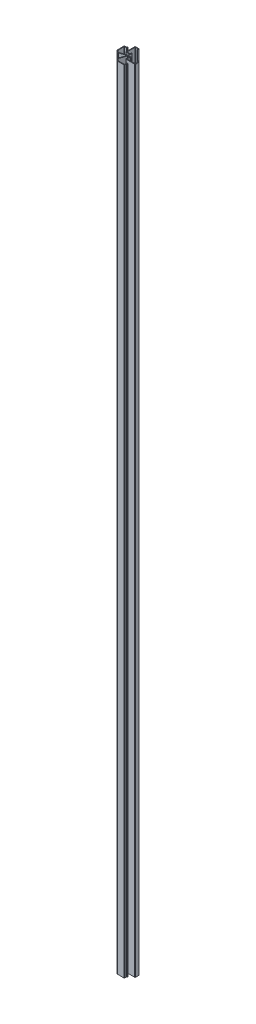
ISO-10303-21;
HEADER;
FILE_DESCRIPTION(('STEP AP214'),'2;1');
FILE_NAME('part.step','',(''),(''),'','','');
FILE_SCHEMA(('AUTOMOTIVE_DESIGN { 1 0 10303 214 1 1 1 1 }'));
ENDSEC;
DATA;
#1=APPLICATION_CONTEXT('core data for automotive mechanical design processes');
#2=APPLICATION_PROTOCOL_DEFINITION('international standard','automotive_design',2000,#1);
#3=PRODUCT_CONTEXT('',#1,'mechanical');
#4=PRODUCT('Part','Part','',(#3));
#5=PRODUCT_RELATED_PRODUCT_CATEGORY('part','',(#4));
#6=PRODUCT_DEFINITION_FORMATION('','',#4);
#7=PRODUCT_DEFINITION_CONTEXT('part definition',#1,'design');
#8=PRODUCT_DEFINITION('design','',#6,#7);
#9=PRODUCT_DEFINITION_SHAPE('','',#8);
#10=(LENGTH_UNIT() NAMED_UNIT(*) SI_UNIT(.MILLI.,.METRE.));
#11=(NAMED_UNIT(*) PLANE_ANGLE_UNIT() SI_UNIT($,.RADIAN.));
#12=(NAMED_UNIT(*) SI_UNIT($,.STERADIAN.) SOLID_ANGLE_UNIT());
#13=UNCERTAINTY_MEASURE_WITH_UNIT(LENGTH_MEASURE(1.E-05),#10,'distance_accuracy_value','');
#14=(GEOMETRIC_REPRESENTATION_CONTEXT(3) GLOBAL_UNCERTAINTY_ASSIGNED_CONTEXT((#13)) GLOBAL_UNIT_ASSIGNED_CONTEXT((#10,
#11,#12)) REPRESENTATION_CONTEXT('',''));
#15=CARTESIAN_POINT('',(0.,0.,0.));
#16=DIRECTION('',(0.,0.,1.));
#17=DIRECTION('',(1.,0.,0.));
#18=AXIS2_PLACEMENT_3D('',#15,#16,#17);
#19=CARTESIAN_POINT('',(-0.299999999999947,1100.,-5.25));
#20=DIRECTION('',(0.,1.,0.));
#21=DIRECTION('',(0.,0.,1.));
#22=AXIS2_PLACEMENT_3D('',#19,#20,#21);
#23=PLANE('',#22);
#24=DIRECTION('',(0.,0.,-1.));
#25=VECTOR('',#24,1.);
#26=CARTESIAN_POINT('',(0.,1100.,0.));
#27=LINE('',#26,#25);
#28=CARTESIAN_POINT('',(0.,1100.,0.));
#29=VERTEX_POINT('',#28);
#30=CARTESIAN_POINT('',(0.,1100.,-5.25));
#31=VERTEX_POINT('',#30);
#32=EDGE_CURVE('E666',#29,#31,#27,.T.);
#33=ORIENTED_EDGE('',*,*,#32,.T.);
#34=CARTESIAN_POINT('',(-0.299999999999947,1100.,-5.25));
#35=DIRECTION('',(0.,1.,0.));
#36=DIRECTION('',(0.,0.,1.));
#37=AXIS2_PLACEMENT_3D('',#34,#35,#36);
#38=CIRCLE('',#37,0.3);
#39=CARTESIAN_POINT('',(-0.299999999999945,1100.,-5.55));
#40=VERTEX_POINT('',#39);
#41=EDGE_CURVE('E669',#31,#40,#38,.T.);
#42=ORIENTED_EDGE('',*,*,#41,.T.);
#43=DIRECTION('',(-1.,0.,0.));
#44=VECTOR('',#43,1.);
#45=CARTESIAN_POINT('',(-0.299999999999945,1100.,-5.55));
#46=LINE('',#45,#44);
#47=CARTESIAN_POINT('',(-0.549999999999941,1100.,-5.55000000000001));
#48=VERTEX_POINT('',#47);
#49=EDGE_CURVE('E672',#40,#48,#46,.T.);
#50=ORIENTED_EDGE('',*,*,#49,.T.);
#51=CARTESIAN_POINT('',(-0.549999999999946,1100.,-5.25000000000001));
#52=DIRECTION('',(0.,1.,0.));
#53=DIRECTION('',(0.,0.,1.));
#54=AXIS2_PLACEMENT_3D('',#51,#52,#53);
#55=CIRCLE('',#54,0.3);
#56=CARTESIAN_POINT('',(-0.849999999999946,1100.,-5.25000000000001));
#57=VERTEX_POINT('',#56);
#58=EDGE_CURVE('E674',#48,#57,#55,.T.);
#59=ORIENTED_EDGE('',*,*,#58,.T.);
#60=DIRECTION('',(0.,0.,1.));
#61=VECTOR('',#60,1.);
#62=CARTESIAN_POINT('',(-0.849999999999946,1100.,-5.25000000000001));
#63=LINE('',#62,#61);
#64=CARTESIAN_POINT('',(-0.849999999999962,1100.,-3.75000000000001));
#65=VERTEX_POINT('',#64);
#66=EDGE_CURVE('E676',#57,#65,#63,.T.);
#67=ORIENTED_EDGE('',*,*,#66,.T.);
#68=CARTESIAN_POINT('',(-1.34999999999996,1100.,-3.75000000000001));
#69=DIRECTION('',(0.,-1.,0.));
#70=DIRECTION('',(0.,0.,-1.));
#71=AXIS2_PLACEMENT_3D('',#68,#69,#70);
#72=CIRCLE('',#71,0.5);
#73=CARTESIAN_POINT('',(-1.34999999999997,1100.,-3.25000000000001));
#74=VERTEX_POINT('',#73);
#75=EDGE_CURVE('E678',#65,#74,#72,.T.);
#76=ORIENTED_EDGE('',*,*,#75,.T.);
#77=DIRECTION('',(-1.,0.,0.));
#78=VECTOR('',#77,1.);
#79=CARTESIAN_POINT('',(-1.34999999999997,1100.,-3.25000000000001));
#80=LINE('',#79,#78);
#81=CARTESIAN_POINT('',(-4.74999999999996,1100.,-3.25000000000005));
#82=VERTEX_POINT('',#81);
#83=EDGE_CURVE('E680',#74,#82,#80,.T.);
#84=ORIENTED_EDGE('',*,*,#83,.T.);
#85=CARTESIAN_POINT('',(-4.74999999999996,1100.,-3.75000000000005));
#86=DIRECTION('',(0.,-1.,0.));
#87=DIRECTION('',(0.,0.,1.));
#88=AXIS2_PLACEMENT_3D('',#85,#86,#87);
#89=CIRCLE('',#88,0.5);
#90=CARTESIAN_POINT('',(-5.24999999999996,1100.,-3.75000000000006));
#91=VERTEX_POINT('',#90);
#92=EDGE_CURVE('E682',#82,#91,#89,.T.);
#93=ORIENTED_EDGE('',*,*,#92,.T.);
#94=DIRECTION('',(0.,0.,-1.));
#95=VECTOR('',#94,1.);
#96=CARTESIAN_POINT('',(-5.24999999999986,1100.,-14.15));
#97=LINE('',#96,#95);
#98=CARTESIAN_POINT('',(-5.24999999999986,1100.,-14.15));
#99=VERTEX_POINT('',#98);
#100=EDGE_CURVE('E684',#91,#99,#97,.T.);
#101=ORIENTED_EDGE('',*,*,#100,.T.);
#102=CARTESIAN_POINT('',(-4.74999999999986,1100.,-14.15));
#103=DIRECTION('',(0.,-1.,0.));
#104=DIRECTION('',(0.,0.,1.));
#105=AXIS2_PLACEMENT_3D('',#102,#103,#104);
#106=CIRCLE('',#105,0.5);
#107=CARTESIAN_POINT('',(-4.74999999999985,1100.,-14.65));
#108=VERTEX_POINT('',#107);
#109=EDGE_CURVE('E686',#99,#108,#106,.T.);
#110=ORIENTED_EDGE('',*,*,#109,.T.);
#111=DIRECTION('',(1.,0.,0.));
#112=VECTOR('',#111,1.);
#113=CARTESIAN_POINT('',(-1.34999999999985,1100.,-14.65));
#114=LINE('',#113,#112);
#115=CARTESIAN_POINT('',(-1.34999999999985,1100.,-14.65));
#116=VERTEX_POINT('',#115);
#117=EDGE_CURVE('E688',#108,#116,#114,.T.);
#118=ORIENTED_EDGE('',*,*,#117,.T.);
#119=CARTESIAN_POINT('',(-1.34999999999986,1100.,-14.15));
#120=DIRECTION('',(0.,-1.,0.));
#121=DIRECTION('',(0.,0.,1.));
#122=AXIS2_PLACEMENT_3D('',#119,#120,#121);
#123=CIRCLE('',#122,0.5);
#124=CARTESIAN_POINT('',(-0.849999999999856,1100.,-14.15));
#125=VERTEX_POINT('',#124);
#126=EDGE_CURVE('E690',#116,#125,#123,.T.);
#127=ORIENTED_EDGE('',*,*,#126,.T.);
#128=DIRECTION('',(0.,0.,1.));
#129=VECTOR('',#128,1.);
#130=CARTESIAN_POINT('',(-0.849999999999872,1100.,-12.65));
#131=LINE('',#130,#129);
#132=CARTESIAN_POINT('',(-0.849999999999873,1100.,-12.65));
#133=VERTEX_POINT('',#132);
#134=EDGE_CURVE('E692',#125,#133,#131,.T.);
#135=ORIENTED_EDGE('',*,*,#134,.T.);
#136=CARTESIAN_POINT('',(-0.54999999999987,1100.,-12.65));
#137=DIRECTION('',(0.,1.,0.));
#138=DIRECTION('',(0.,0.,-1.));
#139=AXIS2_PLACEMENT_3D('',#136,#137,#138);
#140=CIRCLE('',#139,0.300000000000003);
#141=CARTESIAN_POINT('',(-0.549999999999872,1100.,-12.35));
#142=VERTEX_POINT('',#141);
#143=EDGE_CURVE('E694',#133,#142,#140,.T.);
#144=ORIENTED_EDGE('',*,*,#143,.T.);
#145=DIRECTION('',(1.,0.,0.));
#146=VECTOR('',#145,1.);
#147=CARTESIAN_POINT('',(-0.299999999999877,1100.,-12.35));
#148=LINE('',#147,#146);
#149=CARTESIAN_POINT('',(-0.299999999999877,1100.,-12.35));
#150=VERTEX_POINT('',#149);
#151=EDGE_CURVE('E696',#142,#150,#148,.T.);
#152=ORIENTED_EDGE('',*,*,#151,.T.);
#153=CARTESIAN_POINT('',(-0.29999999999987,1100.,-12.65));
#154=DIRECTION('',(0.,1.,0.));
#155=DIRECTION('',(0.,0.,-1.));
#156=AXIS2_PLACEMENT_3D('',#153,#154,#155);
#157=CIRCLE('',#156,0.299999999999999);
#158=CARTESIAN_POINT('',(1.28369537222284E-13,1100.,-12.65));
#159=VERTEX_POINT('',#158);
#160=EDGE_CURVE('E698',#150,#159,#157,.T.);
#161=ORIENTED_EDGE('',*,*,#160,.T.);
#162=DIRECTION('',(0.,0.,-1.));
#163=VECTOR('',#162,1.);
#164=CARTESIAN_POINT('',(1.28369537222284E-13,1100.,-12.65));
#165=LINE('',#164,#163);
#166=CARTESIAN_POINT('',(1.50920942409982E-13,1100.,-14.7));
#167=VERTEX_POINT('',#166);
#168=EDGE_CURVE('E700',#159,#167,#165,.T.);
#169=ORIENTED_EDGE('',*,*,#168,.T.);
#170=CARTESIAN_POINT('',(-0.799999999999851,1100.,-14.7));
#171=DIRECTION('',(0.,1.,0.));
#172=DIRECTION('',(0.,0.,-1.));
#173=AXIS2_PLACEMENT_3D('',#170,#171,#172);
#174=CIRCLE('',#173,0.800000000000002);
#175=CARTESIAN_POINT('',(-0.799999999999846,1100.,-15.5));
#176=VERTEX_POINT('',#175);
#177=EDGE_CURVE('E702',#167,#176,#174,.T.);
#178=ORIENTED_EDGE('',*,*,#177,.T.);
#179=DIRECTION('',(-1.,0.,0.));
#180=VECTOR('',#179,1.);
#181=CARTESIAN_POINT('',(-0.799999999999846,1100.,-15.5));
#182=LINE('',#181,#180);
#183=CARTESIAN_POINT('',(-5.29999999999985,1100.,-15.5000000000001));
#184=VERTEX_POINT('',#183);
#185=EDGE_CURVE('E704',#176,#184,#182,.T.);
#186=ORIENTED_EDGE('',*,*,#185,.T.);
#187=CARTESIAN_POINT('',(-5.29999999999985,1100.,-14.7000000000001));
#188=DIRECTION('',(0.,1.,0.));
#189=DIRECTION('',(0.,0.,-1.));
#190=AXIS2_PLACEMENT_3D('',#187,#188,#189);
#191=CIRCLE('',#190,0.799999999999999);
#192=CARTESIAN_POINT('',(-6.09999999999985,1100.,-14.7000000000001));
#193=VERTEX_POINT('',#192);
#194=EDGE_CURVE('E706',#184,#193,#191,.T.);
#195=ORIENTED_EDGE('',*,*,#194,.T.);
#196=DIRECTION('',(0.,0.,1.));
#197=VECTOR('',#196,1.);
#198=CARTESIAN_POINT('',(-6.09999999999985,1100.,-14.7000000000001));
#199=LINE('',#198,#197);
#200=CARTESIAN_POINT('',(-6.09999999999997,1100.,-3.19700000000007));
#201=VERTEX_POINT('',#200);
#202=EDGE_CURVE('E708',#193,#201,#199,.T.);
#203=ORIENTED_EDGE('',*,*,#202,.T.);
#204=CARTESIAN_POINT('',(-5.29999999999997,1100.,-3.19700000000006));
#205=DIRECTION('',(0.,1.,0.));
#206=DIRECTION('',(0.,0.,-1.));
#207=AXIS2_PLACEMENT_3D('',#204,#205,#206);
#208=CIRCLE('',#207,0.8);
#209=CARTESIAN_POINT('',(-5.29999999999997,1100.,-2.39700000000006));
#210=VERTEX_POINT('',#209);
#211=EDGE_CURVE('E710',#201,#210,#208,.T.);
#212=ORIENTED_EDGE('',*,*,#211,.T.);
#213=DIRECTION('',(1.,0.,0.));
#214=VECTOR('',#213,1.);
#215=CARTESIAN_POINT('',(-5.29999999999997,1100.,-2.39700000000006));
#216=LINE('',#215,#214);
#217=CARTESIAN_POINT('',(-1.34999999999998,1100.,-2.39700000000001));
#218=VERTEX_POINT('',#217);
#219=EDGE_CURVE('E712',#210,#218,#216,.T.);
#220=ORIENTED_EDGE('',*,*,#219,.T.);
#221=CARTESIAN_POINT('',(-1.34999999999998,1100.,-1.89700000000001));
#222=DIRECTION('',(0.,-1.,0.));
#223=DIRECTION('',(0.,0.,1.));
#224=AXIS2_PLACEMENT_3D('',#221,#222,#223);
#225=CIRCLE('',#224,0.5);
#226=CARTESIAN_POINT('',(-0.849999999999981,1100.,-1.89700000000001));
#227=VERTEX_POINT('',#226);
#228=EDGE_CURVE('E714',#218,#227,#225,.T.);
#229=ORIENTED_EDGE('',*,*,#228,.T.);
#230=DIRECTION('',(0.,0.,1.));
#231=VECTOR('',#230,1.);
#232=CARTESIAN_POINT('',(-0.849999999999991,1100.,-0.534636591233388));
#233=LINE('',#232,#231);
#234=CARTESIAN_POINT('',(-0.849999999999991,1100.,-0.534636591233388));
#235=VERTEX_POINT('',#234);
#236=EDGE_CURVE('E716',#227,#235,#233,.T.);
#237=ORIENTED_EDGE('',*,*,#236,.T.);
#238=CARTESIAN_POINT('',(-1.34999999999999,1100.,-0.534636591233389));
#239=DIRECTION('',(0.,-1.,0.));
#240=DIRECTION('',(0.,0.,-1.));
#241=AXIS2_PLACEMENT_3D('',#238,#239,#240);
#242=CIRCLE('',#241,0.5);
#243=CARTESIAN_POINT('',(-1.17898992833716,1100.,-0.0647902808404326));
#244=VERTEX_POINT('',#243);
#245=EDGE_CURVE('E718',#235,#244,#242,.T.);
#246=ORIENTED_EDGE('',*,*,#245,.T.);
#247=DIRECTION('',(-0.93969262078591,0.,0.342020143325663));
#248=VECTOR('',#247,1.);
#249=CARTESIAN_POINT('',(-10.9485933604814,1100.,3.49105456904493));
#250=LINE('',#249,#248);
#251=CARTESIAN_POINT('',(-10.9485933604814,1100.,3.49105456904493));
#252=VERTEX_POINT('',#251);
#253=EDGE_CURVE('E720',#244,#252,#250,.T.);
#254=ORIENTED_EDGE('',*,*,#253,.T.);
#255=CARTESIAN_POINT('',(-11.1196034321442,1100.,3.02120825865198));
#256=DIRECTION('',(0.,-1.,0.));
#257=DIRECTION('',(0.,0.,1.));
#258=AXIS2_PLACEMENT_3D('',#255,#256,#257);
#259=CIRCLE('',#258,0.499999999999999);
#260=CARTESIAN_POINT('',(-11.4731568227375,1100.,3.37476164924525));
#261=VERTEX_POINT('',#260);
#262=EDGE_CURVE('E722',#252,#261,#259,.T.);
#263=ORIENTED_EDGE('',*,*,#262,.T.);
#264=DIRECTION('',(-0.707106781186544,0.,-0.707106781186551));
#265=VECTOR('',#264,1.);
#266=CARTESIAN_POINT('',(-11.4731568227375,1100.,3.37476164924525));
#267=LINE('',#266,#265);
#268=CARTESIAN_POINT('',(-13.4035533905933,1100.,1.44436508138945));
#269=VERTEX_POINT('',#268);
#270=EDGE_CURVE('E724',#261,#269,#267,.T.);
#271=ORIENTED_EDGE('',*,*,#270,.T.);
#272=CARTESIAN_POINT('',(-13.05,1100.,1.09081169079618));
#273=DIRECTION('',(0.,-1.,0.));
#274=DIRECTION('',(0.,0.,-1.));
#275=AXIS2_PLACEMENT_3D('',#272,#273,#274);
#276=CIRCLE('',#275,0.500000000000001);
#277=CARTESIAN_POINT('',(-13.55,1100.,1.09081169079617));
#278=VERTEX_POINT('',#277);
#279=EDGE_CURVE('E726',#269,#278,#276,.T.);
#280=ORIENTED_EDGE('',*,*,#279,.T.);
#281=DIRECTION('',(0.,0.,-1.));
#282=VECTOR('',#281,1.);
#283=CARTESIAN_POINT('',(-13.5499999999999,1100.,-7.50000000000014));
#284=LINE('',#283,#282);
#285=CARTESIAN_POINT('',(-13.5499999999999,1100.,-7.50000000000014));
#286=VERTEX_POINT('',#285);
#287=EDGE_CURVE('E728',#278,#286,#284,.T.);
#288=ORIENTED_EDGE('',*,*,#287,.T.);
#289=CARTESIAN_POINT('',(-13.0499999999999,1100.,-7.50000000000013));
#290=DIRECTION('',(0.,-1.,0.));
#291=DIRECTION('',(0.,0.,-1.));
#292=AXIS2_PLACEMENT_3D('',#289,#290,#291);
#293=CIRCLE('',#292,0.500000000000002);
#294=CARTESIAN_POINT('',(-13.0499999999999,1100.,-8.00000000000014));
#295=VERTEX_POINT('',#294);
#296=EDGE_CURVE('E730',#286,#295,#293,.T.);
#297=ORIENTED_EDGE('',*,*,#296,.T.);
#298=DIRECTION('',(1.,0.,0.));
#299=VECTOR('',#298,1.);
#300=CARTESIAN_POINT('',(-13.0499999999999,1100.,-8.00000000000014));
#301=LINE('',#300,#299);
#302=CARTESIAN_POINT('',(-10.8999999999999,1100.,-8.00000000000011));
#303=VERTEX_POINT('',#302);
#304=EDGE_CURVE('E732',#295,#303,#301,.T.);
#305=ORIENTED_EDGE('',*,*,#304,.T.);
#306=CARTESIAN_POINT('',(-10.8999999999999,1100.,-8.80000000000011));
#307=DIRECTION('',(0.,1.,0.));
#308=DIRECTION('',(0.,0.,1.));
#309=AXIS2_PLACEMENT_3D('',#306,#307,#308);
#310=CIRCLE('',#309,0.800000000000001);
#311=CARTESIAN_POINT('',(-10.0999999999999,1100.,-8.80000000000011));
#312=VERTEX_POINT('',#311);
#313=EDGE_CURVE('E734',#303,#312,#310,.T.);
#314=ORIENTED_EDGE('',*,*,#313,.T.);
#315=DIRECTION('',(0.,0.,-1.));
#316=VECTOR('',#315,1.);
#317=CARTESIAN_POINT('',(-10.0999999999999,1100.,-9.7000000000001));
#318=LINE('',#317,#316);
#319=CARTESIAN_POINT('',(-10.0999999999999,1100.,-9.7000000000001));
#320=VERTEX_POINT('',#319);
#321=EDGE_CURVE('E736',#312,#320,#318,.T.);
#322=ORIENTED_EDGE('',*,*,#321,.T.);
#323=CARTESIAN_POINT('',(-10.3999999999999,1100.,-9.70000000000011));
#324=DIRECTION('',(0.,1.,0.));
#325=DIRECTION('',(0.,0.,-1.));
#326=AXIS2_PLACEMENT_3D('',#323,#324,#325);
#327=CIRCLE('',#326,0.299999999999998);
#328=CARTESIAN_POINT('',(-10.3999999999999,1100.,-10.0000000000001));
#329=VERTEX_POINT('',#328);
#330=EDGE_CURVE('E738',#320,#329,#327,.T.);
#331=ORIENTED_EDGE('',*,*,#330,.T.);
#332=DIRECTION('',(-1.,0.,0.));
#333=VECTOR('',#332,1.);
#334=CARTESIAN_POINT('',(-10.3999999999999,1100.,-10.0000000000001));
#335=LINE('',#334,#333);
#336=CARTESIAN_POINT('',(-10.6499999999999,1100.,-10.0000000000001));
#337=VERTEX_POINT('',#336);
#338=EDGE_CURVE('E740',#329,#337,#335,.T.);
#339=ORIENTED_EDGE('',*,*,#338,.T.);
#340=CARTESIAN_POINT('',(-10.6499999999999,1100.,-9.70000000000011));
#341=DIRECTION('',(0.,1.,0.));
#342=DIRECTION('',(0.,0.,-1.));
#343=AXIS2_PLACEMENT_3D('',#340,#341,#342);
#344=CIRCLE('',#343,0.3);
#345=CARTESIAN_POINT('',(-10.9499999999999,1100.,-9.70000000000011));
#346=VERTEX_POINT('',#345);
#347=EDGE_CURVE('E742',#337,#346,#344,.T.);
#348=ORIENTED_EDGE('',*,*,#347,.T.);
#349=DIRECTION('',(0.,0.,1.));
#350=VECTOR('',#349,1.);
#351=CARTESIAN_POINT('',(-10.9499999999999,1100.,-9.70000000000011));
#352=LINE('',#351,#350);
#353=CARTESIAN_POINT('',(-10.9499999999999,1100.,-9.35000000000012));
#354=VERTEX_POINT('',#353);
#355=EDGE_CURVE('E744',#346,#354,#352,.T.);
#356=ORIENTED_EDGE('',*,*,#355,.T.);
#357=CARTESIAN_POINT('',(-11.4499999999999,1100.,-9.35000000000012));
#358=DIRECTION('',(0.,-1.,0.));
#359=DIRECTION('',(0.,0.,1.));
#360=AXIS2_PLACEMENT_3D('',#357,#358,#359);
#361=CIRCLE('',#360,0.500000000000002);
#362=CARTESIAN_POINT('',(-11.4499999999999,1100.,-8.85000000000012));
#363=VERTEX_POINT('',#362);
#364=EDGE_CURVE('E746',#354,#363,#361,.T.);
#365=ORIENTED_EDGE('',*,*,#364,.T.);
#366=DIRECTION('',(-1.,0.,0.));
#367=VECTOR('',#366,1.);
#368=CARTESIAN_POINT('',(-13.5999999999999,1100.,-8.85000000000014));
#369=LINE('',#368,#367);
#370=CARTESIAN_POINT('',(-13.5999999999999,1100.,-8.85000000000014));
#371=VERTEX_POINT('',#370);
#372=EDGE_CURVE('E748',#363,#371,#369,.T.);
#373=ORIENTED_EDGE('',*,*,#372,.T.);
#374=CARTESIAN_POINT('',(-13.5999999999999,1100.,-8.05000000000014));
#375=DIRECTION('',(0.,1.,0.));
#376=DIRECTION('',(0.,0.,-1.));
#377=AXIS2_PLACEMENT_3D('',#374,#375,#376);
#378=CIRCLE('',#377,0.8);
#379=CARTESIAN_POINT('',(-14.3999999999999,1100.,-8.05000000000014));
#380=VERTEX_POINT('',#379);
#381=EDGE_CURVE('E750',#371,#380,#378,.T.);
#382=ORIENTED_EDGE('',*,*,#381,.T.);
#383=DIRECTION('',(0.,0.,1.));
#384=VECTOR('',#383,1.);
#385=CARTESIAN_POINT('',(-14.3999999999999,1100.,-8.05000000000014));
#386=LINE('',#385,#384);
#387=CARTESIAN_POINT('',(-14.4,1100.,0.407359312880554));
#388=VERTEX_POINT('',#387);
#389=EDGE_CURVE('E752',#380,#388,#386,.T.);
#390=ORIENTED_EDGE('',*,*,#389,.T.);
#391=CARTESIAN_POINT('',(-11.4,1100.,0.407359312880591));
#392=DIRECTION('',(0.,1.,0.));
#393=DIRECTION('',(0.,0.,-1.));
#394=AXIS2_PLACEMENT_3D('',#391,#392,#393);
#395=CIRCLE('',#394,3.);
#396=CARTESIAN_POINT('',(-13.5213203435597,1100.,2.52867965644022));
#397=VERTEX_POINT('',#396);
#398=EDGE_CURVE('E754',#388,#397,#395,.T.);
#399=ORIENTED_EDGE('',*,*,#398,.T.);
#400=DIRECTION('',(0.707106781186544,0.,0.707106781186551));
#401=VECTOR('',#400,1.);
#402=CARTESIAN_POINT('',(-13.5213203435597,1100.,2.52867965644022));
#403=LINE('',#402,#401);
#404=CARTESIAN_POINT('',(-2.52867965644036,1100.,13.5213203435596));
#405=VERTEX_POINT('',#404);
#406=EDGE_CURVE('E756',#397,#405,#403,.T.);
#407=ORIENTED_EDGE('',*,*,#406,.T.);
#408=CARTESIAN_POINT('',(-0.407359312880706,1100.,11.4));
#409=DIRECTION('',(0.,1.,0.));
#410=DIRECTION('',(0.,0.,1.));
#411=AXIS2_PLACEMENT_3D('',#408,#409,#410);
#412=CIRCLE('',#411,3.);
#413=CARTESIAN_POINT('',(-0.407359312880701,1100.,14.4));
#414=VERTEX_POINT('',#413);
#415=EDGE_CURVE('E758',#405,#414,#412,.T.);
#416=ORIENTED_EDGE('',*,*,#415,.T.);
#417=DIRECTION('',(1.,0.,0.));
#418=VECTOR('',#417,1.);
#419=CARTESIAN_POINT('',(8.05,1100.,14.4));
#420=LINE('',#419,#418);
#421=CARTESIAN_POINT('',(8.05,1100.,14.4));
#422=VERTEX_POINT('',#421);
#423=EDGE_CURVE('E760',#414,#422,#420,.T.);
#424=ORIENTED_EDGE('',*,*,#423,.T.);
#425=CARTESIAN_POINT('',(8.05,1100.,13.6));
#426=DIRECTION('',(0.,1.,0.));
#427=DIRECTION('',(0.,0.,1.));
#428=AXIS2_PLACEMENT_3D('',#425,#426,#427);
#429=CIRCLE('',#428,0.8);
#430=CARTESIAN_POINT('',(8.85,1100.,13.6));
#431=VERTEX_POINT('',#430);
#432=EDGE_CURVE('E762',#422,#431,#429,.T.);
#433=ORIENTED_EDGE('',*,*,#432,.T.);
#434=DIRECTION('',(0.,0.,-1.));
#435=VECTOR('',#434,1.);
#436=CARTESIAN_POINT('',(8.85,1100.,13.6));
#437=LINE('',#436,#435);
#438=CARTESIAN_POINT('',(8.85,1100.,11.45));
#439=VERTEX_POINT('',#438);
#440=EDGE_CURVE('E764',#431,#439,#437,.T.);
#441=ORIENTED_EDGE('',*,*,#440,.T.);
#442=CARTESIAN_POINT('',(9.35,1100.,11.45));
#443=DIRECTION('',(0.,-1.,0.));
#444=DIRECTION('',(0.,0.,-1.));
#445=AXIS2_PLACEMENT_3D('',#442,#443,#444);
#446=CIRCLE('',#445,0.5);
#447=CARTESIAN_POINT('',(9.35,1100.,10.95));
#448=VERTEX_POINT('',#447);
#449=EDGE_CURVE('E766',#439,#448,#446,.T.);
#450=ORIENTED_EDGE('',*,*,#449,.T.);
#451=DIRECTION('',(1.,0.,0.));
#452=VECTOR('',#451,1.);
#453=CARTESIAN_POINT('',(9.7,1100.,10.95));
#454=LINE('',#453,#452);
#455=CARTESIAN_POINT('',(9.7,1100.,10.95));
#456=VERTEX_POINT('',#455);
#457=EDGE_CURVE('E768',#448,#456,#454,.T.);
#458=ORIENTED_EDGE('',*,*,#457,.T.);
#459=CARTESIAN_POINT('',(9.7,1100.,10.65));
#460=DIRECTION('',(0.,1.,0.));
#461=DIRECTION('',(0.,0.,1.));
#462=AXIS2_PLACEMENT_3D('',#459,#460,#461);
#463=CIRCLE('',#462,0.3);
#464=CARTESIAN_POINT('',(10.,1100.,10.65));
#465=VERTEX_POINT('',#464);
#466=EDGE_CURVE('E770',#456,#465,#463,.T.);
#467=ORIENTED_EDGE('',*,*,#466,.T.);
#468=DIRECTION('',(0.,0.,-1.));
#469=VECTOR('',#468,1.);
#470=CARTESIAN_POINT('',(10.,1100.,10.4));
#471=LINE('',#470,#469);
#472=CARTESIAN_POINT('',(10.,1100.,10.4));
#473=VERTEX_POINT('',#472);
#474=EDGE_CURVE('E772',#465,#473,#471,.T.);
#475=ORIENTED_EDGE('',*,*,#474,.T.);
#476=CARTESIAN_POINT('',(9.7,1100.,10.4));
#477=DIRECTION('',(0.,1.,0.));
#478=DIRECTION('',(0.,0.,1.));
#479=AXIS2_PLACEMENT_3D('',#476,#477,#478);
#480=CIRCLE('',#479,0.3);
#481=CARTESIAN_POINT('',(9.7,1100.,10.1));
#482=VERTEX_POINT('',#481);
#483=EDGE_CURVE('E774',#473,#482,#480,.T.);
#484=ORIENTED_EDGE('',*,*,#483,.T.);
#485=DIRECTION('',(-1.,0.,0.));
#486=VECTOR('',#485,1.);
#487=CARTESIAN_POINT('',(9.7,1100.,10.1));
#488=LINE('',#487,#486);
#489=CARTESIAN_POINT('',(8.8,1100.,10.1));
#490=VERTEX_POINT('',#489);
#491=EDGE_CURVE('E776',#482,#490,#488,.T.);
#492=ORIENTED_EDGE('',*,*,#491,.T.);
#493=CARTESIAN_POINT('',(8.8,1100.,10.9));
#494=DIRECTION('',(0.,1.,0.));
#495=DIRECTION('',(0.,0.,-1.));
#496=AXIS2_PLACEMENT_3D('',#493,#494,#495);
#497=CIRCLE('',#496,0.8);
#498=CARTESIAN_POINT('',(8.,1100.,10.9));
#499=VERTEX_POINT('',#498);
#500=EDGE_CURVE('E778',#490,#499,#497,.T.);
#501=ORIENTED_EDGE('',*,*,#500,.T.);
#502=DIRECTION('',(0.,0.,1.));
#503=VECTOR('',#502,1.);
#504=CARTESIAN_POINT('',(8.,1100.,13.05));
#505=LINE('',#504,#503);
#506=CARTESIAN_POINT('',(8.,1100.,13.05));
#507=VERTEX_POINT('',#506);
#508=EDGE_CURVE('E780',#499,#507,#505,.T.);
#509=ORIENTED_EDGE('',*,*,#508,.T.);
#510=CARTESIAN_POINT('',(7.5,1100.,13.05));
#511=DIRECTION('',(0.,-1.,0.));
#512=DIRECTION('',(0.,0.,1.));
#513=AXIS2_PLACEMENT_3D('',#510,#511,#512);
#514=CIRCLE('',#513,0.5);
#515=CARTESIAN_POINT('',(7.5,1100.,13.55));
#516=VERTEX_POINT('',#515);
#517=EDGE_CURVE('E782',#507,#516,#514,.T.);
#518=ORIENTED_EDGE('',*,*,#517,.T.);
#519=DIRECTION('',(-1.,0.,0.));
#520=VECTOR('',#519,1.);
#521=CARTESIAN_POINT('',(7.5,1100.,13.55));
#522=LINE('',#521,#520);
#523=CARTESIAN_POINT('',(-1.09081169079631,1100.,13.55));
#524=VERTEX_POINT('',#523);
#525=EDGE_CURVE('E784',#516,#524,#522,.T.);
#526=ORIENTED_EDGE('',*,*,#525,.T.);
#527=CARTESIAN_POINT('',(-1.09081169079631,1100.,13.05));
#528=DIRECTION('',(0.,-1.,0.));
#529=DIRECTION('',(0.,0.,1.));
#530=AXIS2_PLACEMENT_3D('',#527,#528,#529);
#531=CIRCLE('',#530,0.500000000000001);
#532=CARTESIAN_POINT('',(-1.44436508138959,1100.,13.4035533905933));
#533=VERTEX_POINT('',#532);
#534=EDGE_CURVE('E786',#524,#533,#531,.T.);
#535=ORIENTED_EDGE('',*,*,#534,.T.);
#536=DIRECTION('',(-0.707106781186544,0.,-0.707106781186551));
#537=VECTOR('',#536,1.);
#538=CARTESIAN_POINT('',(-1.44436508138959,1100.,13.4035533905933));
#539=LINE('',#538,#537);
#540=CARTESIAN_POINT('',(-3.37476164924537,1100.,11.4731568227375));
#541=VERTEX_POINT('',#540);
#542=EDGE_CURVE('E788',#533,#541,#539,.T.);
#543=ORIENTED_EDGE('',*,*,#542,.T.);
#544=CARTESIAN_POINT('',(-3.02120825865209,1100.,11.1196034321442));
#545=DIRECTION('',(0.,-1.,0.));
#546=DIRECTION('',(0.,0.,-1.));
#547=AXIS2_PLACEMENT_3D('',#544,#545,#546);
#548=CIRCLE('',#547,0.500000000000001);
#549=CARTESIAN_POINT('',(-3.49105456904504,1100.,10.9485933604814));
#550=VERTEX_POINT('',#549);
#551=EDGE_CURVE('E790',#541,#550,#548,.T.);
#552=ORIENTED_EDGE('',*,*,#551,.T.);
#553=DIRECTION('',(0.342020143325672,0.,-0.939692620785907));
#554=VECTOR('',#553,1.);
#555=CARTESIAN_POINT('',(-3.49105456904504,1100.,10.9485933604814));
#556=LINE('',#555,#554);
#557=CARTESIAN_POINT('',(0.0647902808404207,1100.,1.17898992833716));
#558=VERTEX_POINT('',#557);
#559=EDGE_CURVE('E792',#550,#558,#556,.T.);
#560=ORIENTED_EDGE('',*,*,#559,.T.);
#561=CARTESIAN_POINT('',(0.534636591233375,1100.,1.35));
#562=DIRECTION('',(0.,-1.,0.));
#563=DIRECTION('',(0.,0.,1.));
#564=AXIS2_PLACEMENT_3D('',#561,#562,#563);
#565=CIRCLE('',#564,0.5);
#566=CARTESIAN_POINT('',(0.534636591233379,1100.,0.849999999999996));
#567=VERTEX_POINT('',#566);
#568=EDGE_CURVE('E794',#558,#567,#565,.T.);
#569=ORIENTED_EDGE('',*,*,#568,.T.);
#570=DIRECTION('',(1.,0.,0.));
#571=VECTOR('',#570,1.);
#572=CARTESIAN_POINT('',(0.534636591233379,1100.,0.849999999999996));
#573=LINE('',#572,#571);
#574=CARTESIAN_POINT('',(1.897,1100.,0.85));
#575=VERTEX_POINT('',#574);
#576=EDGE_CURVE('E796',#567,#575,#573,.T.);
#577=ORIENTED_EDGE('',*,*,#576,.T.);
#578=CARTESIAN_POINT('',(1.897,1100.,1.35));
#579=DIRECTION('',(0.,-1.,0.));
#580=DIRECTION('',(0.,0.,-1.));
#581=AXIS2_PLACEMENT_3D('',#578,#579,#580);
#582=CIRCLE('',#581,0.5);
#583=CARTESIAN_POINT('',(2.397,1100.,1.35));
#584=VERTEX_POINT('',#583);
#585=EDGE_CURVE('E798',#575,#584,#582,.T.);
#586=ORIENTED_EDGE('',*,*,#585,.T.);
#587=DIRECTION('',(0.,0.,1.));
#588=VECTOR('',#587,1.);
#589=CARTESIAN_POINT('',(2.397,1100.,5.3));
#590=LINE('',#589,#588);
#591=CARTESIAN_POINT('',(2.397,1100.,5.29999999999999));
#592=VERTEX_POINT('',#591);
#593=EDGE_CURVE('E800',#584,#592,#590,.T.);
#594=ORIENTED_EDGE('',*,*,#593,.T.);
#595=CARTESIAN_POINT('',(3.197,1100.,5.3));
#596=DIRECTION('',(0.,1.,0.));
#597=DIRECTION('',(0.,0.,1.));
#598=AXIS2_PLACEMENT_3D('',#595,#596,#597);
#599=CIRCLE('',#598,0.8);
#600=CARTESIAN_POINT('',(3.19700000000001,1100.,6.1));
#601=VERTEX_POINT('',#600);
#602=EDGE_CURVE('E802',#592,#601,#599,.T.);
#603=ORIENTED_EDGE('',*,*,#602,.T.);
#604=DIRECTION('',(1.,0.,0.));
#605=VECTOR('',#604,1.);
#606=CARTESIAN_POINT('',(14.7,1100.,6.1));
#607=LINE('',#606,#605);
#608=CARTESIAN_POINT('',(14.7,1100.,6.1));
#609=VERTEX_POINT('',#608);
#610=EDGE_CURVE('E804',#601,#609,#607,.T.);
#611=ORIENTED_EDGE('',*,*,#610,.T.);
#612=CARTESIAN_POINT('',(14.7,1100.,5.3));
#613=DIRECTION('',(0.,1.,0.));
#614=DIRECTION('',(0.,0.,1.));
#615=AXIS2_PLACEMENT_3D('',#612,#613,#614);
#616=CIRCLE('',#615,0.8);
#617=CARTESIAN_POINT('',(15.5,1100.,5.29999999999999));
#618=VERTEX_POINT('',#617);
#619=EDGE_CURVE('E806',#609,#618,#616,.T.);
#620=ORIENTED_EDGE('',*,*,#619,.T.);
#621=DIRECTION('',(0.,0.,-1.));
#622=VECTOR('',#621,1.);
#623=CARTESIAN_POINT('',(15.5,1100.,0.800000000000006));
#624=LINE('',#623,#622);
#625=CARTESIAN_POINT('',(15.5,1100.,0.800000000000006));
#626=VERTEX_POINT('',#625);
#627=EDGE_CURVE('E808',#618,#626,#624,.T.);
#628=ORIENTED_EDGE('',*,*,#627,.T.);
#629=CARTESIAN_POINT('',(14.7,1100.,0.8));
#630=DIRECTION('',(0.,1.,0.));
#631=DIRECTION('',(0.,0.,1.));
#632=AXIS2_PLACEMENT_3D('',#629,#630,#631);
#633=CIRCLE('',#632,0.8);
#634=CARTESIAN_POINT('',(14.7,1100.,0.));
#635=VERTEX_POINT('',#634);
#636=EDGE_CURVE('E810',#626,#635,#633,.T.);
#637=ORIENTED_EDGE('',*,*,#636,.T.);
#638=DIRECTION('',(-1.,0.,0.));
#639=VECTOR('',#638,1.);
#640=CARTESIAN_POINT('',(12.65,1100.,0.));
#641=LINE('',#640,#639);
#642=CARTESIAN_POINT('',(12.65,1100.,0.));
#643=VERTEX_POINT('',#642);
#644=EDGE_CURVE('E812',#635,#643,#641,.T.);
#645=ORIENTED_EDGE('',*,*,#644,.T.);
#646=CARTESIAN_POINT('',(12.65,1100.,0.3));
#647=DIRECTION('',(0.,1.,0.));
#648=DIRECTION('',(0.,0.,1.));
#649=AXIS2_PLACEMENT_3D('',#646,#647,#648);
#650=CIRCLE('',#649,0.3);
#651=CARTESIAN_POINT('',(12.35,1100.,0.300000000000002));
#652=VERTEX_POINT('',#651);
#653=EDGE_CURVE('E814',#643,#652,#650,.T.);
#654=ORIENTED_EDGE('',*,*,#653,.T.);
#655=DIRECTION('',(0.,0.,1.));
#656=VECTOR('',#655,1.);
#657=CARTESIAN_POINT('',(12.35,1100.,0.300000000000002));
#658=LINE('',#657,#656);
#659=CARTESIAN_POINT('',(12.35,1100.,0.549999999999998));
#660=VERTEX_POINT('',#659);
#661=EDGE_CURVE('E816',#652,#660,#658,.T.);
#662=ORIENTED_EDGE('',*,*,#661,.T.);
#663=CARTESIAN_POINT('',(12.65,1100.,0.55));
#664=DIRECTION('',(0.,1.,0.));
#665=DIRECTION('',(0.,0.,1.));
#666=AXIS2_PLACEMENT_3D('',#663,#664,#665);
#667=CIRCLE('',#666,0.3);
#668=CARTESIAN_POINT('',(12.65,1100.,0.85));
#669=VERTEX_POINT('',#668);
#670=EDGE_CURVE('E818',#660,#669,#667,.T.);
#671=ORIENTED_EDGE('',*,*,#670,.T.);
#672=DIRECTION('',(1.,0.,0.));
#673=VECTOR('',#672,1.);
#674=CARTESIAN_POINT('',(12.65,1100.,0.85));
#675=LINE('',#674,#673);
#676=CARTESIAN_POINT('',(14.15,1100.,0.85));
#677=VERTEX_POINT('',#676);
#678=EDGE_CURVE('E820',#669,#677,#675,.T.);
#679=ORIENTED_EDGE('',*,*,#678,.T.);
#680=CARTESIAN_POINT('',(14.15,1100.,1.35));
#681=DIRECTION('',(0.,-1.,0.));
#682=DIRECTION('',(0.,0.,-1.));
#683=AXIS2_PLACEMENT_3D('',#680,#681,#682);
#684=CIRCLE('',#683,0.5);
#685=CARTESIAN_POINT('',(14.65,1100.,1.35));
#686=VERTEX_POINT('',#685);
#687=EDGE_CURVE('E822',#677,#686,#684,.T.);
#688=ORIENTED_EDGE('',*,*,#687,.T.);
#689=DIRECTION('',(0.,0.,1.));
#690=VECTOR('',#689,1.);
#691=CARTESIAN_POINT('',(14.65,1100.,1.35));
#692=LINE('',#691,#690);
#693=CARTESIAN_POINT('',(14.65,1100.,4.75));
#694=VERTEX_POINT('',#693);
#695=EDGE_CURVE('E824',#686,#694,#692,.T.);
#696=ORIENTED_EDGE('',*,*,#695,.T.);
#697=CARTESIAN_POINT('',(14.15,1100.,4.75));
#698=DIRECTION('',(0.,-1.,0.));
#699=DIRECTION('',(0.,0.,-1.));
#700=AXIS2_PLACEMENT_3D('',#697,#698,#699);
#701=CIRCLE('',#700,0.5);
#702=CARTESIAN_POINT('',(14.15,1100.,5.25));
#703=VERTEX_POINT('',#702);
#704=EDGE_CURVE('E826',#694,#703,#701,.T.);
#705=ORIENTED_EDGE('',*,*,#704,.T.);
#706=DIRECTION('',(-1.,0.,0.));
#707=VECTOR('',#706,1.);
#708=CARTESIAN_POINT('',(14.15,1100.,5.25));
#709=LINE('',#708,#707);
#710=CARTESIAN_POINT('',(3.75,1100.,5.25));
#711=VERTEX_POINT('',#710);
#712=EDGE_CURVE('E828',#703,#711,#709,.T.);
#713=ORIENTED_EDGE('',*,*,#712,.T.);
#714=CARTESIAN_POINT('',(3.75,1100.,4.75));
#715=DIRECTION('',(0.,-1.,0.));
#716=DIRECTION('',(0.,0.,-1.));
#717=AXIS2_PLACEMENT_3D('',#714,#715,#716);
#718=CIRCLE('',#717,0.5);
#719=CARTESIAN_POINT('',(3.25,1100.,4.75));
#720=VERTEX_POINT('',#719);
#721=EDGE_CURVE('E830',#711,#720,#718,.T.);
#722=ORIENTED_EDGE('',*,*,#721,.T.);
#723=DIRECTION('',(0.,0.,-1.));
#724=VECTOR('',#723,1.);
#725=CARTESIAN_POINT('',(3.25,1100.,1.35));
#726=LINE('',#725,#724);
#727=CARTESIAN_POINT('',(3.25,1100.,1.35));
#728=VERTEX_POINT('',#727);
#729=EDGE_CURVE('E832',#720,#728,#726,.T.);
#730=ORIENTED_EDGE('',*,*,#729,.T.);
#731=CARTESIAN_POINT('',(3.75,1100.,1.35));
#732=DIRECTION('',(0.,-1.,0.));
#733=DIRECTION('',(0.,0.,1.));
#734=AXIS2_PLACEMENT_3D('',#731,#732,#733);
#735=CIRCLE('',#734,0.5);
#736=CARTESIAN_POINT('',(3.75,1100.,0.85));
#737=VERTEX_POINT('',#736);
#738=EDGE_CURVE('E834',#728,#737,#735,.T.);
#739=ORIENTED_EDGE('',*,*,#738,.T.);
#740=DIRECTION('',(1.,0.,0.));
#741=VECTOR('',#740,1.);
#742=CARTESIAN_POINT('',(5.25,1100.,0.85));
#743=LINE('',#742,#741);
#744=CARTESIAN_POINT('',(5.25,1100.,0.85));
#745=VERTEX_POINT('',#744);
#746=EDGE_CURVE('E836',#737,#745,#743,.T.);
#747=ORIENTED_EDGE('',*,*,#746,.T.);
#748=CARTESIAN_POINT('',(5.25,1100.,0.55));
#749=DIRECTION('',(0.,1.,0.));
#750=DIRECTION('',(0.,0.,-1.));
#751=AXIS2_PLACEMENT_3D('',#748,#749,#750);
#752=CIRCLE('',#751,0.3);
#753=CARTESIAN_POINT('',(5.55,1100.,0.549999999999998));
#754=VERTEX_POINT('',#753);
#755=EDGE_CURVE('E838',#745,#754,#752,.T.);
#756=ORIENTED_EDGE('',*,*,#755,.T.);
#757=DIRECTION('',(0.,0.,-1.));
#758=VECTOR('',#757,1.);
#759=CARTESIAN_POINT('',(5.55,1100.,0.299999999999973));
#760=LINE('',#759,#758);
#761=CARTESIAN_POINT('',(5.55000000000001,1100.,0.299999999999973));
#762=VERTEX_POINT('',#761);
#763=EDGE_CURVE('E840',#754,#762,#760,.T.);
#764=ORIENTED_EDGE('',*,*,#763,.T.);
#765=CARTESIAN_POINT('',(5.25,1100.,0.3));
#766=DIRECTION('',(0.,1.,0.));
#767=DIRECTION('',(0.,0.,-1.));
#768=AXIS2_PLACEMENT_3D('',#765,#766,#767);
#769=CIRCLE('',#768,0.300000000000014);
#770=CARTESIAN_POINT('',(5.25,1100.,0.));
#771=VERTEX_POINT('',#770);
#772=EDGE_CURVE('E842',#762,#771,#769,.T.);
#773=ORIENTED_EDGE('',*,*,#772,.T.);
#774=DIRECTION('',(-1.,0.,0.));
#775=VECTOR('',#774,1.);
#776=CARTESIAN_POINT('',(0.,1100.,0.));
#777=LINE('',#776,#775);
#778=EDGE_CURVE('E844',#771,#29,#777,.T.);
#779=ORIENTED_EDGE('',*,*,#778,.T.);
#780=EDGE_LOOP('',(#33,#42,#50,#59,#67,#76,#84,#93,#101,#110,#118,#127,#135,#144,#152,#161,#169,
#178,#186,#195,#203,#212,#220,#229,#237,#246,#254,#263,#271,#280,#288,#297,#305,#314,#322,#331,
#339,#348,#356,#365,#373,#382,#390,#399,#407,#416,#424,#433,#441,#450,#458,#467,#475,#484,#492,
#501,#509,#518,#526,#535,#543,#552,#560,#569,#577,#586,#594,#603,#611,#620,#628,#637,#645,#654,
#662,#671,#679,#688,#696,#705,#713,#722,#730,#739,#747,#756,#764,#773,#779));
#781=FACE_BOUND('',#780,.T.);
#782=DIRECTION('',(0.342020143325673,0.,-0.939692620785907));
#783=VECTOR('',#782,1.);
#784=CARTESIAN_POINT('',(-3.99474306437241,1100.,9.84723238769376));
#785=LINE('',#784,#783);
#786=CARTESIAN_POINT('',(-3.99474306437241,1100.,9.84723238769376));
#787=VERTEX_POINT('',#786);
#788=CARTESIAN_POINT('',(-1.01236808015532,1100.,1.6532244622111));
#789=VERTEX_POINT('',#788);
#790=EDGE_CURVE('E628',#787,#789,#785,.T.);
#791=ORIENTED_EDGE('',*,*,#790,.F.);
#792=CARTESIAN_POINT('',(-4.46458937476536,1100.,9.67622231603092));
#793=DIRECTION('',(0.,1.,0.));
#794=DIRECTION('',(0.,0.,1.));
#795=AXIS2_PLACEMENT_3D('',#792,#793,#794);
#796=CIRCLE('',#795,0.500000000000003);
#797=CARTESIAN_POINT('',(-4.81814276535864,1100.,10.0297757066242));
#798=VERTEX_POINT('',#797);
#799=EDGE_CURVE('E618',#798,#787,#796,.T.);
#800=ORIENTED_EDGE('',*,*,#799,.F.);
#801=DIRECTION('',(0.707106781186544,0.,0.707106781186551));
#802=VECTOR('',#801,1.);
#803=CARTESIAN_POINT('',(-7.42395923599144,1100.,7.42395923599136));
#804=LINE('',#803,#802);
#805=CARTESIAN_POINT('',(-10.0297757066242,1100.,4.81814276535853));
#806=VERTEX_POINT('',#805);
#807=EDGE_CURVE('E648',#806,#798,#804,.T.);
#808=ORIENTED_EDGE('',*,*,#807,.F.);
#809=CARTESIAN_POINT('',(-9.67622231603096,1100.,4.46458937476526));
#810=DIRECTION('',(0.,1.,0.));
#811=DIRECTION('',(0.,0.,-1.));
#812=AXIS2_PLACEMENT_3D('',#809,#810,#811);
#813=CIRCLE('',#812,0.500000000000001);
#814=CARTESIAN_POINT('',(-9.8472323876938,1100.,3.99474306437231));
#815=VERTEX_POINT('',#814);
#816=EDGE_CURVE('E643',#815,#806,#813,.T.);
#817=ORIENTED_EDGE('',*,*,#816,.F.);
#818=DIRECTION('',(-0.93969262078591,0.,0.342020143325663));
#819=VECTOR('',#818,1.);
#820=CARTESIAN_POINT('',(-9.8472323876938,1100.,3.99474306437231));
#821=LINE('',#820,#819);
#822=CARTESIAN_POINT('',(-1.65322446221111,1100.,1.01236808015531));
#823=VERTEX_POINT('',#822);
#824=EDGE_CURVE('E641',#823,#815,#821,.T.);
#825=ORIENTED_EDGE('',*,*,#824,.F.);
#826=CARTESIAN_POINT('',(-1.48221439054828,1100.,1.48221439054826));
#827=DIRECTION('',(0.,1.,0.));
#828=DIRECTION('',(0.,0.,1.));
#829=AXIS2_PLACEMENT_3D('',#826,#827,#828);
#830=CIRCLE('',#829,0.5);
#831=EDGE_CURVE('E11',#823,#789,#830,.F.);
#832=ORIENTED_EDGE('',*,*,#831,.T.);
#833=EDGE_LOOP('',(#791,#800,#808,#817,#825,#832));
#834=FACE_BOUND('',#833,.T.);
#835=ADVANCED_FACE('F32',(#781,#834),#23,.T.);
#836=CARTESIAN_POINT('',(-0.299999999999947,0.,-5.25));
#837=DIRECTION('',(0.,1.,0.));
#838=DIRECTION('',(0.,0.,1.));
#839=AXIS2_PLACEMENT_3D('',#836,#837,#838);
#840=PLANE('',#839);
#841=DIRECTION('',(0.,0.,-1.));
#842=VECTOR('',#841,1.);
#843=CARTESIAN_POINT('',(0.,0.,0.));
#844=LINE('',#843,#842);
#845=CARTESIAN_POINT('',(0.,0.,0.));
#846=VERTEX_POINT('',#845);
#847=CARTESIAN_POINT('',(0.,0.,-5.25));
#848=VERTEX_POINT('',#847);
#849=EDGE_CURVE('E637',#846,#848,#844,.T.);
#850=ORIENTED_EDGE('',*,*,#849,.F.);
#851=DIRECTION('',(-1.,0.,0.));
#852=VECTOR('',#851,1.);
#853=CARTESIAN_POINT('',(0.,0.,0.));
#854=LINE('',#853,#852);
#855=CARTESIAN_POINT('',(5.25,0.,0.));
#856=VERTEX_POINT('',#855);
#857=EDGE_CURVE('E670',#856,#846,#854,.T.);
#858=ORIENTED_EDGE('',*,*,#857,.F.);
#859=CARTESIAN_POINT('',(5.25,0.,0.3));
#860=DIRECTION('',(0.,1.,0.));
#861=DIRECTION('',(0.,0.,-1.));
#862=AXIS2_PLACEMENT_3D('',#859,#860,#861);
#863=CIRCLE('',#862,0.300000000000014);
#864=CARTESIAN_POINT('',(5.55000000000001,0.,0.299999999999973));
#865=VERTEX_POINT('',#864);
#866=EDGE_CURVE('E1022',#865,#856,#863,.T.);
#867=ORIENTED_EDGE('',*,*,#866,.F.);
#868=DIRECTION('',(0.,0.,-1.));
#869=VECTOR('',#868,1.);
#870=CARTESIAN_POINT('',(5.55,0.,0.299999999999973));
#871=LINE('',#870,#869);
#872=CARTESIAN_POINT('',(5.55,0.,0.549999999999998));
#873=VERTEX_POINT('',#872);
#874=EDGE_CURVE('E1020',#873,#865,#871,.T.);
#875=ORIENTED_EDGE('',*,*,#874,.F.);
#876=CARTESIAN_POINT('',(5.25,0.,0.55));
#877=DIRECTION('',(0.,1.,0.));
#878=DIRECTION('',(0.,0.,-1.));
#879=AXIS2_PLACEMENT_3D('',#876,#877,#878);
#880=CIRCLE('',#879,0.3);
#881=CARTESIAN_POINT('',(5.25,0.,0.85));
#882=VERTEX_POINT('',#881);
#883=EDGE_CURVE('E1018',#882,#873,#880,.T.);
#884=ORIENTED_EDGE('',*,*,#883,.F.);
#885=DIRECTION('',(1.,0.,0.));
#886=VECTOR('',#885,1.);
#887=CARTESIAN_POINT('',(5.25,0.,0.85));
#888=LINE('',#887,#886);
#889=CARTESIAN_POINT('',(3.75,0.,0.85));
#890=VERTEX_POINT('',#889);
#891=EDGE_CURVE('E1016',#890,#882,#888,.T.);
#892=ORIENTED_EDGE('',*,*,#891,.F.);
#893=CARTESIAN_POINT('',(3.75,0.,1.35));
#894=DIRECTION('',(0.,-1.,0.));
#895=DIRECTION('',(0.,0.,1.));
#896=AXIS2_PLACEMENT_3D('',#893,#894,#895);
#897=CIRCLE('',#896,0.5);
#898=CARTESIAN_POINT('',(3.25,0.,1.35));
#899=VERTEX_POINT('',#898);
#900=EDGE_CURVE('E1014',#899,#890,#897,.T.);
#901=ORIENTED_EDGE('',*,*,#900,.F.);
#902=DIRECTION('',(0.,0.,-1.));
#903=VECTOR('',#902,1.);
#904=CARTESIAN_POINT('',(3.25,0.,1.35));
#905=LINE('',#904,#903);
#906=CARTESIAN_POINT('',(3.25,0.,4.75));
#907=VERTEX_POINT('',#906);
#908=EDGE_CURVE('E1012',#907,#899,#905,.T.);
#909=ORIENTED_EDGE('',*,*,#908,.F.);
#910=CARTESIAN_POINT('',(3.75,0.,4.75));
#911=DIRECTION('',(0.,-1.,0.));
#912=DIRECTION('',(0.,0.,-1.));
#913=AXIS2_PLACEMENT_3D('',#910,#911,#912);
#914=CIRCLE('',#913,0.5);
#915=CARTESIAN_POINT('',(3.75,0.,5.25));
#916=VERTEX_POINT('',#915);
#917=EDGE_CURVE('E1010',#916,#907,#914,.T.);
#918=ORIENTED_EDGE('',*,*,#917,.F.);
#919=DIRECTION('',(-1.,0.,0.));
#920=VECTOR('',#919,1.);
#921=CARTESIAN_POINT('',(14.15,0.,5.25));
#922=LINE('',#921,#920);
#923=CARTESIAN_POINT('',(14.15,0.,5.25));
#924=VERTEX_POINT('',#923);
#925=EDGE_CURVE('E1008',#924,#916,#922,.T.);
#926=ORIENTED_EDGE('',*,*,#925,.F.);
#927=CARTESIAN_POINT('',(14.15,0.,4.75));
#928=DIRECTION('',(0.,-1.,0.));
#929=DIRECTION('',(0.,0.,-1.));
#930=AXIS2_PLACEMENT_3D('',#927,#928,#929);
#931=CIRCLE('',#930,0.5);
#932=CARTESIAN_POINT('',(14.65,0.,4.75));
#933=VERTEX_POINT('',#932);
#934=EDGE_CURVE('E1006',#933,#924,#931,.T.);
#935=ORIENTED_EDGE('',*,*,#934,.F.);
#936=DIRECTION('',(0.,0.,1.));
#937=VECTOR('',#936,1.);
#938=CARTESIAN_POINT('',(14.65,0.,1.35));
#939=LINE('',#938,#937);
#940=CARTESIAN_POINT('',(14.65,0.,1.35));
#941=VERTEX_POINT('',#940);
#942=EDGE_CURVE('E1004',#941,#933,#939,.T.);
#943=ORIENTED_EDGE('',*,*,#942,.F.);
#944=CARTESIAN_POINT('',(14.15,0.,1.35));
#945=DIRECTION('',(0.,-1.,0.));
#946=DIRECTION('',(0.,0.,-1.));
#947=AXIS2_PLACEMENT_3D('',#944,#945,#946);
#948=CIRCLE('',#947,0.5);
#949=CARTESIAN_POINT('',(14.15,0.,0.85));
#950=VERTEX_POINT('',#949);
#951=EDGE_CURVE('E1002',#950,#941,#948,.T.);
#952=ORIENTED_EDGE('',*,*,#951,.F.);
#953=DIRECTION('',(1.,0.,0.));
#954=VECTOR('',#953,1.);
#955=CARTESIAN_POINT('',(12.65,0.,0.85));
#956=LINE('',#955,#954);
#957=CARTESIAN_POINT('',(12.65,0.,0.85));
#958=VERTEX_POINT('',#957);
#959=EDGE_CURVE('E1000',#958,#950,#956,.T.);
#960=ORIENTED_EDGE('',*,*,#959,.F.);
#961=CARTESIAN_POINT('',(12.65,0.,0.55));
#962=DIRECTION('',(0.,1.,0.));
#963=DIRECTION('',(0.,0.,1.));
#964=AXIS2_PLACEMENT_3D('',#961,#962,#963);
#965=CIRCLE('',#964,0.3);
#966=CARTESIAN_POINT('',(12.35,0.,0.549999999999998));
#967=VERTEX_POINT('',#966);
#968=EDGE_CURVE('E998',#967,#958,#965,.T.);
#969=ORIENTED_EDGE('',*,*,#968,.F.);
#970=DIRECTION('',(0.,0.,1.));
#971=VECTOR('',#970,1.);
#972=CARTESIAN_POINT('',(12.35,0.,0.300000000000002));
#973=LINE('',#972,#971);
#974=CARTESIAN_POINT('',(12.35,0.,0.300000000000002));
#975=VERTEX_POINT('',#974);
#976=EDGE_CURVE('E996',#975,#967,#973,.T.);
#977=ORIENTED_EDGE('',*,*,#976,.F.);
#978=CARTESIAN_POINT('',(12.65,0.,0.3));
#979=DIRECTION('',(0.,1.,0.));
#980=DIRECTION('',(0.,0.,1.));
#981=AXIS2_PLACEMENT_3D('',#978,#979,#980);
#982=CIRCLE('',#981,0.3);
#983=CARTESIAN_POINT('',(12.65,0.,0.));
#984=VERTEX_POINT('',#983);
#985=EDGE_CURVE('E994',#984,#975,#982,.T.);
#986=ORIENTED_EDGE('',*,*,#985,.F.);
#987=DIRECTION('',(-1.,0.,0.));
#988=VECTOR('',#987,1.);
#989=CARTESIAN_POINT('',(12.65,0.,0.));
#990=LINE('',#989,#988);
#991=CARTESIAN_POINT('',(14.7,0.,0.));
#992=VERTEX_POINT('',#991);
#993=EDGE_CURVE('E992',#992,#984,#990,.T.);
#994=ORIENTED_EDGE('',*,*,#993,.F.);
#995=CARTESIAN_POINT('',(14.7,0.,0.8));
#996=DIRECTION('',(0.,1.,0.));
#997=DIRECTION('',(0.,0.,1.));
#998=AXIS2_PLACEMENT_3D('',#995,#996,#997);
#999=CIRCLE('',#998,0.8);
#1000=CARTESIAN_POINT('',(15.5,0.,0.800000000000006));
#1001=VERTEX_POINT('',#1000);
#1002=EDGE_CURVE('E990',#1001,#992,#999,.T.);
#1003=ORIENTED_EDGE('',*,*,#1002,.F.);
#1004=DIRECTION('',(0.,0.,-1.));
#1005=VECTOR('',#1004,1.);
#1006=CARTESIAN_POINT('',(15.5,0.,0.800000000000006));
#1007=LINE('',#1006,#1005);
#1008=CARTESIAN_POINT('',(15.5,0.,5.29999999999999));
#1009=VERTEX_POINT('',#1008);
#1010=EDGE_CURVE('E988',#1009,#1001,#1007,.T.);
#1011=ORIENTED_EDGE('',*,*,#1010,.F.);
#1012=CARTESIAN_POINT('',(14.7,0.,5.3));
#1013=DIRECTION('',(0.,1.,0.));
#1014=DIRECTION('',(0.,0.,1.));
#1015=AXIS2_PLACEMENT_3D('',#1012,#1013,#1014);
#1016=CIRCLE('',#1015,0.8);
#1017=CARTESIAN_POINT('',(14.7,0.,6.1));
#1018=VERTEX_POINT('',#1017);
#1019=EDGE_CURVE('E986',#1018,#1009,#1016,.T.);
#1020=ORIENTED_EDGE('',*,*,#1019,.F.);
#1021=DIRECTION('',(1.,0.,0.));
#1022=VECTOR('',#1021,1.);
#1023=CARTESIAN_POINT('',(14.7,0.,6.1));
#1024=LINE('',#1023,#1022);
#1025=CARTESIAN_POINT('',(3.19700000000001,0.,6.1));
#1026=VERTEX_POINT('',#1025);
#1027=EDGE_CURVE('E984',#1026,#1018,#1024,.T.);
#1028=ORIENTED_EDGE('',*,*,#1027,.F.);
#1029=CARTESIAN_POINT('',(3.197,0.,5.3));
#1030=DIRECTION('',(0.,1.,0.));
#1031=DIRECTION('',(0.,0.,1.));
#1032=AXIS2_PLACEMENT_3D('',#1029,#1030,#1031);
#1033=CIRCLE('',#1032,0.8);
#1034=CARTESIAN_POINT('',(2.397,0.,5.29999999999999));
#1035=VERTEX_POINT('',#1034);
#1036=EDGE_CURVE('E982',#1035,#1026,#1033,.T.);
#1037=ORIENTED_EDGE('',*,*,#1036,.F.);
#1038=DIRECTION('',(0.,0.,1.));
#1039=VECTOR('',#1038,1.);
#1040=CARTESIAN_POINT('',(2.397,0.,5.3));
#1041=LINE('',#1040,#1039);
#1042=CARTESIAN_POINT('',(2.397,0.,1.35));
#1043=VERTEX_POINT('',#1042);
#1044=EDGE_CURVE('E980',#1043,#1035,#1041,.T.);
#1045=ORIENTED_EDGE('',*,*,#1044,.F.);
#1046=CARTESIAN_POINT('',(1.897,0.,1.35));
#1047=DIRECTION('',(0.,-1.,0.));
#1048=DIRECTION('',(0.,0.,-1.));
#1049=AXIS2_PLACEMENT_3D('',#1046,#1047,#1048);
#1050=CIRCLE('',#1049,0.5);
#1051=CARTESIAN_POINT('',(1.897,0.,0.85));
#1052=VERTEX_POINT('',#1051);
#1053=EDGE_CURVE('E978',#1052,#1043,#1050,.T.);
#1054=ORIENTED_EDGE('',*,*,#1053,.F.);
#1055=DIRECTION('',(1.,0.,0.));
#1056=VECTOR('',#1055,1.);
#1057=CARTESIAN_POINT('',(0.534636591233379,0.,0.849999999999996));
#1058=LINE('',#1057,#1056);
#1059=CARTESIAN_POINT('',(0.534636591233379,0.,0.849999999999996));
#1060=VERTEX_POINT('',#1059);
#1061=EDGE_CURVE('E976',#1060,#1052,#1058,.T.);
#1062=ORIENTED_EDGE('',*,*,#1061,.F.);
#1063=CARTESIAN_POINT('',(0.534636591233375,0.,1.35));
#1064=DIRECTION('',(0.,-1.,0.));
#1065=DIRECTION('',(0.,0.,1.));
#1066=AXIS2_PLACEMENT_3D('',#1063,#1064,#1065);
#1067=CIRCLE('',#1066,0.5);
#1068=CARTESIAN_POINT('',(0.0647902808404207,0.,1.17898992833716));
#1069=VERTEX_POINT('',#1068);
#1070=EDGE_CURVE('E974',#1069,#1060,#1067,.T.);
#1071=ORIENTED_EDGE('',*,*,#1070,.F.);
#1072=DIRECTION('',(0.342020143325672,0.,-0.939692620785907));
#1073=VECTOR('',#1072,1.);
#1074=CARTESIAN_POINT('',(-3.49105456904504,0.,10.9485933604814));
#1075=LINE('',#1074,#1073);
#1076=CARTESIAN_POINT('',(-3.49105456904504,0.,10.9485933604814));
#1077=VERTEX_POINT('',#1076);
#1078=EDGE_CURVE('E972',#1077,#1069,#1075,.T.);
#1079=ORIENTED_EDGE('',*,*,#1078,.F.);
#1080=CARTESIAN_POINT('',(-3.02120825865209,0.,11.1196034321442));
#1081=DIRECTION('',(0.,-1.,0.));
#1082=DIRECTION('',(0.,0.,-1.));
#1083=AXIS2_PLACEMENT_3D('',#1080,#1081,#1082);
#1084=CIRCLE('',#1083,0.500000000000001);
#1085=CARTESIAN_POINT('',(-3.37476164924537,0.,11.4731568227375));
#1086=VERTEX_POINT('',#1085);
#1087=EDGE_CURVE('E970',#1086,#1077,#1084,.T.);
#1088=ORIENTED_EDGE('',*,*,#1087,.F.);
#1089=DIRECTION('',(-0.707106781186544,0.,-0.707106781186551));
#1090=VECTOR('',#1089,1.);
#1091=CARTESIAN_POINT('',(-1.44436508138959,0.,13.4035533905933));
#1092=LINE('',#1091,#1090);
#1093=CARTESIAN_POINT('',(-1.44436508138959,0.,13.4035533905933));
#1094=VERTEX_POINT('',#1093);
#1095=EDGE_CURVE('E968',#1094,#1086,#1092,.T.);
#1096=ORIENTED_EDGE('',*,*,#1095,.F.);
#1097=CARTESIAN_POINT('',(-1.09081169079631,0.,13.05));
#1098=DIRECTION('',(0.,-1.,0.));
#1099=DIRECTION('',(0.,0.,1.));
#1100=AXIS2_PLACEMENT_3D('',#1097,#1098,#1099);
#1101=CIRCLE('',#1100,0.500000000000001);
#1102=CARTESIAN_POINT('',(-1.09081169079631,0.,13.55));
#1103=VERTEX_POINT('',#1102);
#1104=EDGE_CURVE('E966',#1103,#1094,#1101,.T.);
#1105=ORIENTED_EDGE('',*,*,#1104,.F.);
#1106=DIRECTION('',(-1.,0.,0.));
#1107=VECTOR('',#1106,1.);
#1108=CARTESIAN_POINT('',(7.5,0.,13.55));
#1109=LINE('',#1108,#1107);
#1110=CARTESIAN_POINT('',(7.5,0.,13.55));
#1111=VERTEX_POINT('',#1110);
#1112=EDGE_CURVE('E964',#1111,#1103,#1109,.T.);
#1113=ORIENTED_EDGE('',*,*,#1112,.F.);
#1114=CARTESIAN_POINT('',(7.5,0.,13.05));
#1115=DIRECTION('',(0.,-1.,0.));
#1116=DIRECTION('',(0.,0.,1.));
#1117=AXIS2_PLACEMENT_3D('',#1114,#1115,#1116);
#1118=CIRCLE('',#1117,0.5);
#1119=CARTESIAN_POINT('',(8.,0.,13.05));
#1120=VERTEX_POINT('',#1119);
#1121=EDGE_CURVE('E962',#1120,#1111,#1118,.T.);
#1122=ORIENTED_EDGE('',*,*,#1121,.F.);
#1123=DIRECTION('',(0.,0.,1.));
#1124=VECTOR('',#1123,1.);
#1125=CARTESIAN_POINT('',(8.,0.,13.05));
#1126=LINE('',#1125,#1124);
#1127=CARTESIAN_POINT('',(8.,0.,10.9));
#1128=VERTEX_POINT('',#1127);
#1129=EDGE_CURVE('E960',#1128,#1120,#1126,.T.);
#1130=ORIENTED_EDGE('',*,*,#1129,.F.);
#1131=CARTESIAN_POINT('',(8.8,0.,10.9));
#1132=DIRECTION('',(0.,1.,0.));
#1133=DIRECTION('',(0.,0.,-1.));
#1134=AXIS2_PLACEMENT_3D('',#1131,#1132,#1133);
#1135=CIRCLE('',#1134,0.8);
#1136=CARTESIAN_POINT('',(8.8,0.,10.1));
#1137=VERTEX_POINT('',#1136);
#1138=EDGE_CURVE('E958',#1137,#1128,#1135,.T.);
#1139=ORIENTED_EDGE('',*,*,#1138,.F.);
#1140=DIRECTION('',(-1.,0.,0.));
#1141=VECTOR('',#1140,1.);
#1142=CARTESIAN_POINT('',(9.7,0.,10.1));
#1143=LINE('',#1142,#1141);
#1144=CARTESIAN_POINT('',(9.7,0.,10.1));
#1145=VERTEX_POINT('',#1144);
#1146=EDGE_CURVE('E956',#1145,#1137,#1143,.T.);
#1147=ORIENTED_EDGE('',*,*,#1146,.F.);
#1148=CARTESIAN_POINT('',(9.7,0.,10.4));
#1149=DIRECTION('',(0.,1.,0.));
#1150=DIRECTION('',(0.,0.,1.));
#1151=AXIS2_PLACEMENT_3D('',#1148,#1149,#1150);
#1152=CIRCLE('',#1151,0.3);
#1153=CARTESIAN_POINT('',(10.,0.,10.4));
#1154=VERTEX_POINT('',#1153);
#1155=EDGE_CURVE('E954',#1154,#1145,#1152,.T.);
#1156=ORIENTED_EDGE('',*,*,#1155,.F.);
#1157=DIRECTION('',(0.,0.,-1.));
#1158=VECTOR('',#1157,1.);
#1159=CARTESIAN_POINT('',(10.,0.,10.4));
#1160=LINE('',#1159,#1158);
#1161=CARTESIAN_POINT('',(10.,0.,10.65));
#1162=VERTEX_POINT('',#1161);
#1163=EDGE_CURVE('E952',#1162,#1154,#1160,.T.);
#1164=ORIENTED_EDGE('',*,*,#1163,.F.);
#1165=CARTESIAN_POINT('',(9.7,0.,10.65));
#1166=DIRECTION('',(0.,1.,0.));
#1167=DIRECTION('',(0.,0.,1.));
#1168=AXIS2_PLACEMENT_3D('',#1165,#1166,#1167);
#1169=CIRCLE('',#1168,0.3);
#1170=CARTESIAN_POINT('',(9.7,0.,10.95));
#1171=VERTEX_POINT('',#1170);
#1172=EDGE_CURVE('E950',#1171,#1162,#1169,.T.);
#1173=ORIENTED_EDGE('',*,*,#1172,.F.);
#1174=DIRECTION('',(1.,0.,0.));
#1175=VECTOR('',#1174,1.);
#1176=CARTESIAN_POINT('',(9.7,0.,10.95));
#1177=LINE('',#1176,#1175);
#1178=CARTESIAN_POINT('',(9.35,0.,10.95));
#1179=VERTEX_POINT('',#1178);
#1180=EDGE_CURVE('E948',#1179,#1171,#1177,.T.);
#1181=ORIENTED_EDGE('',*,*,#1180,.F.);
#1182=CARTESIAN_POINT('',(9.35,0.,11.45));
#1183=DIRECTION('',(0.,-1.,0.));
#1184=DIRECTION('',(0.,0.,-1.));
#1185=AXIS2_PLACEMENT_3D('',#1182,#1183,#1184);
#1186=CIRCLE('',#1185,0.5);
#1187=CARTESIAN_POINT('',(8.85,0.,11.45));
#1188=VERTEX_POINT('',#1187);
#1189=EDGE_CURVE('E946',#1188,#1179,#1186,.T.);
#1190=ORIENTED_EDGE('',*,*,#1189,.F.);
#1191=DIRECTION('',(0.,0.,-1.));
#1192=VECTOR('',#1191,1.);
#1193=CARTESIAN_POINT('',(8.85,0.,13.6));
#1194=LINE('',#1193,#1192);
#1195=CARTESIAN_POINT('',(8.85,0.,13.6));
#1196=VERTEX_POINT('',#1195);
#1197=EDGE_CURVE('E944',#1196,#1188,#1194,.T.);
#1198=ORIENTED_EDGE('',*,*,#1197,.F.);
#1199=CARTESIAN_POINT('',(8.05,0.,13.6));
#1200=DIRECTION('',(0.,1.,0.));
#1201=DIRECTION('',(0.,0.,1.));
#1202=AXIS2_PLACEMENT_3D('',#1199,#1200,#1201);
#1203=CIRCLE('',#1202,0.8);
#1204=CARTESIAN_POINT('',(8.05,0.,14.4));
#1205=VERTEX_POINT('',#1204);
#1206=EDGE_CURVE('E942',#1205,#1196,#1203,.T.);
#1207=ORIENTED_EDGE('',*,*,#1206,.F.);
#1208=DIRECTION('',(1.,0.,0.));
#1209=VECTOR('',#1208,1.);
#1210=CARTESIAN_POINT('',(8.05,0.,14.4));
#1211=LINE('',#1210,#1209);
#1212=CARTESIAN_POINT('',(-0.407359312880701,0.,14.4));
#1213=VERTEX_POINT('',#1212);
#1214=EDGE_CURVE('E940',#1213,#1205,#1211,.T.);
#1215=ORIENTED_EDGE('',*,*,#1214,.F.);
#1216=CARTESIAN_POINT('',(-0.407359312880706,0.,11.4));
#1217=DIRECTION('',(0.,1.,0.));
#1218=DIRECTION('',(0.,0.,1.));
#1219=AXIS2_PLACEMENT_3D('',#1216,#1217,#1218);
#1220=CIRCLE('',#1219,3.);
#1221=CARTESIAN_POINT('',(-2.52867965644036,0.,13.5213203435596));
#1222=VERTEX_POINT('',#1221);
#1223=EDGE_CURVE('E938',#1222,#1213,#1220,.T.);
#1224=ORIENTED_EDGE('',*,*,#1223,.F.);
#1225=DIRECTION('',(0.707106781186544,0.,0.707106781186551));
#1226=VECTOR('',#1225,1.);
#1227=CARTESIAN_POINT('',(-2.52867965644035,0.,13.5213203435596));
#1228=LINE('',#1227,#1226);
#1229=CARTESIAN_POINT('',(-13.5213203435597,0.,2.52867965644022));
#1230=VERTEX_POINT('',#1229);
#1231=EDGE_CURVE('E936',#1230,#1222,#1228,.T.);
#1232=ORIENTED_EDGE('',*,*,#1231,.F.);
#1233=CARTESIAN_POINT('',(-11.4,0.,0.407359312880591));
#1234=DIRECTION('',(0.,1.,0.));
#1235=DIRECTION('',(0.,0.,-1.));
#1236=AXIS2_PLACEMENT_3D('',#1233,#1234,#1235);
#1237=CIRCLE('',#1236,3.);
#1238=CARTESIAN_POINT('',(-14.4,0.,0.407359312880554));
#1239=VERTEX_POINT('',#1238);
#1240=EDGE_CURVE('E933',#1239,#1230,#1237,.T.);
#1241=ORIENTED_EDGE('',*,*,#1240,.F.);
#1242=DIRECTION('',(0.,0.,1.));
#1243=VECTOR('',#1242,1.);
#1244=CARTESIAN_POINT('',(-14.3999999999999,0.,-8.05000000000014));
#1245=LINE('',#1244,#1243);
#1246=CARTESIAN_POINT('',(-14.3999999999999,0.,-8.05000000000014));
#1247=VERTEX_POINT('',#1246);
#1248=EDGE_CURVE('E931',#1247,#1239,#1245,.T.);
#1249=ORIENTED_EDGE('',*,*,#1248,.F.);
#1250=CARTESIAN_POINT('',(-13.5999999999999,0.,-8.05000000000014));
#1251=DIRECTION('',(0.,1.,0.));
#1252=DIRECTION('',(0.,0.,-1.));
#1253=AXIS2_PLACEMENT_3D('',#1250,#1251,#1252);
#1254=CIRCLE('',#1253,0.8);
#1255=CARTESIAN_POINT('',(-13.5999999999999,0.,-8.85000000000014));
#1256=VERTEX_POINT('',#1255);
#1257=EDGE_CURVE('E929',#1256,#1247,#1254,.T.);
#1258=ORIENTED_EDGE('',*,*,#1257,.F.);
#1259=DIRECTION('',(-1.,0.,0.));
#1260=VECTOR('',#1259,1.);
#1261=CARTESIAN_POINT('',(-13.5999999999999,0.,-8.85000000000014));
#1262=LINE('',#1261,#1260);
#1263=CARTESIAN_POINT('',(-11.4499999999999,0.,-8.85000000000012));
#1264=VERTEX_POINT('',#1263);
#1265=EDGE_CURVE('E927',#1264,#1256,#1262,.T.);
#1266=ORIENTED_EDGE('',*,*,#1265,.F.);
#1267=CARTESIAN_POINT('',(-11.4499999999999,0.,-9.35000000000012));
#1268=DIRECTION('',(0.,-1.,0.));
#1269=DIRECTION('',(0.,0.,1.));
#1270=AXIS2_PLACEMENT_3D('',#1267,#1268,#1269);
#1271=CIRCLE('',#1270,0.500000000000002);
#1272=CARTESIAN_POINT('',(-10.9499999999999,0.,-9.35000000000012));
#1273=VERTEX_POINT('',#1272);
#1274=EDGE_CURVE('E925',#1273,#1264,#1271,.T.);
#1275=ORIENTED_EDGE('',*,*,#1274,.F.);
#1276=DIRECTION('',(0.,0.,1.));
#1277=VECTOR('',#1276,1.);
#1278=CARTESIAN_POINT('',(-10.9499999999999,0.,-9.70000000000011));
#1279=LINE('',#1278,#1277);
#1280=CARTESIAN_POINT('',(-10.9499999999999,0.,-9.70000000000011));
#1281=VERTEX_POINT('',#1280);
#1282=EDGE_CURVE('E923',#1281,#1273,#1279,.T.);
#1283=ORIENTED_EDGE('',*,*,#1282,.F.);
#1284=CARTESIAN_POINT('',(-10.6499999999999,0.,-9.70000000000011));
#1285=DIRECTION('',(0.,1.,0.));
#1286=DIRECTION('',(0.,0.,-1.));
#1287=AXIS2_PLACEMENT_3D('',#1284,#1285,#1286);
#1288=CIRCLE('',#1287,0.3);
#1289=CARTESIAN_POINT('',(-10.6499999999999,0.,-10.0000000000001));
#1290=VERTEX_POINT('',#1289);
#1291=EDGE_CURVE('E921',#1290,#1281,#1288,.T.);
#1292=ORIENTED_EDGE('',*,*,#1291,.F.);
#1293=DIRECTION('',(-1.,0.,0.));
#1294=VECTOR('',#1293,1.);
#1295=CARTESIAN_POINT('',(-10.3999999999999,0.,-10.0000000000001));
#1296=LINE('',#1295,#1294);
#1297=CARTESIAN_POINT('',(-10.3999999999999,0.,-10.0000000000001));
#1298=VERTEX_POINT('',#1297);
#1299=EDGE_CURVE('E919',#1298,#1290,#1296,.T.);
#1300=ORIENTED_EDGE('',*,*,#1299,.F.);
#1301=CARTESIAN_POINT('',(-10.3999999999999,0.,-9.70000000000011));
#1302=DIRECTION('',(0.,1.,0.));
#1303=DIRECTION('',(0.,0.,-1.));
#1304=AXIS2_PLACEMENT_3D('',#1301,#1302,#1303);
#1305=CIRCLE('',#1304,0.299999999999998);
#1306=CARTESIAN_POINT('',(-10.0999999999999,0.,-9.7000000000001));
#1307=VERTEX_POINT('',#1306);
#1308=EDGE_CURVE('E917',#1307,#1298,#1305,.T.);
#1309=ORIENTED_EDGE('',*,*,#1308,.F.);
#1310=DIRECTION('',(0.,0.,-1.));
#1311=VECTOR('',#1310,1.);
#1312=CARTESIAN_POINT('',(-10.0999999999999,0.,-9.7000000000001));
#1313=LINE('',#1312,#1311);
#1314=CARTESIAN_POINT('',(-10.0999999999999,0.,-8.80000000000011));
#1315=VERTEX_POINT('',#1314);
#1316=EDGE_CURVE('E915',#1315,#1307,#1313,.T.);
#1317=ORIENTED_EDGE('',*,*,#1316,.F.);
#1318=CARTESIAN_POINT('',(-10.8999999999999,0.,-8.80000000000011));
#1319=DIRECTION('',(0.,1.,0.));
#1320=DIRECTION('',(0.,0.,1.));
#1321=AXIS2_PLACEMENT_3D('',#1318,#1319,#1320);
#1322=CIRCLE('',#1321,0.800000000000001);
#1323=CARTESIAN_POINT('',(-10.8999999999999,0.,-8.00000000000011));
#1324=VERTEX_POINT('',#1323);
#1325=EDGE_CURVE('E913',#1324,#1315,#1322,.T.);
#1326=ORIENTED_EDGE('',*,*,#1325,.F.);
#1327=DIRECTION('',(1.,0.,0.));
#1328=VECTOR('',#1327,1.);
#1329=CARTESIAN_POINT('',(-13.0499999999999,0.,-8.00000000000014));
#1330=LINE('',#1329,#1328);
#1331=CARTESIAN_POINT('',(-13.0499999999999,0.,-8.00000000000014));
#1332=VERTEX_POINT('',#1331);
#1333=EDGE_CURVE('E911',#1332,#1324,#1330,.T.);
#1334=ORIENTED_EDGE('',*,*,#1333,.F.);
#1335=CARTESIAN_POINT('',(-13.0499999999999,0.,-7.50000000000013));
#1336=DIRECTION('',(0.,-1.,0.));
#1337=DIRECTION('',(0.,0.,-1.));
#1338=AXIS2_PLACEMENT_3D('',#1335,#1336,#1337);
#1339=CIRCLE('',#1338,0.500000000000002);
#1340=CARTESIAN_POINT('',(-13.5499999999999,0.,-7.50000000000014));
#1341=VERTEX_POINT('',#1340);
#1342=EDGE_CURVE('E909',#1341,#1332,#1339,.T.);
#1343=ORIENTED_EDGE('',*,*,#1342,.F.);
#1344=DIRECTION('',(0.,0.,-1.));
#1345=VECTOR('',#1344,1.);
#1346=CARTESIAN_POINT('',(-13.5499999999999,0.,-7.50000000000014));
#1347=LINE('',#1346,#1345);
#1348=CARTESIAN_POINT('',(-13.55,0.,1.09081169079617));
#1349=VERTEX_POINT('',#1348);
#1350=EDGE_CURVE('E907',#1349,#1341,#1347,.T.);
#1351=ORIENTED_EDGE('',*,*,#1350,.F.);
#1352=CARTESIAN_POINT('',(-13.05,0.,1.09081169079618));
#1353=DIRECTION('',(0.,-1.,0.));
#1354=DIRECTION('',(0.,0.,-1.));
#1355=AXIS2_PLACEMENT_3D('',#1352,#1353,#1354);
#1356=CIRCLE('',#1355,0.500000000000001);
#1357=CARTESIAN_POINT('',(-13.4035533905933,0.,1.44436508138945));
#1358=VERTEX_POINT('',#1357);
#1359=EDGE_CURVE('E905',#1358,#1349,#1356,.T.);
#1360=ORIENTED_EDGE('',*,*,#1359,.F.);
#1361=DIRECTION('',(-0.707106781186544,0.,-0.707106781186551));
#1362=VECTOR('',#1361,1.);
#1363=CARTESIAN_POINT('',(-11.4731568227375,0.,3.37476164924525));
#1364=LINE('',#1363,#1362);
#1365=CARTESIAN_POINT('',(-11.4731568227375,0.,3.37476164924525));
#1366=VERTEX_POINT('',#1365);
#1367=EDGE_CURVE('E903',#1366,#1358,#1364,.T.);
#1368=ORIENTED_EDGE('',*,*,#1367,.F.);
#1369=CARTESIAN_POINT('',(-11.1196034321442,0.,3.02120825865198));
#1370=DIRECTION('',(0.,-1.,0.));
#1371=DIRECTION('',(0.,0.,1.));
#1372=AXIS2_PLACEMENT_3D('',#1369,#1370,#1371);
#1373=CIRCLE('',#1372,0.499999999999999);
#1374=CARTESIAN_POINT('',(-10.9485933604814,0.,3.49105456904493));
#1375=VERTEX_POINT('',#1374);
#1376=EDGE_CURVE('E901',#1375,#1366,#1373,.T.);
#1377=ORIENTED_EDGE('',*,*,#1376,.F.);
#1378=DIRECTION('',(-0.93969262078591,0.,0.342020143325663));
#1379=VECTOR('',#1378,1.);
#1380=CARTESIAN_POINT('',(-10.9485933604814,0.,3.49105456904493));
#1381=LINE('',#1380,#1379);
#1382=CARTESIAN_POINT('',(-1.17898992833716,0.,-0.0647902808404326));
#1383=VERTEX_POINT('',#1382);
#1384=EDGE_CURVE('E899',#1383,#1375,#1381,.T.);
#1385=ORIENTED_EDGE('',*,*,#1384,.F.);
#1386=CARTESIAN_POINT('',(-1.34999999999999,0.,-0.534636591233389));
#1387=DIRECTION('',(0.,-1.,0.));
#1388=DIRECTION('',(0.,0.,-1.));
#1389=AXIS2_PLACEMENT_3D('',#1386,#1387,#1388);
#1390=CIRCLE('',#1389,0.5);
#1391=CARTESIAN_POINT('',(-0.849999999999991,0.,-0.534636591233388));
#1392=VERTEX_POINT('',#1391);
#1393=EDGE_CURVE('E897',#1392,#1383,#1390,.T.);
#1394=ORIENTED_EDGE('',*,*,#1393,.F.);
#1395=DIRECTION('',(0.,0.,1.));
#1396=VECTOR('',#1395,1.);
#1397=CARTESIAN_POINT('',(-0.849999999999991,0.,-0.534636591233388));
#1398=LINE('',#1397,#1396);
#1399=CARTESIAN_POINT('',(-0.849999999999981,0.,-1.89700000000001));
#1400=VERTEX_POINT('',#1399);
#1401=EDGE_CURVE('E895',#1400,#1392,#1398,.T.);
#1402=ORIENTED_EDGE('',*,*,#1401,.F.);
#1403=CARTESIAN_POINT('',(-1.34999999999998,0.,-1.89700000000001));
#1404=DIRECTION('',(0.,-1.,0.));
#1405=DIRECTION('',(0.,0.,1.));
#1406=AXIS2_PLACEMENT_3D('',#1403,#1404,#1405);
#1407=CIRCLE('',#1406,0.5);
#1408=CARTESIAN_POINT('',(-1.34999999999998,0.,-2.39700000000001));
#1409=VERTEX_POINT('',#1408);
#1410=EDGE_CURVE('E893',#1409,#1400,#1407,.T.);
#1411=ORIENTED_EDGE('',*,*,#1410,.F.);
#1412=DIRECTION('',(1.,0.,0.));
#1413=VECTOR('',#1412,1.);
#1414=CARTESIAN_POINT('',(-5.29999999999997,0.,-2.39700000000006));
#1415=LINE('',#1414,#1413);
#1416=CARTESIAN_POINT('',(-5.29999999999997,0.,-2.39700000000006));
#1417=VERTEX_POINT('',#1416);
#1418=EDGE_CURVE('E891',#1417,#1409,#1415,.T.);
#1419=ORIENTED_EDGE('',*,*,#1418,.F.);
#1420=CARTESIAN_POINT('',(-5.29999999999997,0.,-3.19700000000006));
#1421=DIRECTION('',(0.,1.,0.));
#1422=DIRECTION('',(0.,0.,-1.));
#1423=AXIS2_PLACEMENT_3D('',#1420,#1421,#1422);
#1424=CIRCLE('',#1423,0.8);
#1425=CARTESIAN_POINT('',(-6.09999999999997,0.,-3.19700000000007));
#1426=VERTEX_POINT('',#1425);
#1427=EDGE_CURVE('E889',#1426,#1417,#1424,.T.);
#1428=ORIENTED_EDGE('',*,*,#1427,.F.);
#1429=DIRECTION('',(0.,0.,1.));
#1430=VECTOR('',#1429,1.);
#1431=CARTESIAN_POINT('',(-6.09999999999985,0.,-14.7000000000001));
#1432=LINE('',#1431,#1430);
#1433=CARTESIAN_POINT('',(-6.09999999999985,0.,-14.7000000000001));
#1434=VERTEX_POINT('',#1433);
#1435=EDGE_CURVE('E887',#1434,#1426,#1432,.T.);
#1436=ORIENTED_EDGE('',*,*,#1435,.F.);
#1437=CARTESIAN_POINT('',(-5.29999999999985,0.,-14.7000000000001));
#1438=DIRECTION('',(0.,1.,0.));
#1439=DIRECTION('',(0.,0.,-1.));
#1440=AXIS2_PLACEMENT_3D('',#1437,#1438,#1439);
#1441=CIRCLE('',#1440,0.799999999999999);
#1442=CARTESIAN_POINT('',(-5.29999999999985,0.,-15.5000000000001));
#1443=VERTEX_POINT('',#1442);
#1444=EDGE_CURVE('E885',#1443,#1434,#1441,.T.);
#1445=ORIENTED_EDGE('',*,*,#1444,.F.);
#1446=DIRECTION('',(-1.,0.,0.));
#1447=VECTOR('',#1446,1.);
#1448=CARTESIAN_POINT('',(-0.799999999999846,0.,-15.5));
#1449=LINE('',#1448,#1447);
#1450=CARTESIAN_POINT('',(-0.799999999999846,0.,-15.5));
#1451=VERTEX_POINT('',#1450);
#1452=EDGE_CURVE('E883',#1451,#1443,#1449,.T.);
#1453=ORIENTED_EDGE('',*,*,#1452,.F.);
#1454=CARTESIAN_POINT('',(-0.799999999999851,0.,-14.7));
#1455=DIRECTION('',(0.,1.,0.));
#1456=DIRECTION('',(0.,0.,-1.));
#1457=AXIS2_PLACEMENT_3D('',#1454,#1455,#1456);
#1458=CIRCLE('',#1457,0.800000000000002);
#1459=CARTESIAN_POINT('',(1.50920942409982E-13,0.,-14.7));
#1460=VERTEX_POINT('',#1459);
#1461=EDGE_CURVE('E881',#1460,#1451,#1458,.T.);
#1462=ORIENTED_EDGE('',*,*,#1461,.F.);
#1463=DIRECTION('',(0.,0.,-1.));
#1464=VECTOR('',#1463,1.);
#1465=CARTESIAN_POINT('',(1.28369537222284E-13,0.,-12.65));
#1466=LINE('',#1465,#1464);
#1467=CARTESIAN_POINT('',(1.28369537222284E-13,0.,-12.65));
#1468=VERTEX_POINT('',#1467);
#1469=EDGE_CURVE('E879',#1468,#1460,#1466,.T.);
#1470=ORIENTED_EDGE('',*,*,#1469,.F.);
#1471=CARTESIAN_POINT('',(-0.29999999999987,0.,-12.65));
#1472=DIRECTION('',(0.,1.,0.));
#1473=DIRECTION('',(0.,0.,-1.));
#1474=AXIS2_PLACEMENT_3D('',#1471,#1472,#1473);
#1475=CIRCLE('',#1474,0.299999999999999);
#1476=CARTESIAN_POINT('',(-0.299999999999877,0.,-12.35));
#1477=VERTEX_POINT('',#1476);
#1478=EDGE_CURVE('E877',#1477,#1468,#1475,.T.);
#1479=ORIENTED_EDGE('',*,*,#1478,.F.);
#1480=DIRECTION('',(1.,0.,0.));
#1481=VECTOR('',#1480,1.);
#1482=CARTESIAN_POINT('',(-0.299999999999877,0.,-12.35));
#1483=LINE('',#1482,#1481);
#1484=CARTESIAN_POINT('',(-0.549999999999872,0.,-12.35));
#1485=VERTEX_POINT('',#1484);
#1486=EDGE_CURVE('E875',#1485,#1477,#1483,.T.);
#1487=ORIENTED_EDGE('',*,*,#1486,.F.);
#1488=CARTESIAN_POINT('',(-0.54999999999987,0.,-12.65));
#1489=DIRECTION('',(0.,1.,0.));
#1490=DIRECTION('',(0.,0.,-1.));
#1491=AXIS2_PLACEMENT_3D('',#1488,#1489,#1490);
#1492=CIRCLE('',#1491,0.300000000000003);
#1493=CARTESIAN_POINT('',(-0.849999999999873,0.,-12.65));
#1494=VERTEX_POINT('',#1493);
#1495=EDGE_CURVE('E873',#1494,#1485,#1492,.T.);
#1496=ORIENTED_EDGE('',*,*,#1495,.F.);
#1497=DIRECTION('',(0.,0.,1.));
#1498=VECTOR('',#1497,1.);
#1499=CARTESIAN_POINT('',(-0.849999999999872,0.,-12.65));
#1500=LINE('',#1499,#1498);
#1501=CARTESIAN_POINT('',(-0.849999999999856,0.,-14.15));
#1502=VERTEX_POINT('',#1501);
#1503=EDGE_CURVE('E871',#1502,#1494,#1500,.T.);
#1504=ORIENTED_EDGE('',*,*,#1503,.F.);
#1505=CARTESIAN_POINT('',(-1.34999999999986,0.,-14.15));
#1506=DIRECTION('',(0.,-1.,0.));
#1507=DIRECTION('',(0.,0.,1.));
#1508=AXIS2_PLACEMENT_3D('',#1505,#1506,#1507);
#1509=CIRCLE('',#1508,0.5);
#1510=CARTESIAN_POINT('',(-1.34999999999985,0.,-14.65));
#1511=VERTEX_POINT('',#1510);
#1512=EDGE_CURVE('E869',#1511,#1502,#1509,.T.);
#1513=ORIENTED_EDGE('',*,*,#1512,.F.);
#1514=DIRECTION('',(1.,0.,0.));
#1515=VECTOR('',#1514,1.);
#1516=CARTESIAN_POINT('',(-1.34999999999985,0.,-14.65));
#1517=LINE('',#1516,#1515);
#1518=CARTESIAN_POINT('',(-4.74999999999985,0.,-14.65));
#1519=VERTEX_POINT('',#1518);
#1520=EDGE_CURVE('E867',#1519,#1511,#1517,.T.);
#1521=ORIENTED_EDGE('',*,*,#1520,.F.);
#1522=CARTESIAN_POINT('',(-4.74999999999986,0.,-14.15));
#1523=DIRECTION('',(0.,-1.,0.));
#1524=DIRECTION('',(0.,0.,1.));
#1525=AXIS2_PLACEMENT_3D('',#1522,#1523,#1524);
#1526=CIRCLE('',#1525,0.5);
#1527=CARTESIAN_POINT('',(-5.24999999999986,0.,-14.15));
#1528=VERTEX_POINT('',#1527);
#1529=EDGE_CURVE('E865',#1528,#1519,#1526,.T.);
#1530=ORIENTED_EDGE('',*,*,#1529,.F.);
#1531=DIRECTION('',(0.,0.,-1.));
#1532=VECTOR('',#1531,1.);
#1533=CARTESIAN_POINT('',(-5.24999999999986,0.,-14.15));
#1534=LINE('',#1533,#1532);
#1535=CARTESIAN_POINT('',(-5.24999999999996,0.,-3.75000000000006));
#1536=VERTEX_POINT('',#1535);
#1537=EDGE_CURVE('E863',#1536,#1528,#1534,.T.);
#1538=ORIENTED_EDGE('',*,*,#1537,.F.);
#1539=CARTESIAN_POINT('',(-4.74999999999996,0.,-3.75000000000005));
#1540=DIRECTION('',(0.,-1.,0.));
#1541=DIRECTION('',(0.,0.,1.));
#1542=AXIS2_PLACEMENT_3D('',#1539,#1540,#1541);
#1543=CIRCLE('',#1542,0.5);
#1544=CARTESIAN_POINT('',(-4.74999999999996,0.,-3.25000000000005));
#1545=VERTEX_POINT('',#1544);
#1546=EDGE_CURVE('E861',#1545,#1536,#1543,.T.);
#1547=ORIENTED_EDGE('',*,*,#1546,.F.);
#1548=DIRECTION('',(-1.,0.,0.));
#1549=VECTOR('',#1548,1.);
#1550=CARTESIAN_POINT('',(-1.34999999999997,0.,-3.25000000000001));
#1551=LINE('',#1550,#1549);
#1552=CARTESIAN_POINT('',(-1.34999999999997,0.,-3.25000000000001));
#1553=VERTEX_POINT('',#1552);
#1554=EDGE_CURVE('E859',#1553,#1545,#1551,.T.);
#1555=ORIENTED_EDGE('',*,*,#1554,.F.);
#1556=CARTESIAN_POINT('',(-1.34999999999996,0.,-3.75000000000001));
#1557=DIRECTION('',(0.,-1.,0.));
#1558=DIRECTION('',(0.,0.,-1.));
#1559=AXIS2_PLACEMENT_3D('',#1556,#1557,#1558);
#1560=CIRCLE('',#1559,0.5);
#1561=CARTESIAN_POINT('',(-0.849999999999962,0.,-3.75000000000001));
#1562=VERTEX_POINT('',#1561);
#1563=EDGE_CURVE('E857',#1562,#1553,#1560,.T.);
#1564=ORIENTED_EDGE('',*,*,#1563,.F.);
#1565=DIRECTION('',(0.,0.,1.));
#1566=VECTOR('',#1565,1.);
#1567=CARTESIAN_POINT('',(-0.849999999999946,0.,-5.25000000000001));
#1568=LINE('',#1567,#1566);
#1569=CARTESIAN_POINT('',(-0.849999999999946,0.,-5.25000000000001));
#1570=VERTEX_POINT('',#1569);
#1571=EDGE_CURVE('E855',#1570,#1562,#1568,.T.);
#1572=ORIENTED_EDGE('',*,*,#1571,.F.);
#1573=CARTESIAN_POINT('',(-0.549999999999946,0.,-5.25000000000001));
#1574=DIRECTION('',(0.,1.,0.));
#1575=DIRECTION('',(0.,0.,1.));
#1576=AXIS2_PLACEMENT_3D('',#1573,#1574,#1575);
#1577=CIRCLE('',#1576,0.3);
#1578=CARTESIAN_POINT('',(-0.549999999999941,0.,-5.55000000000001));
#1579=VERTEX_POINT('',#1578);
#1580=EDGE_CURVE('E853',#1579,#1570,#1577,.T.);
#1581=ORIENTED_EDGE('',*,*,#1580,.F.);
#1582=DIRECTION('',(-1.,0.,0.));
#1583=VECTOR('',#1582,1.);
#1584=CARTESIAN_POINT('',(-0.299999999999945,0.,-5.55));
#1585=LINE('',#1584,#1583);
#1586=CARTESIAN_POINT('',(-0.299999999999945,0.,-5.55));
#1587=VERTEX_POINT('',#1586);
#1588=EDGE_CURVE('E851',#1587,#1579,#1585,.T.);
#1589=ORIENTED_EDGE('',*,*,#1588,.F.);
#1590=CARTESIAN_POINT('',(-0.299999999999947,0.,-5.25));
#1591=DIRECTION('',(0.,1.,0.));
#1592=DIRECTION('',(0.,0.,1.));
#1593=AXIS2_PLACEMENT_3D('',#1590,#1591,#1592);
#1594=CIRCLE('',#1593,0.3);
#1595=EDGE_CURVE('E849',#848,#1587,#1594,.T.);
#1596=ORIENTED_EDGE('',*,*,#1595,.F.);
#1597=EDGE_LOOP('',(#850,#858,#867,#875,#884,#892,#901,#909,#918,#926,#935,#943,#952,#960,#969,
#977,#986,#994,#1003,#1011,#1020,#1028,#1037,#1045,#1054,#1062,#1071,#1079,#1088,#1096,#1105,
#1113,#1122,#1130,#1139,#1147,#1156,#1164,#1173,#1181,#1190,#1198,#1207,#1215,#1224,#1232,#1241,
#1249,#1258,#1266,#1275,#1283,#1292,#1300,#1309,#1317,#1326,#1334,#1343,#1351,#1360,#1368,#1377,
#1385,#1394,#1402,#1411,#1419,#1428,#1436,#1445,#1453,#1462,#1470,#1479,#1487,#1496,#1504,#1513,
#1521,#1530,#1538,#1547,#1555,#1564,#1572,#1581,#1589,#1596));
#1598=FACE_BOUND('',#1597,.T.);
#1599=CARTESIAN_POINT('',(-4.46458937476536,0.,9.67622231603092));
#1600=DIRECTION('',(0.,1.,0.));
#1601=DIRECTION('',(0.,0.,1.));
#1602=AXIS2_PLACEMENT_3D('',#1599,#1600,#1601);
#1603=CIRCLE('',#1602,0.500000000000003);
#1604=CARTESIAN_POINT('',(-4.81814276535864,0.,10.0297757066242));
#1605=VERTEX_POINT('',#1604);
#1606=CARTESIAN_POINT('',(-3.99474306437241,0.,9.84723238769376));
#1607=VERTEX_POINT('',#1606);
#1608=EDGE_CURVE('E650',#1605,#1607,#1603,.T.);
#1609=ORIENTED_EDGE('',*,*,#1608,.T.);
#1610=DIRECTION('',(0.342020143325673,0.,-0.939692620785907));
#1611=VECTOR('',#1610,1.);
#1612=CARTESIAN_POINT('',(-3.99474306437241,0.,9.84723238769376));
#1613=LINE('',#1612,#1611);
#1614=CARTESIAN_POINT('',(-1.01236808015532,0.,1.6532244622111));
#1615=VERTEX_POINT('',#1614);
#1616=EDGE_CURVE('E636',#1607,#1615,#1613,.T.);
#1617=ORIENTED_EDGE('',*,*,#1616,.T.);
#1618=CARTESIAN_POINT('',(-1.48221439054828,0.,1.48221439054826));
#1619=DIRECTION('',(0.,1.,0.));
#1620=DIRECTION('',(0.,0.,1.));
#1621=AXIS2_PLACEMENT_3D('',#1618,#1619,#1620);
#1622=CIRCLE('',#1621,0.5);
#1623=CARTESIAN_POINT('',(-1.65322446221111,0.,1.01236808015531));
#1624=VERTEX_POINT('',#1623);
#1625=EDGE_CURVE('E40',#1615,#1624,#1622,.T.);
#1626=ORIENTED_EDGE('',*,*,#1625,.T.);
#1627=DIRECTION('',(-0.93969262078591,0.,0.342020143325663));
#1628=VECTOR('',#1627,1.);
#1629=CARTESIAN_POINT('',(-9.8472323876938,0.,3.99474306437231));
#1630=LINE('',#1629,#1628);
#1631=CARTESIAN_POINT('',(-9.8472323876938,0.,3.99474306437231));
#1632=VERTEX_POINT('',#1631);
#1633=EDGE_CURVE('E653',#1624,#1632,#1630,.T.);
#1634=ORIENTED_EDGE('',*,*,#1633,.T.);
#1635=CARTESIAN_POINT('',(-9.67622231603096,0.,4.46458937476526));
#1636=DIRECTION('',(0.,1.,0.));
#1637=DIRECTION('',(0.,0.,-1.));
#1638=AXIS2_PLACEMENT_3D('',#1635,#1636,#1637);
#1639=CIRCLE('',#1638,0.500000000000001);
#1640=CARTESIAN_POINT('',(-10.0297757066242,0.,4.81814276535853));
#1641=VERTEX_POINT('',#1640);
#1642=EDGE_CURVE('E655',#1632,#1641,#1639,.T.);
#1643=ORIENTED_EDGE('',*,*,#1642,.T.);
#1644=DIRECTION('',(0.707106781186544,0.,0.707106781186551));
#1645=VECTOR('',#1644,1.);
#1646=CARTESIAN_POINT('',(-4.81814276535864,0.,10.0297757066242));
#1647=LINE('',#1646,#1645);
#1648=EDGE_CURVE('E629',#1641,#1605,#1647,.T.);
#1649=ORIENTED_EDGE('',*,*,#1648,.T.);
#1650=EDGE_LOOP('',(#1609,#1617,#1626,#1634,#1643,#1649));
#1651=FACE_BOUND('',#1650,.T.);
#1652=ADVANCED_FACE('F1294',(#1598,#1651),#840,.F.);
#1653=CARTESIAN_POINT('',(0.,1100.,0.));
#1654=DIRECTION('',(-1.,0.,0.));
#1655=DIRECTION('',(0.,0.,1.));
#1656=AXIS2_PLACEMENT_3D('',#1653,#1654,#1655);
#1657=PLANE('',#1656);
#1658=ORIENTED_EDGE('',*,*,#849,.T.);
#1659=DIRECTION('',(0.,-1.,0.));
#1660=VECTOR('',#1659,1.);
#1661=CARTESIAN_POINT('',(0.,1100.,-5.25));
#1662=LINE('',#1661,#1660);
#1663=EDGE_CURVE('E1288',#31,#848,#1662,.T.);
#1664=ORIENTED_EDGE('',*,*,#1663,.F.);
#1665=ORIENTED_EDGE('',*,*,#32,.F.);
#1666=DIRECTION('',(0.,-1.,0.));
#1667=VECTOR('',#1666,1.);
#1668=CARTESIAN_POINT('',(0.,1100.,0.));
#1669=LINE('',#1668,#1667);
#1670=EDGE_CURVE('E846',#29,#846,#1669,.T.);
#1671=ORIENTED_EDGE('',*,*,#1670,.T.);
#1672=EDGE_LOOP('',(#1658,#1664,#1665,#1671));
#1673=FACE_BOUND('',#1672,.T.);
#1674=ADVANCED_FACE('F1314',(#1673),#1657,.F.);
#1675=CARTESIAN_POINT('',(-0.299999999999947,1100.,-5.25));
#1676=DIRECTION('',(0.,-1.,0.));
#1677=DIRECTION('',(0.,0.,-1.));
#1678=AXIS2_PLACEMENT_3D('',#1675,#1676,#1677);
#1679=CYLINDRICAL_SURFACE('',#1678,0.3);
#1680=ORIENTED_EDGE('',*,*,#1595,.T.);
#1681=DIRECTION('',(0.,-1.,0.));
#1682=VECTOR('',#1681,1.);
#1683=CARTESIAN_POINT('',(-0.299999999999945,1100.,-5.55));
#1684=LINE('',#1683,#1682);
#1685=EDGE_CURVE('E1285',#40,#1587,#1684,.T.);
#1686=ORIENTED_EDGE('',*,*,#1685,.F.);
#1687=ORIENTED_EDGE('',*,*,#41,.F.);
#1688=ORIENTED_EDGE('',*,*,#1663,.T.);
#1689=EDGE_LOOP('',(#1680,#1686,#1687,#1688));
#1690=FACE_BOUND('',#1689,.T.);
#1691=ADVANCED_FACE('F1667',(#1690),#1679,.T.);
#1692=CARTESIAN_POINT('',(-0.299999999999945,1100.,-5.55));
#1693=DIRECTION('',(0.,0.,1.));
#1694=DIRECTION('',(1.,0.,0.));
#1695=AXIS2_PLACEMENT_3D('',#1692,#1693,#1694);
#1696=PLANE('',#1695);
#1697=ORIENTED_EDGE('',*,*,#1588,.T.);
#1698=DIRECTION('',(0.,-1.,0.));
#1699=VECTOR('',#1698,1.);
#1700=CARTESIAN_POINT('',(-0.549999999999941,1100.,-5.55000000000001));
#1701=LINE('',#1700,#1699);
#1702=EDGE_CURVE('E1282',#48,#1579,#1701,.T.);
#1703=ORIENTED_EDGE('',*,*,#1702,.F.);
#1704=ORIENTED_EDGE('',*,*,#49,.F.);
#1705=ORIENTED_EDGE('',*,*,#1685,.T.);
#1706=EDGE_LOOP('',(#1697,#1703,#1704,#1705));
#1707=FACE_BOUND('',#1706,.T.);
#1708=ADVANCED_FACE('F1663',(#1707),#1696,.F.);
#1709=CARTESIAN_POINT('',(-0.549999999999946,1100.,-5.25000000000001));
#1710=DIRECTION('',(0.,-1.,0.));
#1711=DIRECTION('',(0.,0.,-1.));
#1712=AXIS2_PLACEMENT_3D('',#1709,#1710,#1711);
#1713=CYLINDRICAL_SURFACE('',#1712,0.3);
#1714=ORIENTED_EDGE('',*,*,#1580,.T.);
#1715=DIRECTION('',(0.,-1.,0.));
#1716=VECTOR('',#1715,1.);
#1717=CARTESIAN_POINT('',(-0.849999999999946,1100.,-5.25000000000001));
#1718=LINE('',#1717,#1716);
#1719=EDGE_CURVE('E1279',#57,#1570,#1718,.T.);
#1720=ORIENTED_EDGE('',*,*,#1719,.F.);
#1721=ORIENTED_EDGE('',*,*,#58,.F.);
#1722=ORIENTED_EDGE('',*,*,#1702,.T.);
#1723=EDGE_LOOP('',(#1714,#1720,#1721,#1722));
#1724=FACE_BOUND('',#1723,.T.);
#1725=ADVANCED_FACE('F1659',(#1724),#1713,.T.);
#1726=CARTESIAN_POINT('',(-0.849999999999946,1100.,-5.25000000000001));
#1727=DIRECTION('',(1.,0.,0.));
#1728=DIRECTION('',(0.,0.,-1.));
#1729=AXIS2_PLACEMENT_3D('',#1726,#1727,#1728);
#1730=PLANE('',#1729);
#1731=ORIENTED_EDGE('',*,*,#1571,.T.);
#1732=DIRECTION('',(0.,-1.,0.));
#1733=VECTOR('',#1732,1.);
#1734=CARTESIAN_POINT('',(-0.849999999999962,1100.,-3.75000000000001));
#1735=LINE('',#1734,#1733);
#1736=EDGE_CURVE('E1276',#65,#1562,#1735,.T.);
#1737=ORIENTED_EDGE('',*,*,#1736,.F.);
#1738=ORIENTED_EDGE('',*,*,#66,.F.);
#1739=ORIENTED_EDGE('',*,*,#1719,.T.);
#1740=EDGE_LOOP('',(#1731,#1737,#1738,#1739));
#1741=FACE_BOUND('',#1740,.T.);
#1742=ADVANCED_FACE('F1655',(#1741),#1730,.F.);
#1743=CARTESIAN_POINT('',(-1.34999999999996,1100.,-3.75000000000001));
#1744=DIRECTION('',(0.,-1.,0.));
#1745=DIRECTION('',(0.,0.,-1.));
#1746=AXIS2_PLACEMENT_3D('',#1743,#1744,#1745);
#1747=CYLINDRICAL_SURFACE('',#1746,0.5);
#1748=ORIENTED_EDGE('',*,*,#1563,.T.);
#1749=DIRECTION('',(0.,-1.,0.));
#1750=VECTOR('',#1749,1.);
#1751=CARTESIAN_POINT('',(-1.34999999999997,1100.,-3.25000000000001));
#1752=LINE('',#1751,#1750);
#1753=EDGE_CURVE('E1273',#74,#1553,#1752,.T.);
#1754=ORIENTED_EDGE('',*,*,#1753,.F.);
#1755=ORIENTED_EDGE('',*,*,#75,.F.);
#1756=ORIENTED_EDGE('',*,*,#1736,.T.);
#1757=EDGE_LOOP('',(#1748,#1754,#1755,#1756));
#1758=FACE_BOUND('',#1757,.T.);
#1759=ADVANCED_FACE('F1651',(#1758),#1747,.F.);
#1760=CARTESIAN_POINT('',(-1.34999999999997,1100.,-3.25000000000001));
#1761=DIRECTION('',(0.,0.,1.));
#1762=DIRECTION('',(1.,0.,0.));
#1763=AXIS2_PLACEMENT_3D('',#1760,#1761,#1762);
#1764=PLANE('',#1763);
#1765=ORIENTED_EDGE('',*,*,#1554,.T.);
#1766=DIRECTION('',(0.,-1.,0.));
#1767=VECTOR('',#1766,1.);
#1768=CARTESIAN_POINT('',(-4.74999999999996,1100.,-3.25000000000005));
#1769=LINE('',#1768,#1767);
#1770=EDGE_CURVE('E1270',#82,#1545,#1769,.T.);
#1771=ORIENTED_EDGE('',*,*,#1770,.F.);
#1772=ORIENTED_EDGE('',*,*,#83,.F.);
#1773=ORIENTED_EDGE('',*,*,#1753,.T.);
#1774=EDGE_LOOP('',(#1765,#1771,#1772,#1773));
#1775=FACE_BOUND('',#1774,.T.);
#1776=ADVANCED_FACE('F1647',(#1775),#1764,.F.);
#1777=CARTESIAN_POINT('',(-4.74999999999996,1100.,-3.75000000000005));
#1778=DIRECTION('',(0.,-1.,0.));
#1779=DIRECTION('',(0.,0.,-1.));
#1780=AXIS2_PLACEMENT_3D('',#1777,#1778,#1779);
#1781=CYLINDRICAL_SURFACE('',#1780,0.5);
#1782=ORIENTED_EDGE('',*,*,#1546,.T.);
#1783=DIRECTION('',(0.,-1.,0.));
#1784=VECTOR('',#1783,1.);
#1785=CARTESIAN_POINT('',(-5.24999999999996,1100.,-3.75000000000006));
#1786=LINE('',#1785,#1784);
#1787=EDGE_CURVE('E1267',#91,#1536,#1786,.T.);
#1788=ORIENTED_EDGE('',*,*,#1787,.F.);
#1789=ORIENTED_EDGE('',*,*,#92,.F.);
#1790=ORIENTED_EDGE('',*,*,#1770,.T.);
#1791=EDGE_LOOP('',(#1782,#1788,#1789,#1790));
#1792=FACE_BOUND('',#1791,.T.);
#1793=ADVANCED_FACE('F1643',(#1792),#1781,.F.);
#1794=CARTESIAN_POINT('',(-5.24999999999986,1100.,-14.15));
#1795=DIRECTION('',(-1.,0.,0.));
#1796=DIRECTION('',(0.,0.,1.));
#1797=AXIS2_PLACEMENT_3D('',#1794,#1795,#1796);
#1798=PLANE('',#1797);
#1799=ORIENTED_EDGE('',*,*,#1537,.T.);
#1800=DIRECTION('',(0.,-1.,0.));
#1801=VECTOR('',#1800,1.);
#1802=CARTESIAN_POINT('',(-5.24999999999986,1100.,-14.15));
#1803=LINE('',#1802,#1801);
#1804=EDGE_CURVE('E1264',#99,#1528,#1803,.T.);
#1805=ORIENTED_EDGE('',*,*,#1804,.F.);
#1806=ORIENTED_EDGE('',*,*,#100,.F.);
#1807=ORIENTED_EDGE('',*,*,#1787,.T.);
#1808=EDGE_LOOP('',(#1799,#1805,#1806,#1807));
#1809=FACE_BOUND('',#1808,.T.);
#1810=ADVANCED_FACE('F1639',(#1809),#1798,.F.);
#1811=CARTESIAN_POINT('',(-4.74999999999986,1100.,-14.15));
#1812=DIRECTION('',(0.,-1.,0.));
#1813=DIRECTION('',(0.,0.,-1.));
#1814=AXIS2_PLACEMENT_3D('',#1811,#1812,#1813);
#1815=CYLINDRICAL_SURFACE('',#1814,0.5);
#1816=ORIENTED_EDGE('',*,*,#1529,.T.);
#1817=DIRECTION('',(0.,-1.,0.));
#1818=VECTOR('',#1817,1.);
#1819=CARTESIAN_POINT('',(-4.74999999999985,1100.,-14.65));
#1820=LINE('',#1819,#1818);
#1821=EDGE_CURVE('E1261',#108,#1519,#1820,.T.);
#1822=ORIENTED_EDGE('',*,*,#1821,.F.);
#1823=ORIENTED_EDGE('',*,*,#109,.F.);
#1824=ORIENTED_EDGE('',*,*,#1804,.T.);
#1825=EDGE_LOOP('',(#1816,#1822,#1823,#1824));
#1826=FACE_BOUND('',#1825,.T.);
#1827=ADVANCED_FACE('F1635',(#1826),#1815,.F.);
#1828=CARTESIAN_POINT('',(-1.34999999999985,1100.,-14.65));
#1829=DIRECTION('',(0.,0.,-1.));
#1830=DIRECTION('',(-1.,0.,0.));
#1831=AXIS2_PLACEMENT_3D('',#1828,#1829,#1830);
#1832=PLANE('',#1831);
#1833=ORIENTED_EDGE('',*,*,#1520,.T.);
#1834=DIRECTION('',(0.,-1.,0.));
#1835=VECTOR('',#1834,1.);
#1836=CARTESIAN_POINT('',(-1.34999999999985,1100.,-14.65));
#1837=LINE('',#1836,#1835);
#1838=EDGE_CURVE('E1258',#116,#1511,#1837,.T.);
#1839=ORIENTED_EDGE('',*,*,#1838,.F.);
#1840=ORIENTED_EDGE('',*,*,#117,.F.);
#1841=ORIENTED_EDGE('',*,*,#1821,.T.);
#1842=EDGE_LOOP('',(#1833,#1839,#1840,#1841));
#1843=FACE_BOUND('',#1842,.T.);
#1844=ADVANCED_FACE('F1631',(#1843),#1832,.F.);
#1845=CARTESIAN_POINT('',(-1.34999999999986,1100.,-14.15));
#1846=DIRECTION('',(0.,-1.,0.));
#1847=DIRECTION('',(0.,0.,-1.));
#1848=AXIS2_PLACEMENT_3D('',#1845,#1846,#1847);
#1849=CYLINDRICAL_SURFACE('',#1848,0.5);
#1850=ORIENTED_EDGE('',*,*,#1512,.T.);
#1851=DIRECTION('',(0.,-1.,0.));
#1852=VECTOR('',#1851,1.);
#1853=CARTESIAN_POINT('',(-0.849999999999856,1100.,-14.15));
#1854=LINE('',#1853,#1852);
#1855=EDGE_CURVE('E1255',#125,#1502,#1854,.T.);
#1856=ORIENTED_EDGE('',*,*,#1855,.F.);
#1857=ORIENTED_EDGE('',*,*,#126,.F.);
#1858=ORIENTED_EDGE('',*,*,#1838,.T.);
#1859=EDGE_LOOP('',(#1850,#1856,#1857,#1858));
#1860=FACE_BOUND('',#1859,.T.);
#1861=ADVANCED_FACE('F1627',(#1860),#1849,.F.);
#1862=CARTESIAN_POINT('',(-0.849999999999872,1100.,-12.65));
#1863=DIRECTION('',(1.,0.,0.));
#1864=DIRECTION('',(0.,0.,-1.));
#1865=AXIS2_PLACEMENT_3D('',#1862,#1863,#1864);
#1866=PLANE('',#1865);
#1867=ORIENTED_EDGE('',*,*,#1503,.T.);
#1868=DIRECTION('',(0.,-1.,0.));
#1869=VECTOR('',#1868,1.);
#1870=CARTESIAN_POINT('',(-0.849999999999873,1100.,-12.65));
#1871=LINE('',#1870,#1869);
#1872=EDGE_CURVE('E1252',#133,#1494,#1871,.T.);
#1873=ORIENTED_EDGE('',*,*,#1872,.F.);
#1874=ORIENTED_EDGE('',*,*,#134,.F.);
#1875=ORIENTED_EDGE('',*,*,#1855,.T.);
#1876=EDGE_LOOP('',(#1867,#1873,#1874,#1875));
#1877=FACE_BOUND('',#1876,.T.);
#1878=ADVANCED_FACE('F1623',(#1877),#1866,.F.);
#1879=CARTESIAN_POINT('',(-0.54999999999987,1100.,-12.65));
#1880=DIRECTION('',(0.,-1.,0.));
#1881=DIRECTION('',(0.,0.,-1.));
#1882=AXIS2_PLACEMENT_3D('',#1879,#1880,#1881);
#1883=CYLINDRICAL_SURFACE('',#1882,0.300000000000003);
#1884=ORIENTED_EDGE('',*,*,#1495,.T.);
#1885=DIRECTION('',(0.,-1.,0.));
#1886=VECTOR('',#1885,1.);
#1887=CARTESIAN_POINT('',(-0.549999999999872,1100.,-12.35));
#1888=LINE('',#1887,#1886);
#1889=EDGE_CURVE('E1249',#142,#1485,#1888,.T.);
#1890=ORIENTED_EDGE('',*,*,#1889,.F.);
#1891=ORIENTED_EDGE('',*,*,#143,.F.);
#1892=ORIENTED_EDGE('',*,*,#1872,.T.);
#1893=EDGE_LOOP('',(#1884,#1890,#1891,#1892));
#1894=FACE_BOUND('',#1893,.T.);
#1895=ADVANCED_FACE('F1619',(#1894),#1883,.T.);
#1896=CARTESIAN_POINT('',(-0.299999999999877,1100.,-12.35));
#1897=DIRECTION('',(0.,0.,-1.));
#1898=DIRECTION('',(-1.,0.,0.));
#1899=AXIS2_PLACEMENT_3D('',#1896,#1897,#1898);
#1900=PLANE('',#1899);
#1901=ORIENTED_EDGE('',*,*,#1486,.T.);
#1902=DIRECTION('',(0.,-1.,0.));
#1903=VECTOR('',#1902,1.);
#1904=CARTESIAN_POINT('',(-0.299999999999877,1100.,-12.35));
#1905=LINE('',#1904,#1903);
#1906=EDGE_CURVE('E1246',#150,#1477,#1905,.T.);
#1907=ORIENTED_EDGE('',*,*,#1906,.F.);
#1908=ORIENTED_EDGE('',*,*,#151,.F.);
#1909=ORIENTED_EDGE('',*,*,#1889,.T.);
#1910=EDGE_LOOP('',(#1901,#1907,#1908,#1909));
#1911=FACE_BOUND('',#1910,.T.);
#1912=ADVANCED_FACE('F1615',(#1911),#1900,.F.);
#1913=CARTESIAN_POINT('',(-0.29999999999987,1100.,-12.65));
#1914=DIRECTION('',(0.,-1.,0.));
#1915=DIRECTION('',(0.,0.,-1.));
#1916=AXIS2_PLACEMENT_3D('',#1913,#1914,#1915);
#1917=CYLINDRICAL_SURFACE('',#1916,0.299999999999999);
#1918=ORIENTED_EDGE('',*,*,#1478,.T.);
#1919=DIRECTION('',(0.,-1.,0.));
#1920=VECTOR('',#1919,1.);
#1921=CARTESIAN_POINT('',(1.28369537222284E-13,1100.,-12.65));
#1922=LINE('',#1921,#1920);
#1923=EDGE_CURVE('E1243',#159,#1468,#1922,.T.);
#1924=ORIENTED_EDGE('',*,*,#1923,.F.);
#1925=ORIENTED_EDGE('',*,*,#160,.F.);
#1926=ORIENTED_EDGE('',*,*,#1906,.T.);
#1927=EDGE_LOOP('',(#1918,#1924,#1925,#1926));
#1928=FACE_BOUND('',#1927,.T.);
#1929=ADVANCED_FACE('F1611',(#1928),#1917,.T.);
#1930=CARTESIAN_POINT('',(1.28369537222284E-13,1100.,-12.65));
#1931=DIRECTION('',(-1.,0.,0.));
#1932=DIRECTION('',(0.,0.,1.));
#1933=AXIS2_PLACEMENT_3D('',#1930,#1931,#1932);
#1934=PLANE('',#1933);
#1935=ORIENTED_EDGE('',*,*,#1469,.T.);
#1936=DIRECTION('',(0.,-1.,0.));
#1937=VECTOR('',#1936,1.);
#1938=CARTESIAN_POINT('',(1.50920942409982E-13,1100.,-14.7));
#1939=LINE('',#1938,#1937);
#1940=EDGE_CURVE('E1240',#167,#1460,#1939,.T.);
#1941=ORIENTED_EDGE('',*,*,#1940,.F.);
#1942=ORIENTED_EDGE('',*,*,#168,.F.);
#1943=ORIENTED_EDGE('',*,*,#1923,.T.);
#1944=EDGE_LOOP('',(#1935,#1941,#1942,#1943));
#1945=FACE_BOUND('',#1944,.T.);
#1946=ADVANCED_FACE('F1607',(#1945),#1934,.F.);
#1947=CARTESIAN_POINT('',(-0.799999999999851,1100.,-14.7));
#1948=DIRECTION('',(0.,-1.,0.));
#1949=DIRECTION('',(0.,0.,-1.));
#1950=AXIS2_PLACEMENT_3D('',#1947,#1948,#1949);
#1951=CYLINDRICAL_SURFACE('',#1950,0.800000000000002);
#1952=ORIENTED_EDGE('',*,*,#1461,.T.);
#1953=DIRECTION('',(0.,-1.,0.));
#1954=VECTOR('',#1953,1.);
#1955=CARTESIAN_POINT('',(-0.799999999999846,1100.,-15.5));
#1956=LINE('',#1955,#1954);
#1957=EDGE_CURVE('E1237',#176,#1451,#1956,.T.);
#1958=ORIENTED_EDGE('',*,*,#1957,.F.);
#1959=ORIENTED_EDGE('',*,*,#177,.F.);
#1960=ORIENTED_EDGE('',*,*,#1940,.T.);
#1961=EDGE_LOOP('',(#1952,#1958,#1959,#1960));
#1962=FACE_BOUND('',#1961,.T.);
#1963=ADVANCED_FACE('F1603',(#1962),#1951,.T.);
#1964=CARTESIAN_POINT('',(-0.799999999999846,1100.,-15.5));
#1965=DIRECTION('',(0.,0.,1.));
#1966=DIRECTION('',(1.,0.,0.));
#1967=AXIS2_PLACEMENT_3D('',#1964,#1965,#1966);
#1968=PLANE('',#1967);
#1969=ORIENTED_EDGE('',*,*,#1452,.T.);
#1970=DIRECTION('',(0.,-1.,0.));
#1971=VECTOR('',#1970,1.);
#1972=CARTESIAN_POINT('',(-5.29999999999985,1100.,-15.5000000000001));
#1973=LINE('',#1972,#1971);
#1974=EDGE_CURVE('E1234',#184,#1443,#1973,.T.);
#1975=ORIENTED_EDGE('',*,*,#1974,.F.);
#1976=ORIENTED_EDGE('',*,*,#185,.F.);
#1977=ORIENTED_EDGE('',*,*,#1957,.T.);
#1978=EDGE_LOOP('',(#1969,#1975,#1976,#1977));
#1979=FACE_BOUND('',#1978,.T.);
#1980=ADVANCED_FACE('F1599',(#1979),#1968,.F.);
#1981=CARTESIAN_POINT('',(-5.29999999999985,1100.,-14.7000000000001));
#1982=DIRECTION('',(0.,-1.,0.));
#1983=DIRECTION('',(0.,0.,-1.));
#1984=AXIS2_PLACEMENT_3D('',#1981,#1982,#1983);
#1985=CYLINDRICAL_SURFACE('',#1984,0.799999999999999);
#1986=ORIENTED_EDGE('',*,*,#1444,.T.);
#1987=DIRECTION('',(0.,-1.,0.));
#1988=VECTOR('',#1987,1.);
#1989=CARTESIAN_POINT('',(-6.09999999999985,1100.,-14.7000000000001));
#1990=LINE('',#1989,#1988);
#1991=EDGE_CURVE('E1231',#193,#1434,#1990,.T.);
#1992=ORIENTED_EDGE('',*,*,#1991,.F.);
#1993=ORIENTED_EDGE('',*,*,#194,.F.);
#1994=ORIENTED_EDGE('',*,*,#1974,.T.);
#1995=EDGE_LOOP('',(#1986,#1992,#1993,#1994));
#1996=FACE_BOUND('',#1995,.T.);
#1997=ADVANCED_FACE('F1595',(#1996),#1985,.T.);
#1998=CARTESIAN_POINT('',(-6.09999999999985,1100.,-14.7000000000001));
#1999=DIRECTION('',(1.,0.,0.));
#2000=DIRECTION('',(0.,0.,-1.));
#2001=AXIS2_PLACEMENT_3D('',#1998,#1999,#2000);
#2002=PLANE('',#2001);
#2003=ORIENTED_EDGE('',*,*,#1435,.T.);
#2004=DIRECTION('',(0.,-1.,0.));
#2005=VECTOR('',#2004,1.);
#2006=CARTESIAN_POINT('',(-6.09999999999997,1100.,-3.19700000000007));
#2007=LINE('',#2006,#2005);
#2008=EDGE_CURVE('E1228',#201,#1426,#2007,.T.);
#2009=ORIENTED_EDGE('',*,*,#2008,.F.);
#2010=ORIENTED_EDGE('',*,*,#202,.F.);
#2011=ORIENTED_EDGE('',*,*,#1991,.T.);
#2012=EDGE_LOOP('',(#2003,#2009,#2010,#2011));
#2013=FACE_BOUND('',#2012,.T.);
#2014=ADVANCED_FACE('F1591',(#2013),#2002,.F.);
#2015=CARTESIAN_POINT('',(-5.29999999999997,1100.,-3.19700000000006));
#2016=DIRECTION('',(0.,-1.,0.));
#2017=DIRECTION('',(0.,0.,-1.));
#2018=AXIS2_PLACEMENT_3D('',#2015,#2016,#2017);
#2019=CYLINDRICAL_SURFACE('',#2018,0.8);
#2020=ORIENTED_EDGE('',*,*,#1427,.T.);
#2021=DIRECTION('',(0.,-1.,0.));
#2022=VECTOR('',#2021,1.);
#2023=CARTESIAN_POINT('',(-5.29999999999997,1100.,-2.39700000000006));
#2024=LINE('',#2023,#2022);
#2025=EDGE_CURVE('E1225',#210,#1417,#2024,.T.);
#2026=ORIENTED_EDGE('',*,*,#2025,.F.);
#2027=ORIENTED_EDGE('',*,*,#211,.F.);
#2028=ORIENTED_EDGE('',*,*,#2008,.T.);
#2029=EDGE_LOOP('',(#2020,#2026,#2027,#2028));
#2030=FACE_BOUND('',#2029,.T.);
#2031=ADVANCED_FACE('F1587',(#2030),#2019,.T.);
#2032=CARTESIAN_POINT('',(-5.29999999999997,1100.,-2.39700000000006));
#2033=DIRECTION('',(0.,0.,-1.));
#2034=DIRECTION('',(-1.,0.,0.));
#2035=AXIS2_PLACEMENT_3D('',#2032,#2033,#2034);
#2036=PLANE('',#2035);
#2037=ORIENTED_EDGE('',*,*,#1418,.T.);
#2038=DIRECTION('',(0.,-1.,0.));
#2039=VECTOR('',#2038,1.);
#2040=CARTESIAN_POINT('',(-1.34999999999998,1100.,-2.39700000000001));
#2041=LINE('',#2040,#2039);
#2042=EDGE_CURVE('E1222',#218,#1409,#2041,.T.);
#2043=ORIENTED_EDGE('',*,*,#2042,.F.);
#2044=ORIENTED_EDGE('',*,*,#219,.F.);
#2045=ORIENTED_EDGE('',*,*,#2025,.T.);
#2046=EDGE_LOOP('',(#2037,#2043,#2044,#2045));
#2047=FACE_BOUND('',#2046,.T.);
#2048=ADVANCED_FACE('F1583',(#2047),#2036,.F.);
#2049=CARTESIAN_POINT('',(-1.34999999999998,1100.,-1.89700000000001));
#2050=DIRECTION('',(0.,-1.,0.));
#2051=DIRECTION('',(0.,0.,-1.));
#2052=AXIS2_PLACEMENT_3D('',#2049,#2050,#2051);
#2053=CYLINDRICAL_SURFACE('',#2052,0.5);
#2054=ORIENTED_EDGE('',*,*,#1410,.T.);
#2055=DIRECTION('',(0.,-1.,0.));
#2056=VECTOR('',#2055,1.);
#2057=CARTESIAN_POINT('',(-0.849999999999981,1100.,-1.89700000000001));
#2058=LINE('',#2057,#2056);
#2059=EDGE_CURVE('E1219',#227,#1400,#2058,.T.);
#2060=ORIENTED_EDGE('',*,*,#2059,.F.);
#2061=ORIENTED_EDGE('',*,*,#228,.F.);
#2062=ORIENTED_EDGE('',*,*,#2042,.T.);
#2063=EDGE_LOOP('',(#2054,#2060,#2061,#2062));
#2064=FACE_BOUND('',#2063,.T.);
#2065=ADVANCED_FACE('F1579',(#2064),#2053,.F.);
#2066=CARTESIAN_POINT('',(-0.849999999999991,1100.,-0.534636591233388));
#2067=DIRECTION('',(1.,0.,0.));
#2068=DIRECTION('',(0.,0.,-1.));
#2069=AXIS2_PLACEMENT_3D('',#2066,#2067,#2068);
#2070=PLANE('',#2069);
#2071=ORIENTED_EDGE('',*,*,#1401,.T.);
#2072=DIRECTION('',(0.,-1.,0.));
#2073=VECTOR('',#2072,1.);
#2074=CARTESIAN_POINT('',(-0.849999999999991,1100.,-0.534636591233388));
#2075=LINE('',#2074,#2073);
#2076=EDGE_CURVE('E1216',#235,#1392,#2075,.T.);
#2077=ORIENTED_EDGE('',*,*,#2076,.F.);
#2078=ORIENTED_EDGE('',*,*,#236,.F.);
#2079=ORIENTED_EDGE('',*,*,#2059,.T.);
#2080=EDGE_LOOP('',(#2071,#2077,#2078,#2079));
#2081=FACE_BOUND('',#2080,.T.);
#2082=ADVANCED_FACE('F1575',(#2081),#2070,.F.);
#2083=CARTESIAN_POINT('',(-1.34999999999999,1100.,-0.534636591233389));
#2084=DIRECTION('',(0.,-1.,0.));
#2085=DIRECTION('',(0.,0.,-1.));
#2086=AXIS2_PLACEMENT_3D('',#2083,#2084,#2085);
#2087=CYLINDRICAL_SURFACE('',#2086,0.5);
#2088=ORIENTED_EDGE('',*,*,#1393,.T.);
#2089=DIRECTION('',(0.,-1.,0.));
#2090=VECTOR('',#2089,1.);
#2091=CARTESIAN_POINT('',(-1.17898992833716,1100.,-0.0647902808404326));
#2092=LINE('',#2091,#2090);
#2093=EDGE_CURVE('E1213',#244,#1383,#2092,.T.);
#2094=ORIENTED_EDGE('',*,*,#2093,.F.);
#2095=ORIENTED_EDGE('',*,*,#245,.F.);
#2096=ORIENTED_EDGE('',*,*,#2076,.T.);
#2097=EDGE_LOOP('',(#2088,#2094,#2095,#2096));
#2098=FACE_BOUND('',#2097,.T.);
#2099=ADVANCED_FACE('F1571',(#2098),#2087,.F.);
#2100=CARTESIAN_POINT('',(-10.9485933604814,1100.,3.49105456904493));
#2101=DIRECTION('',(0.342020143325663,0.,0.939692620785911));
#2102=DIRECTION('',(0.939692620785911,0.,-0.342020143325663));
#2103=AXIS2_PLACEMENT_3D('',#2100,#2101,#2102);
#2104=PLANE('',#2103);
#2105=ORIENTED_EDGE('',*,*,#1384,.T.);
#2106=DIRECTION('',(0.,-1.,0.));
#2107=VECTOR('',#2106,1.);
#2108=CARTESIAN_POINT('',(-10.9485933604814,1100.,3.49105456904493));
#2109=LINE('',#2108,#2107);
#2110=EDGE_CURVE('E1210',#252,#1375,#2109,.T.);
#2111=ORIENTED_EDGE('',*,*,#2110,.F.);
#2112=ORIENTED_EDGE('',*,*,#253,.F.);
#2113=ORIENTED_EDGE('',*,*,#2093,.T.);
#2114=EDGE_LOOP('',(#2105,#2111,#2112,#2113));
#2115=FACE_BOUND('',#2114,.T.);
#2116=ADVANCED_FACE('F1567',(#2115),#2104,.F.);
#2117=CARTESIAN_POINT('',(-11.1196034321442,1100.,3.02120825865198));
#2118=DIRECTION('',(0.,-1.,0.));
#2119=DIRECTION('',(0.,0.,-1.));
#2120=AXIS2_PLACEMENT_3D('',#2117,#2118,#2119);
#2121=CYLINDRICAL_SURFACE('',#2120,0.499999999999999);
#2122=ORIENTED_EDGE('',*,*,#1376,.T.);
#2123=DIRECTION('',(0.,-1.,0.));
#2124=VECTOR('',#2123,1.);
#2125=CARTESIAN_POINT('',(-11.4731568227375,1100.,3.37476164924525));
#2126=LINE('',#2125,#2124);
#2127=EDGE_CURVE('E1207',#261,#1366,#2126,.T.);
#2128=ORIENTED_EDGE('',*,*,#2127,.F.);
#2129=ORIENTED_EDGE('',*,*,#262,.F.);
#2130=ORIENTED_EDGE('',*,*,#2110,.T.);
#2131=EDGE_LOOP('',(#2122,#2128,#2129,#2130));
#2132=FACE_BOUND('',#2131,.T.);
#2133=ADVANCED_FACE('F1563',(#2132),#2121,.F.);
#2134=CARTESIAN_POINT('',(-11.4731568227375,1100.,3.37476164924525));
#2135=DIRECTION('',(-0.707106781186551,0.,0.707106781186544));
#2136=DIRECTION('',(0.707106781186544,0.,0.707106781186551));
#2137=AXIS2_PLACEMENT_3D('',#2134,#2135,#2136);
#2138=PLANE('',#2137);
#2139=ORIENTED_EDGE('',*,*,#1367,.T.);
#2140=DIRECTION('',(0.,-1.,0.));
#2141=VECTOR('',#2140,1.);
#2142=CARTESIAN_POINT('',(-13.4035533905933,1100.,1.44436508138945));
#2143=LINE('',#2142,#2141);
#2144=EDGE_CURVE('E1204',#269,#1358,#2143,.T.);
#2145=ORIENTED_EDGE('',*,*,#2144,.F.);
#2146=ORIENTED_EDGE('',*,*,#270,.F.);
#2147=ORIENTED_EDGE('',*,*,#2127,.T.);
#2148=EDGE_LOOP('',(#2139,#2145,#2146,#2147));
#2149=FACE_BOUND('',#2148,.T.);
#2150=ADVANCED_FACE('F1559',(#2149),#2138,.F.);
#2151=CARTESIAN_POINT('',(-13.05,1100.,1.09081169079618));
#2152=DIRECTION('',(0.,-1.,0.));
#2153=DIRECTION('',(0.,0.,-1.));
#2154=AXIS2_PLACEMENT_3D('',#2151,#2152,#2153);
#2155=CYLINDRICAL_SURFACE('',#2154,0.500000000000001);
#2156=ORIENTED_EDGE('',*,*,#1359,.T.);
#2157=DIRECTION('',(0.,-1.,0.));
#2158=VECTOR('',#2157,1.);
#2159=CARTESIAN_POINT('',(-13.55,1100.,1.09081169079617));
#2160=LINE('',#2159,#2158);
#2161=EDGE_CURVE('E1201',#278,#1349,#2160,.T.);
#2162=ORIENTED_EDGE('',*,*,#2161,.F.);
#2163=ORIENTED_EDGE('',*,*,#279,.F.);
#2164=ORIENTED_EDGE('',*,*,#2144,.T.);
#2165=EDGE_LOOP('',(#2156,#2162,#2163,#2164));
#2166=FACE_BOUND('',#2165,.T.);
#2167=ADVANCED_FACE('F1555',(#2166),#2155,.F.);
#2168=CARTESIAN_POINT('',(-13.5499999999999,1100.,-7.50000000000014));
#2169=DIRECTION('',(-1.,0.,0.));
#2170=DIRECTION('',(0.,0.,1.));
#2171=AXIS2_PLACEMENT_3D('',#2168,#2169,#2170);
#2172=PLANE('',#2171);
#2173=ORIENTED_EDGE('',*,*,#1350,.T.);
#2174=DIRECTION('',(0.,-1.,0.));
#2175=VECTOR('',#2174,1.);
#2176=CARTESIAN_POINT('',(-13.5499999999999,1100.,-7.50000000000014));
#2177=LINE('',#2176,#2175);
#2178=EDGE_CURVE('E1198',#286,#1341,#2177,.T.);
#2179=ORIENTED_EDGE('',*,*,#2178,.F.);
#2180=ORIENTED_EDGE('',*,*,#287,.F.);
#2181=ORIENTED_EDGE('',*,*,#2161,.T.);
#2182=EDGE_LOOP('',(#2173,#2179,#2180,#2181));
#2183=FACE_BOUND('',#2182,.T.);
#2184=ADVANCED_FACE('F1551',(#2183),#2172,.F.);
#2185=CARTESIAN_POINT('',(-13.0499999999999,1100.,-7.50000000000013));
#2186=DIRECTION('',(0.,-1.,0.));
#2187=DIRECTION('',(0.,0.,-1.));
#2188=AXIS2_PLACEMENT_3D('',#2185,#2186,#2187);
#2189=CYLINDRICAL_SURFACE('',#2188,0.500000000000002);
#2190=ORIENTED_EDGE('',*,*,#1342,.T.);
#2191=DIRECTION('',(0.,-1.,0.));
#2192=VECTOR('',#2191,1.);
#2193=CARTESIAN_POINT('',(-13.0499999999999,1100.,-8.00000000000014));
#2194=LINE('',#2193,#2192);
#2195=EDGE_CURVE('E1195',#295,#1332,#2194,.T.);
#2196=ORIENTED_EDGE('',*,*,#2195,.F.);
#2197=ORIENTED_EDGE('',*,*,#296,.F.);
#2198=ORIENTED_EDGE('',*,*,#2178,.T.);
#2199=EDGE_LOOP('',(#2190,#2196,#2197,#2198));
#2200=FACE_BOUND('',#2199,.T.);
#2201=ADVANCED_FACE('F1547',(#2200),#2189,.F.);
#2202=CARTESIAN_POINT('',(-13.0499999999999,1100.,-8.00000000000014));
#2203=DIRECTION('',(0.,0.,-1.));
#2204=DIRECTION('',(-1.,0.,0.));
#2205=AXIS2_PLACEMENT_3D('',#2202,#2203,#2204);
#2206=PLANE('',#2205);
#2207=ORIENTED_EDGE('',*,*,#1333,.T.);
#2208=DIRECTION('',(0.,-1.,0.));
#2209=VECTOR('',#2208,1.);
#2210=CARTESIAN_POINT('',(-10.8999999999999,1100.,-8.00000000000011));
#2211=LINE('',#2210,#2209);
#2212=EDGE_CURVE('E1192',#303,#1324,#2211,.T.);
#2213=ORIENTED_EDGE('',*,*,#2212,.F.);
#2214=ORIENTED_EDGE('',*,*,#304,.F.);
#2215=ORIENTED_EDGE('',*,*,#2195,.T.);
#2216=EDGE_LOOP('',(#2207,#2213,#2214,#2215));
#2217=FACE_BOUND('',#2216,.T.);
#2218=ADVANCED_FACE('F1543',(#2217),#2206,.F.);
#2219=CARTESIAN_POINT('',(-10.8999999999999,1100.,-8.80000000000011));
#2220=DIRECTION('',(0.,-1.,0.));
#2221=DIRECTION('',(0.,0.,-1.));
#2222=AXIS2_PLACEMENT_3D('',#2219,#2220,#2221);
#2223=CYLINDRICAL_SURFACE('',#2222,0.800000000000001);
#2224=ORIENTED_EDGE('',*,*,#1325,.T.);
#2225=DIRECTION('',(0.,-1.,0.));
#2226=VECTOR('',#2225,1.);
#2227=CARTESIAN_POINT('',(-10.0999999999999,1100.,-8.80000000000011));
#2228=LINE('',#2227,#2226);
#2229=EDGE_CURVE('E1189',#312,#1315,#2228,.T.);
#2230=ORIENTED_EDGE('',*,*,#2229,.F.);
#2231=ORIENTED_EDGE('',*,*,#313,.F.);
#2232=ORIENTED_EDGE('',*,*,#2212,.T.);
#2233=EDGE_LOOP('',(#2224,#2230,#2231,#2232));
#2234=FACE_BOUND('',#2233,.T.);
#2235=ADVANCED_FACE('F1539',(#2234),#2223,.T.);
#2236=CARTESIAN_POINT('',(-10.0999999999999,1100.,-9.7000000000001));
#2237=DIRECTION('',(-1.,0.,0.));
#2238=DIRECTION('',(0.,0.,1.));
#2239=AXIS2_PLACEMENT_3D('',#2236,#2237,#2238);
#2240=PLANE('',#2239);
#2241=ORIENTED_EDGE('',*,*,#1316,.T.);
#2242=DIRECTION('',(0.,-1.,0.));
#2243=VECTOR('',#2242,1.);
#2244=CARTESIAN_POINT('',(-10.0999999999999,1100.,-9.7000000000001));
#2245=LINE('',#2244,#2243);
#2246=EDGE_CURVE('E1186',#320,#1307,#2245,.T.);
#2247=ORIENTED_EDGE('',*,*,#2246,.F.);
#2248=ORIENTED_EDGE('',*,*,#321,.F.);
#2249=ORIENTED_EDGE('',*,*,#2229,.T.);
#2250=EDGE_LOOP('',(#2241,#2247,#2248,#2249));
#2251=FACE_BOUND('',#2250,.T.);
#2252=ADVANCED_FACE('F1535',(#2251),#2240,.F.);
#2253=CARTESIAN_POINT('',(-10.3999999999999,1100.,-9.70000000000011));
#2254=DIRECTION('',(0.,-1.,0.));
#2255=DIRECTION('',(0.,0.,-1.));
#2256=AXIS2_PLACEMENT_3D('',#2253,#2254,#2255);
#2257=CYLINDRICAL_SURFACE('',#2256,0.299999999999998);
#2258=ORIENTED_EDGE('',*,*,#1308,.T.);
#2259=DIRECTION('',(0.,-1.,0.));
#2260=VECTOR('',#2259,1.);
#2261=CARTESIAN_POINT('',(-10.3999999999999,1100.,-10.0000000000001));
#2262=LINE('',#2261,#2260);
#2263=EDGE_CURVE('E1183',#329,#1298,#2262,.T.);
#2264=ORIENTED_EDGE('',*,*,#2263,.F.);
#2265=ORIENTED_EDGE('',*,*,#330,.F.);
#2266=ORIENTED_EDGE('',*,*,#2246,.T.);
#2267=EDGE_LOOP('',(#2258,#2264,#2265,#2266));
#2268=FACE_BOUND('',#2267,.T.);
#2269=ADVANCED_FACE('F1531',(#2268),#2257,.T.);
#2270=CARTESIAN_POINT('',(-10.3999999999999,1100.,-10.0000000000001));
#2271=DIRECTION('',(0.,0.,1.));
#2272=DIRECTION('',(1.,0.,0.));
#2273=AXIS2_PLACEMENT_3D('',#2270,#2271,#2272);
#2274=PLANE('',#2273);
#2275=ORIENTED_EDGE('',*,*,#1299,.T.);
#2276=DIRECTION('',(0.,-1.,0.));
#2277=VECTOR('',#2276,1.);
#2278=CARTESIAN_POINT('',(-10.6499999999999,1100.,-10.0000000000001));
#2279=LINE('',#2278,#2277);
#2280=EDGE_CURVE('E1180',#337,#1290,#2279,.T.);
#2281=ORIENTED_EDGE('',*,*,#2280,.F.);
#2282=ORIENTED_EDGE('',*,*,#338,.F.);
#2283=ORIENTED_EDGE('',*,*,#2263,.T.);
#2284=EDGE_LOOP('',(#2275,#2281,#2282,#2283));
#2285=FACE_BOUND('',#2284,.T.);
#2286=ADVANCED_FACE('F1527',(#2285),#2274,.F.);
#2287=CARTESIAN_POINT('',(-10.6499999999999,1100.,-9.70000000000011));
#2288=DIRECTION('',(0.,-1.,0.));
#2289=DIRECTION('',(0.,0.,-1.));
#2290=AXIS2_PLACEMENT_3D('',#2287,#2288,#2289);
#2291=CYLINDRICAL_SURFACE('',#2290,0.3);
#2292=ORIENTED_EDGE('',*,*,#1291,.T.);
#2293=DIRECTION('',(0.,-1.,0.));
#2294=VECTOR('',#2293,1.);
#2295=CARTESIAN_POINT('',(-10.9499999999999,1100.,-9.70000000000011));
#2296=LINE('',#2295,#2294);
#2297=EDGE_CURVE('E1177',#346,#1281,#2296,.T.);
#2298=ORIENTED_EDGE('',*,*,#2297,.F.);
#2299=ORIENTED_EDGE('',*,*,#347,.F.);
#2300=ORIENTED_EDGE('',*,*,#2280,.T.);
#2301=EDGE_LOOP('',(#2292,#2298,#2299,#2300));
#2302=FACE_BOUND('',#2301,.T.);
#2303=ADVANCED_FACE('F1523',(#2302),#2291,.T.);
#2304=CARTESIAN_POINT('',(-10.9499999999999,1100.,-9.70000000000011));
#2305=DIRECTION('',(1.,0.,0.));
#2306=DIRECTION('',(0.,0.,-1.));
#2307=AXIS2_PLACEMENT_3D('',#2304,#2305,#2306);
#2308=PLANE('',#2307);
#2309=ORIENTED_EDGE('',*,*,#1282,.T.);
#2310=DIRECTION('',(0.,-1.,0.));
#2311=VECTOR('',#2310,1.);
#2312=CARTESIAN_POINT('',(-10.9499999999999,1100.,-9.35000000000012));
#2313=LINE('',#2312,#2311);
#2314=EDGE_CURVE('E1174',#354,#1273,#2313,.T.);
#2315=ORIENTED_EDGE('',*,*,#2314,.F.);
#2316=ORIENTED_EDGE('',*,*,#355,.F.);
#2317=ORIENTED_EDGE('',*,*,#2297,.T.);
#2318=EDGE_LOOP('',(#2309,#2315,#2316,#2317));
#2319=FACE_BOUND('',#2318,.T.);
#2320=ADVANCED_FACE('F1519',(#2319),#2308,.F.);
#2321=CARTESIAN_POINT('',(-11.4499999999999,1100.,-9.35000000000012));
#2322=DIRECTION('',(0.,-1.,0.));
#2323=DIRECTION('',(0.,0.,-1.));
#2324=AXIS2_PLACEMENT_3D('',#2321,#2322,#2323);
#2325=CYLINDRICAL_SURFACE('',#2324,0.500000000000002);
#2326=ORIENTED_EDGE('',*,*,#1274,.T.);
#2327=DIRECTION('',(0.,-1.,0.));
#2328=VECTOR('',#2327,1.);
#2329=CARTESIAN_POINT('',(-11.4499999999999,1100.,-8.85000000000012));
#2330=LINE('',#2329,#2328);
#2331=EDGE_CURVE('E1171',#363,#1264,#2330,.T.);
#2332=ORIENTED_EDGE('',*,*,#2331,.F.);
#2333=ORIENTED_EDGE('',*,*,#364,.F.);
#2334=ORIENTED_EDGE('',*,*,#2314,.T.);
#2335=EDGE_LOOP('',(#2326,#2332,#2333,#2334));
#2336=FACE_BOUND('',#2335,.T.);
#2337=ADVANCED_FACE('F1515',(#2336),#2325,.F.);
#2338=CARTESIAN_POINT('',(-13.5999999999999,1100.,-8.85000000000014));
#2339=DIRECTION('',(0.,0.,1.));
#2340=DIRECTION('',(1.,0.,0.));
#2341=AXIS2_PLACEMENT_3D('',#2338,#2339,#2340);
#2342=PLANE('',#2341);
#2343=ORIENTED_EDGE('',*,*,#1265,.T.);
#2344=DIRECTION('',(0.,-1.,0.));
#2345=VECTOR('',#2344,1.);
#2346=CARTESIAN_POINT('',(-13.5999999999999,1100.,-8.85000000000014));
#2347=LINE('',#2346,#2345);
#2348=EDGE_CURVE('E1168',#371,#1256,#2347,.T.);
#2349=ORIENTED_EDGE('',*,*,#2348,.F.);
#2350=ORIENTED_EDGE('',*,*,#372,.F.);
#2351=ORIENTED_EDGE('',*,*,#2331,.T.);
#2352=EDGE_LOOP('',(#2343,#2349,#2350,#2351));
#2353=FACE_BOUND('',#2352,.T.);
#2354=ADVANCED_FACE('F1511',(#2353),#2342,.F.);
#2355=CARTESIAN_POINT('',(-13.5999999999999,1100.,-8.05000000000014));
#2356=DIRECTION('',(0.,-1.,0.));
#2357=DIRECTION('',(0.,0.,-1.));
#2358=AXIS2_PLACEMENT_3D('',#2355,#2356,#2357);
#2359=CYLINDRICAL_SURFACE('',#2358,0.8);
#2360=ORIENTED_EDGE('',*,*,#1257,.T.);
#2361=DIRECTION('',(0.,-1.,0.));
#2362=VECTOR('',#2361,1.);
#2363=CARTESIAN_POINT('',(-14.3999999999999,1100.,-8.05000000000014));
#2364=LINE('',#2363,#2362);
#2365=EDGE_CURVE('E1165',#380,#1247,#2364,.T.);
#2366=ORIENTED_EDGE('',*,*,#2365,.F.);
#2367=ORIENTED_EDGE('',*,*,#381,.F.);
#2368=ORIENTED_EDGE('',*,*,#2348,.T.);
#2369=EDGE_LOOP('',(#2360,#2366,#2367,#2368));
#2370=FACE_BOUND('',#2369,.T.);
#2371=ADVANCED_FACE('F1507',(#2370),#2359,.T.);
#2372=CARTESIAN_POINT('',(-14.3999999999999,1100.,-8.05000000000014));
#2373=DIRECTION('',(1.,0.,0.));
#2374=DIRECTION('',(0.,0.,-1.));
#2375=AXIS2_PLACEMENT_3D('',#2372,#2373,#2374);
#2376=PLANE('',#2375);
#2377=ORIENTED_EDGE('',*,*,#1248,.T.);
#2378=DIRECTION('',(0.,-1.,0.));
#2379=VECTOR('',#2378,1.);
#2380=CARTESIAN_POINT('',(-14.4,1100.,0.407359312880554));
#2381=LINE('',#2380,#2379);
#2382=EDGE_CURVE('E1162',#388,#1239,#2381,.T.);
#2383=ORIENTED_EDGE('',*,*,#2382,.F.);
#2384=ORIENTED_EDGE('',*,*,#389,.F.);
#2385=ORIENTED_EDGE('',*,*,#2365,.T.);
#2386=EDGE_LOOP('',(#2377,#2383,#2384,#2385));
#2387=FACE_BOUND('',#2386,.T.);
#2388=ADVANCED_FACE('F1503',(#2387),#2376,.F.);
#2389=CARTESIAN_POINT('',(-11.4,1100.,0.407359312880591));
#2390=DIRECTION('',(0.,-1.,0.));
#2391=DIRECTION('',(0.,0.,-1.));
#2392=AXIS2_PLACEMENT_3D('',#2389,#2390,#2391);
#2393=CYLINDRICAL_SURFACE('',#2392,3.);
#2394=ORIENTED_EDGE('',*,*,#1240,.T.);
#2395=DIRECTION('',(0.,-1.,0.));
#2396=VECTOR('',#2395,1.);
#2397=CARTESIAN_POINT('',(-13.5213203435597,1100.,2.52867965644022));
#2398=LINE('',#2397,#2396);
#2399=EDGE_CURVE('E1159',#397,#1230,#2398,.T.);
#2400=ORIENTED_EDGE('',*,*,#2399,.F.);
#2401=ORIENTED_EDGE('',*,*,#398,.F.);
#2402=ORIENTED_EDGE('',*,*,#2382,.T.);
#2403=EDGE_LOOP('',(#2394,#2400,#2401,#2402));
#2404=FACE_BOUND('',#2403,.T.);
#2405=ADVANCED_FACE('F1499',(#2404),#2393,.T.);
#2406=CARTESIAN_POINT('',(-2.52867965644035,1100.,13.5213203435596));
#2407=DIRECTION('',(0.707106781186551,0.,-0.707106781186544));
#2408=DIRECTION('',(-0.707106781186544,0.,-0.707106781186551));
#2409=AXIS2_PLACEMENT_3D('',#2406,#2407,#2408);
#2410=PLANE('',#2409);
#2411=ORIENTED_EDGE('',*,*,#1231,.T.);
#2412=DIRECTION('',(0.,-1.,0.));
#2413=VECTOR('',#2412,1.);
#2414=CARTESIAN_POINT('',(-2.52867965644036,1100.,13.5213203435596));
#2415=LINE('',#2414,#2413);
#2416=EDGE_CURVE('E1156',#405,#1222,#2415,.T.);
#2417=ORIENTED_EDGE('',*,*,#2416,.F.);
#2418=ORIENTED_EDGE('',*,*,#406,.F.);
#2419=ORIENTED_EDGE('',*,*,#2399,.T.);
#2420=EDGE_LOOP('',(#2411,#2417,#2418,#2419));
#2421=FACE_BOUND('',#2420,.T.);
#2422=ADVANCED_FACE('F1495',(#2421),#2410,.F.);
#2423=CARTESIAN_POINT('',(-0.407359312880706,1100.,11.4));
#2424=DIRECTION('',(0.,-1.,0.));
#2425=DIRECTION('',(0.,0.,-1.));
#2426=AXIS2_PLACEMENT_3D('',#2423,#2424,#2425);
#2427=CYLINDRICAL_SURFACE('',#2426,3.);
#2428=ORIENTED_EDGE('',*,*,#1223,.T.);
#2429=DIRECTION('',(0.,-1.,0.));
#2430=VECTOR('',#2429,1.);
#2431=CARTESIAN_POINT('',(-0.407359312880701,1100.,14.4));
#2432=LINE('',#2431,#2430);
#2433=EDGE_CURVE('E1153',#414,#1213,#2432,.T.);
#2434=ORIENTED_EDGE('',*,*,#2433,.F.);
#2435=ORIENTED_EDGE('',*,*,#415,.F.);
#2436=ORIENTED_EDGE('',*,*,#2416,.T.);
#2437=EDGE_LOOP('',(#2428,#2434,#2435,#2436));
#2438=FACE_BOUND('',#2437,.T.);
#2439=ADVANCED_FACE('F1491',(#2438),#2427,.T.);
#2440=CARTESIAN_POINT('',(8.05,1100.,14.4));
#2441=DIRECTION('',(0.,0.,-1.));
#2442=DIRECTION('',(-1.,0.,0.));
#2443=AXIS2_PLACEMENT_3D('',#2440,#2441,#2442);
#2444=PLANE('',#2443);
#2445=ORIENTED_EDGE('',*,*,#1214,.T.);
#2446=DIRECTION('',(0.,-1.,0.));
#2447=VECTOR('',#2446,1.);
#2448=CARTESIAN_POINT('',(8.05,1100.,14.4));
#2449=LINE('',#2448,#2447);
#2450=EDGE_CURVE('E1150',#422,#1205,#2449,.T.);
#2451=ORIENTED_EDGE('',*,*,#2450,.F.);
#2452=ORIENTED_EDGE('',*,*,#423,.F.);
#2453=ORIENTED_EDGE('',*,*,#2433,.T.);
#2454=EDGE_LOOP('',(#2445,#2451,#2452,#2453));
#2455=FACE_BOUND('',#2454,.T.);
#2456=ADVANCED_FACE('F1487',(#2455),#2444,.F.);
#2457=CARTESIAN_POINT('',(8.05,1100.,13.6));
#2458=DIRECTION('',(0.,-1.,0.));
#2459=DIRECTION('',(0.,0.,-1.));
#2460=AXIS2_PLACEMENT_3D('',#2457,#2458,#2459);
#2461=CYLINDRICAL_SURFACE('',#2460,0.8);
#2462=ORIENTED_EDGE('',*,*,#1206,.T.);
#2463=DIRECTION('',(0.,-1.,0.));
#2464=VECTOR('',#2463,1.);
#2465=CARTESIAN_POINT('',(8.85,1100.,13.6));
#2466=LINE('',#2465,#2464);
#2467=EDGE_CURVE('E1147',#431,#1196,#2466,.T.);
#2468=ORIENTED_EDGE('',*,*,#2467,.F.);
#2469=ORIENTED_EDGE('',*,*,#432,.F.);
#2470=ORIENTED_EDGE('',*,*,#2450,.T.);
#2471=EDGE_LOOP('',(#2462,#2468,#2469,#2470));
#2472=FACE_BOUND('',#2471,.T.);
#2473=ADVANCED_FACE('F1483',(#2472),#2461,.T.);
#2474=CARTESIAN_POINT('',(8.85,1100.,13.6));
#2475=DIRECTION('',(-1.,0.,0.));
#2476=DIRECTION('',(0.,0.,1.));
#2477=AXIS2_PLACEMENT_3D('',#2474,#2475,#2476);
#2478=PLANE('',#2477);
#2479=ORIENTED_EDGE('',*,*,#1197,.T.);
#2480=DIRECTION('',(0.,-1.,0.));
#2481=VECTOR('',#2480,1.);
#2482=CARTESIAN_POINT('',(8.85,1100.,11.45));
#2483=LINE('',#2482,#2481);
#2484=EDGE_CURVE('E1144',#439,#1188,#2483,.T.);
#2485=ORIENTED_EDGE('',*,*,#2484,.F.);
#2486=ORIENTED_EDGE('',*,*,#440,.F.);
#2487=ORIENTED_EDGE('',*,*,#2467,.T.);
#2488=EDGE_LOOP('',(#2479,#2485,#2486,#2487));
#2489=FACE_BOUND('',#2488,.T.);
#2490=ADVANCED_FACE('F1479',(#2489),#2478,.F.);
#2491=CARTESIAN_POINT('',(9.35,1100.,11.45));
#2492=DIRECTION('',(0.,-1.,0.));
#2493=DIRECTION('',(0.,0.,-1.));
#2494=AXIS2_PLACEMENT_3D('',#2491,#2492,#2493);
#2495=CYLINDRICAL_SURFACE('',#2494,0.5);
#2496=ORIENTED_EDGE('',*,*,#1189,.T.);
#2497=DIRECTION('',(0.,-1.,0.));
#2498=VECTOR('',#2497,1.);
#2499=CARTESIAN_POINT('',(9.35,1100.,10.95));
#2500=LINE('',#2499,#2498);
#2501=EDGE_CURVE('E1141',#448,#1179,#2500,.T.);
#2502=ORIENTED_EDGE('',*,*,#2501,.F.);
#2503=ORIENTED_EDGE('',*,*,#449,.F.);
#2504=ORIENTED_EDGE('',*,*,#2484,.T.);
#2505=EDGE_LOOP('',(#2496,#2502,#2503,#2504));
#2506=FACE_BOUND('',#2505,.T.);
#2507=ADVANCED_FACE('F1475',(#2506),#2495,.F.);
#2508=CARTESIAN_POINT('',(9.7,1100.,10.95));
#2509=DIRECTION('',(0.,0.,-1.));
#2510=DIRECTION('',(-1.,0.,0.));
#2511=AXIS2_PLACEMENT_3D('',#2508,#2509,#2510);
#2512=PLANE('',#2511);
#2513=ORIENTED_EDGE('',*,*,#1180,.T.);
#2514=DIRECTION('',(0.,-1.,0.));
#2515=VECTOR('',#2514,1.);
#2516=CARTESIAN_POINT('',(9.7,1100.,10.95));
#2517=LINE('',#2516,#2515);
#2518=EDGE_CURVE('E1138',#456,#1171,#2517,.T.);
#2519=ORIENTED_EDGE('',*,*,#2518,.F.);
#2520=ORIENTED_EDGE('',*,*,#457,.F.);
#2521=ORIENTED_EDGE('',*,*,#2501,.T.);
#2522=EDGE_LOOP('',(#2513,#2519,#2520,#2521));
#2523=FACE_BOUND('',#2522,.T.);
#2524=ADVANCED_FACE('F1471',(#2523),#2512,.F.);
#2525=CARTESIAN_POINT('',(9.7,1100.,10.65));
#2526=DIRECTION('',(0.,-1.,0.));
#2527=DIRECTION('',(0.,0.,-1.));
#2528=AXIS2_PLACEMENT_3D('',#2525,#2526,#2527);
#2529=CYLINDRICAL_SURFACE('',#2528,0.3);
#2530=ORIENTED_EDGE('',*,*,#1172,.T.);
#2531=DIRECTION('',(0.,-1.,0.));
#2532=VECTOR('',#2531,1.);
#2533=CARTESIAN_POINT('',(10.,1100.,10.65));
#2534=LINE('',#2533,#2532);
#2535=EDGE_CURVE('E1135',#465,#1162,#2534,.T.);
#2536=ORIENTED_EDGE('',*,*,#2535,.F.);
#2537=ORIENTED_EDGE('',*,*,#466,.F.);
#2538=ORIENTED_EDGE('',*,*,#2518,.T.);
#2539=EDGE_LOOP('',(#2530,#2536,#2537,#2538));
#2540=FACE_BOUND('',#2539,.T.);
#2541=ADVANCED_FACE('F1467',(#2540),#2529,.T.);
#2542=CARTESIAN_POINT('',(10.,1100.,10.4));
#2543=DIRECTION('',(-1.,0.,0.));
#2544=DIRECTION('',(0.,0.,1.));
#2545=AXIS2_PLACEMENT_3D('',#2542,#2543,#2544);
#2546=PLANE('',#2545);
#2547=ORIENTED_EDGE('',*,*,#1163,.T.);
#2548=DIRECTION('',(0.,-1.,0.));
#2549=VECTOR('',#2548,1.);
#2550=CARTESIAN_POINT('',(10.,1100.,10.4));
#2551=LINE('',#2550,#2549);
#2552=EDGE_CURVE('E1132',#473,#1154,#2551,.T.);
#2553=ORIENTED_EDGE('',*,*,#2552,.F.);
#2554=ORIENTED_EDGE('',*,*,#474,.F.);
#2555=ORIENTED_EDGE('',*,*,#2535,.T.);
#2556=EDGE_LOOP('',(#2547,#2553,#2554,#2555));
#2557=FACE_BOUND('',#2556,.T.);
#2558=ADVANCED_FACE('F1463',(#2557),#2546,.F.);
#2559=CARTESIAN_POINT('',(9.7,1100.,10.4));
#2560=DIRECTION('',(0.,-1.,0.));
#2561=DIRECTION('',(0.,0.,-1.));
#2562=AXIS2_PLACEMENT_3D('',#2559,#2560,#2561);
#2563=CYLINDRICAL_SURFACE('',#2562,0.3);
#2564=ORIENTED_EDGE('',*,*,#1155,.T.);
#2565=DIRECTION('',(0.,-1.,0.));
#2566=VECTOR('',#2565,1.);
#2567=CARTESIAN_POINT('',(9.7,1100.,10.1));
#2568=LINE('',#2567,#2566);
#2569=EDGE_CURVE('E1129',#482,#1145,#2568,.T.);
#2570=ORIENTED_EDGE('',*,*,#2569,.F.);
#2571=ORIENTED_EDGE('',*,*,#483,.F.);
#2572=ORIENTED_EDGE('',*,*,#2552,.T.);
#2573=EDGE_LOOP('',(#2564,#2570,#2571,#2572));
#2574=FACE_BOUND('',#2573,.T.);
#2575=ADVANCED_FACE('F1459',(#2574),#2563,.T.);
#2576=CARTESIAN_POINT('',(9.7,1100.,10.1));
#2577=DIRECTION('',(0.,0.,1.));
#2578=DIRECTION('',(1.,0.,0.));
#2579=AXIS2_PLACEMENT_3D('',#2576,#2577,#2578);
#2580=PLANE('',#2579);
#2581=ORIENTED_EDGE('',*,*,#1146,.T.);
#2582=DIRECTION('',(0.,-1.,0.));
#2583=VECTOR('',#2582,1.);
#2584=CARTESIAN_POINT('',(8.8,1100.,10.1));
#2585=LINE('',#2584,#2583);
#2586=EDGE_CURVE('E1126',#490,#1137,#2585,.T.);
#2587=ORIENTED_EDGE('',*,*,#2586,.F.);
#2588=ORIENTED_EDGE('',*,*,#491,.F.);
#2589=ORIENTED_EDGE('',*,*,#2569,.T.);
#2590=EDGE_LOOP('',(#2581,#2587,#2588,#2589));
#2591=FACE_BOUND('',#2590,.T.);
#2592=ADVANCED_FACE('F1455',(#2591),#2580,.F.);
#2593=CARTESIAN_POINT('',(8.8,1100.,10.9));
#2594=DIRECTION('',(0.,-1.,0.));
#2595=DIRECTION('',(0.,0.,-1.));
#2596=AXIS2_PLACEMENT_3D('',#2593,#2594,#2595);
#2597=CYLINDRICAL_SURFACE('',#2596,0.8);
#2598=ORIENTED_EDGE('',*,*,#1138,.T.);
#2599=DIRECTION('',(0.,-1.,0.));
#2600=VECTOR('',#2599,1.);
#2601=CARTESIAN_POINT('',(8.,1100.,10.9));
#2602=LINE('',#2601,#2600);
#2603=EDGE_CURVE('E1123',#499,#1128,#2602,.T.);
#2604=ORIENTED_EDGE('',*,*,#2603,.F.);
#2605=ORIENTED_EDGE('',*,*,#500,.F.);
#2606=ORIENTED_EDGE('',*,*,#2586,.T.);
#2607=EDGE_LOOP('',(#2598,#2604,#2605,#2606));
#2608=FACE_BOUND('',#2607,.T.);
#2609=ADVANCED_FACE('F1451',(#2608),#2597,.T.);
#2610=CARTESIAN_POINT('',(8.,1100.,13.05));
#2611=DIRECTION('',(1.,0.,0.));
#2612=DIRECTION('',(0.,0.,-1.));
#2613=AXIS2_PLACEMENT_3D('',#2610,#2611,#2612);
#2614=PLANE('',#2613);
#2615=ORIENTED_EDGE('',*,*,#1129,.T.);
#2616=DIRECTION('',(0.,-1.,0.));
#2617=VECTOR('',#2616,1.);
#2618=CARTESIAN_POINT('',(8.,1100.,13.05));
#2619=LINE('',#2618,#2617);
#2620=EDGE_CURVE('E1120',#507,#1120,#2619,.T.);
#2621=ORIENTED_EDGE('',*,*,#2620,.F.);
#2622=ORIENTED_EDGE('',*,*,#508,.F.);
#2623=ORIENTED_EDGE('',*,*,#2603,.T.);
#2624=EDGE_LOOP('',(#2615,#2621,#2622,#2623));
#2625=FACE_BOUND('',#2624,.T.);
#2626=ADVANCED_FACE('F1447',(#2625),#2614,.F.);
#2627=CARTESIAN_POINT('',(7.5,1100.,13.05));
#2628=DIRECTION('',(0.,-1.,0.));
#2629=DIRECTION('',(0.,0.,-1.));
#2630=AXIS2_PLACEMENT_3D('',#2627,#2628,#2629);
#2631=CYLINDRICAL_SURFACE('',#2630,0.5);
#2632=ORIENTED_EDGE('',*,*,#1121,.T.);
#2633=DIRECTION('',(0.,-1.,0.));
#2634=VECTOR('',#2633,1.);
#2635=CARTESIAN_POINT('',(7.5,1100.,13.55));
#2636=LINE('',#2635,#2634);
#2637=EDGE_CURVE('E1117',#516,#1111,#2636,.T.);
#2638=ORIENTED_EDGE('',*,*,#2637,.F.);
#2639=ORIENTED_EDGE('',*,*,#517,.F.);
#2640=ORIENTED_EDGE('',*,*,#2620,.T.);
#2641=EDGE_LOOP('',(#2632,#2638,#2639,#2640));
#2642=FACE_BOUND('',#2641,.T.);
#2643=ADVANCED_FACE('F1443',(#2642),#2631,.F.);
#2644=CARTESIAN_POINT('',(7.5,1100.,13.55));
#2645=DIRECTION('',(0.,0.,1.));
#2646=DIRECTION('',(1.,0.,0.));
#2647=AXIS2_PLACEMENT_3D('',#2644,#2645,#2646);
#2648=PLANE('',#2647);
#2649=ORIENTED_EDGE('',*,*,#1112,.T.);
#2650=DIRECTION('',(0.,-1.,0.));
#2651=VECTOR('',#2650,1.);
#2652=CARTESIAN_POINT('',(-1.09081169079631,1100.,13.55));
#2653=LINE('',#2652,#2651);
#2654=EDGE_CURVE('E1114',#524,#1103,#2653,.T.);
#2655=ORIENTED_EDGE('',*,*,#2654,.F.);
#2656=ORIENTED_EDGE('',*,*,#525,.F.);
#2657=ORIENTED_EDGE('',*,*,#2637,.T.);
#2658=EDGE_LOOP('',(#2649,#2655,#2656,#2657));
#2659=FACE_BOUND('',#2658,.T.);
#2660=ADVANCED_FACE('F1439',(#2659),#2648,.F.);
#2661=CARTESIAN_POINT('',(-1.09081169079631,1100.,13.05));
#2662=DIRECTION('',(0.,-1.,0.));
#2663=DIRECTION('',(0.,0.,-1.));
#2664=AXIS2_PLACEMENT_3D('',#2661,#2662,#2663);
#2665=CYLINDRICAL_SURFACE('',#2664,0.500000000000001);
#2666=ORIENTED_EDGE('',*,*,#1104,.T.);
#2667=DIRECTION('',(0.,-1.,0.));
#2668=VECTOR('',#2667,1.);
#2669=CARTESIAN_POINT('',(-1.44436508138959,1100.,13.4035533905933));
#2670=LINE('',#2669,#2668);
#2671=EDGE_CURVE('E1111',#533,#1094,#2670,.T.);
#2672=ORIENTED_EDGE('',*,*,#2671,.F.);
#2673=ORIENTED_EDGE('',*,*,#534,.F.);
#2674=ORIENTED_EDGE('',*,*,#2654,.T.);
#2675=EDGE_LOOP('',(#2666,#2672,#2673,#2674));
#2676=FACE_BOUND('',#2675,.T.);
#2677=ADVANCED_FACE('F1435',(#2676),#2665,.F.);
#2678=CARTESIAN_POINT('',(-1.44436508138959,1100.,13.4035533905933));
#2679=DIRECTION('',(-0.707106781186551,0.,0.707106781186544));
#2680=DIRECTION('',(0.707106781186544,0.,0.707106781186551));
#2681=AXIS2_PLACEMENT_3D('',#2678,#2679,#2680);
#2682=PLANE('',#2681);
#2683=ORIENTED_EDGE('',*,*,#1095,.T.);
#2684=DIRECTION('',(0.,-1.,0.));
#2685=VECTOR('',#2684,1.);
#2686=CARTESIAN_POINT('',(-3.37476164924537,1100.,11.4731568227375));
#2687=LINE('',#2686,#2685);
#2688=EDGE_CURVE('E1108',#541,#1086,#2687,.T.);
#2689=ORIENTED_EDGE('',*,*,#2688,.F.);
#2690=ORIENTED_EDGE('',*,*,#542,.F.);
#2691=ORIENTED_EDGE('',*,*,#2671,.T.);
#2692=EDGE_LOOP('',(#2683,#2689,#2690,#2691));
#2693=FACE_BOUND('',#2692,.T.);
#2694=ADVANCED_FACE('F1431',(#2693),#2682,.F.);
#2695=CARTESIAN_POINT('',(-3.02120825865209,1100.,11.1196034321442));
#2696=DIRECTION('',(0.,-1.,0.));
#2697=DIRECTION('',(0.,0.,-1.));
#2698=AXIS2_PLACEMENT_3D('',#2695,#2696,#2697);
#2699=CYLINDRICAL_SURFACE('',#2698,0.500000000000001);
#2700=ORIENTED_EDGE('',*,*,#1087,.T.);
#2701=DIRECTION('',(0.,-1.,0.));
#2702=VECTOR('',#2701,1.);
#2703=CARTESIAN_POINT('',(-3.49105456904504,1100.,10.9485933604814));
#2704=LINE('',#2703,#2702);
#2705=EDGE_CURVE('E1105',#550,#1077,#2704,.T.);
#2706=ORIENTED_EDGE('',*,*,#2705,.F.);
#2707=ORIENTED_EDGE('',*,*,#551,.F.);
#2708=ORIENTED_EDGE('',*,*,#2688,.T.);
#2709=EDGE_LOOP('',(#2700,#2706,#2707,#2708));
#2710=FACE_BOUND('',#2709,.T.);
#2711=ADVANCED_FACE('F1427',(#2710),#2699,.F.);
#2712=CARTESIAN_POINT('',(-3.49105456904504,1100.,10.9485933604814));
#2713=DIRECTION('',(-0.939692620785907,0.,-0.342020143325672));
#2714=DIRECTION('',(-0.342020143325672,0.,0.939692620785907));
#2715=AXIS2_PLACEMENT_3D('',#2712,#2713,#2714);
#2716=PLANE('',#2715);
#2717=ORIENTED_EDGE('',*,*,#1078,.T.);
#2718=DIRECTION('',(0.,-1.,0.));
#2719=VECTOR('',#2718,1.);
#2720=CARTESIAN_POINT('',(0.0647902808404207,1100.,1.17898992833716));
#2721=LINE('',#2720,#2719);
#2722=EDGE_CURVE('E1102',#558,#1069,#2721,.T.);
#2723=ORIENTED_EDGE('',*,*,#2722,.F.);
#2724=ORIENTED_EDGE('',*,*,#559,.F.);
#2725=ORIENTED_EDGE('',*,*,#2705,.T.);
#2726=EDGE_LOOP('',(#2717,#2723,#2724,#2725));
#2727=FACE_BOUND('',#2726,.T.);
#2728=ADVANCED_FACE('F1423',(#2727),#2716,.F.);
#2729=CARTESIAN_POINT('',(0.534636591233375,1100.,1.35));
#2730=DIRECTION('',(0.,-1.,0.));
#2731=DIRECTION('',(0.,0.,-1.));
#2732=AXIS2_PLACEMENT_3D('',#2729,#2730,#2731);
#2733=CYLINDRICAL_SURFACE('',#2732,0.5);
#2734=ORIENTED_EDGE('',*,*,#1070,.T.);
#2735=DIRECTION('',(0.,-1.,0.));
#2736=VECTOR('',#2735,1.);
#2737=CARTESIAN_POINT('',(0.534636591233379,1100.,0.849999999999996));
#2738=LINE('',#2737,#2736);
#2739=EDGE_CURVE('E1099',#567,#1060,#2738,.T.);
#2740=ORIENTED_EDGE('',*,*,#2739,.F.);
#2741=ORIENTED_EDGE('',*,*,#568,.F.);
#2742=ORIENTED_EDGE('',*,*,#2722,.T.);
#2743=EDGE_LOOP('',(#2734,#2740,#2741,#2742));
#2744=FACE_BOUND('',#2743,.T.);
#2745=ADVANCED_FACE('F1419',(#2744),#2733,.F.);
#2746=CARTESIAN_POINT('',(0.534636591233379,1100.,0.849999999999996));
#2747=DIRECTION('',(0.,0.,-1.));
#2748=DIRECTION('',(-1.,0.,0.));
#2749=AXIS2_PLACEMENT_3D('',#2746,#2747,#2748);
#2750=PLANE('',#2749);
#2751=ORIENTED_EDGE('',*,*,#1061,.T.);
#2752=DIRECTION('',(0.,-1.,0.));
#2753=VECTOR('',#2752,1.);
#2754=CARTESIAN_POINT('',(1.897,1100.,0.85));
#2755=LINE('',#2754,#2753);
#2756=EDGE_CURVE('E1096',#575,#1052,#2755,.T.);
#2757=ORIENTED_EDGE('',*,*,#2756,.F.);
#2758=ORIENTED_EDGE('',*,*,#576,.F.);
#2759=ORIENTED_EDGE('',*,*,#2739,.T.);
#2760=EDGE_LOOP('',(#2751,#2757,#2758,#2759));
#2761=FACE_BOUND('',#2760,.T.);
#2762=ADVANCED_FACE('F1415',(#2761),#2750,.F.);
#2763=CARTESIAN_POINT('',(1.897,1100.,1.35));
#2764=DIRECTION('',(0.,-1.,0.));
#2765=DIRECTION('',(0.,0.,-1.));
#2766=AXIS2_PLACEMENT_3D('',#2763,#2764,#2765);
#2767=CYLINDRICAL_SURFACE('',#2766,0.5);
#2768=ORIENTED_EDGE('',*,*,#1053,.T.);
#2769=DIRECTION('',(0.,-1.,0.));
#2770=VECTOR('',#2769,1.);
#2771=CARTESIAN_POINT('',(2.397,1100.,1.35));
#2772=LINE('',#2771,#2770);
#2773=EDGE_CURVE('E1093',#584,#1043,#2772,.T.);
#2774=ORIENTED_EDGE('',*,*,#2773,.F.);
#2775=ORIENTED_EDGE('',*,*,#585,.F.);
#2776=ORIENTED_EDGE('',*,*,#2756,.T.);
#2777=EDGE_LOOP('',(#2768,#2774,#2775,#2776));
#2778=FACE_BOUND('',#2777,.T.);
#2779=ADVANCED_FACE('F1411',(#2778),#2767,.F.);
#2780=CARTESIAN_POINT('',(2.397,1100.,5.3));
#2781=DIRECTION('',(1.,0.,0.));
#2782=DIRECTION('',(0.,0.,-1.));
#2783=AXIS2_PLACEMENT_3D('',#2780,#2781,#2782);
#2784=PLANE('',#2783);
#2785=ORIENTED_EDGE('',*,*,#1044,.T.);
#2786=DIRECTION('',(0.,-1.,0.));
#2787=VECTOR('',#2786,1.);
#2788=CARTESIAN_POINT('',(2.397,1100.,5.29999999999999));
#2789=LINE('',#2788,#2787);
#2790=EDGE_CURVE('E1090',#592,#1035,#2789,.T.);
#2791=ORIENTED_EDGE('',*,*,#2790,.F.);
#2792=ORIENTED_EDGE('',*,*,#593,.F.);
#2793=ORIENTED_EDGE('',*,*,#2773,.T.);
#2794=EDGE_LOOP('',(#2785,#2791,#2792,#2793));
#2795=FACE_BOUND('',#2794,.T.);
#2796=ADVANCED_FACE('F1407',(#2795),#2784,.F.);
#2797=CARTESIAN_POINT('',(3.197,1100.,5.3));
#2798=DIRECTION('',(0.,-1.,0.));
#2799=DIRECTION('',(0.,0.,-1.));
#2800=AXIS2_PLACEMENT_3D('',#2797,#2798,#2799);
#2801=CYLINDRICAL_SURFACE('',#2800,0.8);
#2802=ORIENTED_EDGE('',*,*,#1036,.T.);
#2803=DIRECTION('',(0.,-1.,0.));
#2804=VECTOR('',#2803,1.);
#2805=CARTESIAN_POINT('',(3.19700000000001,1100.,6.1));
#2806=LINE('',#2805,#2804);
#2807=EDGE_CURVE('E1087',#601,#1026,#2806,.T.);
#2808=ORIENTED_EDGE('',*,*,#2807,.F.);
#2809=ORIENTED_EDGE('',*,*,#602,.F.);
#2810=ORIENTED_EDGE('',*,*,#2790,.T.);
#2811=EDGE_LOOP('',(#2802,#2808,#2809,#2810));
#2812=FACE_BOUND('',#2811,.T.);
#2813=ADVANCED_FACE('F1403',(#2812),#2801,.T.);
#2814=CARTESIAN_POINT('',(14.7,1100.,6.1));
#2815=DIRECTION('',(0.,0.,-1.));
#2816=DIRECTION('',(-1.,0.,0.));
#2817=AXIS2_PLACEMENT_3D('',#2814,#2815,#2816);
#2818=PLANE('',#2817);
#2819=ORIENTED_EDGE('',*,*,#1027,.T.);
#2820=DIRECTION('',(0.,-1.,0.));
#2821=VECTOR('',#2820,1.);
#2822=CARTESIAN_POINT('',(14.7,1100.,6.1));
#2823=LINE('',#2822,#2821);
#2824=EDGE_CURVE('E1084',#609,#1018,#2823,.T.);
#2825=ORIENTED_EDGE('',*,*,#2824,.F.);
#2826=ORIENTED_EDGE('',*,*,#610,.F.);
#2827=ORIENTED_EDGE('',*,*,#2807,.T.);
#2828=EDGE_LOOP('',(#2819,#2825,#2826,#2827));
#2829=FACE_BOUND('',#2828,.T.);
#2830=ADVANCED_FACE('F1399',(#2829),#2818,.F.);
#2831=CARTESIAN_POINT('',(14.7,1100.,5.3));
#2832=DIRECTION('',(0.,-1.,0.));
#2833=DIRECTION('',(0.,0.,-1.));
#2834=AXIS2_PLACEMENT_3D('',#2831,#2832,#2833);
#2835=CYLINDRICAL_SURFACE('',#2834,0.8);
#2836=ORIENTED_EDGE('',*,*,#1019,.T.);
#2837=DIRECTION('',(0.,-1.,0.));
#2838=VECTOR('',#2837,1.);
#2839=CARTESIAN_POINT('',(15.5,1100.,5.29999999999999));
#2840=LINE('',#2839,#2838);
#2841=EDGE_CURVE('E1081',#618,#1009,#2840,.T.);
#2842=ORIENTED_EDGE('',*,*,#2841,.F.);
#2843=ORIENTED_EDGE('',*,*,#619,.F.);
#2844=ORIENTED_EDGE('',*,*,#2824,.T.);
#2845=EDGE_LOOP('',(#2836,#2842,#2843,#2844));
#2846=FACE_BOUND('',#2845,.T.);
#2847=ADVANCED_FACE('F1395',(#2846),#2835,.T.);
#2848=CARTESIAN_POINT('',(15.5,1100.,0.800000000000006));
#2849=DIRECTION('',(-1.,0.,0.));
#2850=DIRECTION('',(0.,0.,1.));
#2851=AXIS2_PLACEMENT_3D('',#2848,#2849,#2850);
#2852=PLANE('',#2851);
#2853=ORIENTED_EDGE('',*,*,#1010,.T.);
#2854=DIRECTION('',(0.,-1.,0.));
#2855=VECTOR('',#2854,1.);
#2856=CARTESIAN_POINT('',(15.5,1100.,0.800000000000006));
#2857=LINE('',#2856,#2855);
#2858=EDGE_CURVE('E1078',#626,#1001,#2857,.T.);
#2859=ORIENTED_EDGE('',*,*,#2858,.F.);
#2860=ORIENTED_EDGE('',*,*,#627,.F.);
#2861=ORIENTED_EDGE('',*,*,#2841,.T.);
#2862=EDGE_LOOP('',(#2853,#2859,#2860,#2861));
#2863=FACE_BOUND('',#2862,.T.);
#2864=ADVANCED_FACE('F1391',(#2863),#2852,.F.);
#2865=CARTESIAN_POINT('',(14.7,1100.,0.8));
#2866=DIRECTION('',(0.,-1.,0.));
#2867=DIRECTION('',(0.,0.,-1.));
#2868=AXIS2_PLACEMENT_3D('',#2865,#2866,#2867);
#2869=CYLINDRICAL_SURFACE('',#2868,0.8);
#2870=ORIENTED_EDGE('',*,*,#1002,.T.);
#2871=DIRECTION('',(0.,-1.,0.));
#2872=VECTOR('',#2871,1.);
#2873=CARTESIAN_POINT('',(14.7,1100.,0.));
#2874=LINE('',#2873,#2872);
#2875=EDGE_CURVE('E1075',#635,#992,#2874,.T.);
#2876=ORIENTED_EDGE('',*,*,#2875,.F.);
#2877=ORIENTED_EDGE('',*,*,#636,.F.);
#2878=ORIENTED_EDGE('',*,*,#2858,.T.);
#2879=EDGE_LOOP('',(#2870,#2876,#2877,#2878));
#2880=FACE_BOUND('',#2879,.T.);
#2881=ADVANCED_FACE('F1387',(#2880),#2869,.T.);
#2882=CARTESIAN_POINT('',(12.65,1100.,0.));
#2883=DIRECTION('',(0.,0.,1.));
#2884=DIRECTION('',(1.,0.,0.));
#2885=AXIS2_PLACEMENT_3D('',#2882,#2883,#2884);
#2886=PLANE('',#2885);
#2887=ORIENTED_EDGE('',*,*,#993,.T.);
#2888=DIRECTION('',(0.,-1.,0.));
#2889=VECTOR('',#2888,1.);
#2890=CARTESIAN_POINT('',(12.65,1100.,0.));
#2891=LINE('',#2890,#2889);
#2892=EDGE_CURVE('E1072',#643,#984,#2891,.T.);
#2893=ORIENTED_EDGE('',*,*,#2892,.F.);
#2894=ORIENTED_EDGE('',*,*,#644,.F.);
#2895=ORIENTED_EDGE('',*,*,#2875,.T.);
#2896=EDGE_LOOP('',(#2887,#2893,#2894,#2895));
#2897=FACE_BOUND('',#2896,.T.);
#2898=ADVANCED_FACE('F1383',(#2897),#2886,.F.);
#2899=CARTESIAN_POINT('',(12.65,1100.,0.3));
#2900=DIRECTION('',(0.,-1.,0.));
#2901=DIRECTION('',(0.,0.,-1.));
#2902=AXIS2_PLACEMENT_3D('',#2899,#2900,#2901);
#2903=CYLINDRICAL_SURFACE('',#2902,0.3);
#2904=ORIENTED_EDGE('',*,*,#985,.T.);
#2905=DIRECTION('',(0.,-1.,0.));
#2906=VECTOR('',#2905,1.);
#2907=CARTESIAN_POINT('',(12.35,1100.,0.300000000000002));
#2908=LINE('',#2907,#2906);
#2909=EDGE_CURVE('E1069',#652,#975,#2908,.T.);
#2910=ORIENTED_EDGE('',*,*,#2909,.F.);
#2911=ORIENTED_EDGE('',*,*,#653,.F.);
#2912=ORIENTED_EDGE('',*,*,#2892,.T.);
#2913=EDGE_LOOP('',(#2904,#2910,#2911,#2912));
#2914=FACE_BOUND('',#2913,.T.);
#2915=ADVANCED_FACE('F1379',(#2914),#2903,.T.);
#2916=CARTESIAN_POINT('',(12.35,1100.,0.300000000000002));
#2917=DIRECTION('',(1.,0.,0.));
#2918=DIRECTION('',(0.,0.,-1.));
#2919=AXIS2_PLACEMENT_3D('',#2916,#2917,#2918);
#2920=PLANE('',#2919);
#2921=ORIENTED_EDGE('',*,*,#976,.T.);
#2922=DIRECTION('',(0.,-1.,0.));
#2923=VECTOR('',#2922,1.);
#2924=CARTESIAN_POINT('',(12.35,1100.,0.549999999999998));
#2925=LINE('',#2924,#2923);
#2926=EDGE_CURVE('E1066',#660,#967,#2925,.T.);
#2927=ORIENTED_EDGE('',*,*,#2926,.F.);
#2928=ORIENTED_EDGE('',*,*,#661,.F.);
#2929=ORIENTED_EDGE('',*,*,#2909,.T.);
#2930=EDGE_LOOP('',(#2921,#2927,#2928,#2929));
#2931=FACE_BOUND('',#2930,.T.);
#2932=ADVANCED_FACE('F1375',(#2931),#2920,.F.);
#2933=CARTESIAN_POINT('',(12.65,1100.,0.55));
#2934=DIRECTION('',(0.,-1.,0.));
#2935=DIRECTION('',(0.,0.,-1.));
#2936=AXIS2_PLACEMENT_3D('',#2933,#2934,#2935);
#2937=CYLINDRICAL_SURFACE('',#2936,0.3);
#2938=ORIENTED_EDGE('',*,*,#968,.T.);
#2939=DIRECTION('',(0.,-1.,0.));
#2940=VECTOR('',#2939,1.);
#2941=CARTESIAN_POINT('',(12.65,1100.,0.85));
#2942=LINE('',#2941,#2940);
#2943=EDGE_CURVE('E1063',#669,#958,#2942,.T.);
#2944=ORIENTED_EDGE('',*,*,#2943,.F.);
#2945=ORIENTED_EDGE('',*,*,#670,.F.);
#2946=ORIENTED_EDGE('',*,*,#2926,.T.);
#2947=EDGE_LOOP('',(#2938,#2944,#2945,#2946));
#2948=FACE_BOUND('',#2947,.T.);
#2949=ADVANCED_FACE('F1371',(#2948),#2937,.T.);
#2950=CARTESIAN_POINT('',(12.65,1100.,0.85));
#2951=DIRECTION('',(0.,0.,-1.));
#2952=DIRECTION('',(-1.,0.,0.));
#2953=AXIS2_PLACEMENT_3D('',#2950,#2951,#2952);
#2954=PLANE('',#2953);
#2955=ORIENTED_EDGE('',*,*,#959,.T.);
#2956=DIRECTION('',(0.,-1.,0.));
#2957=VECTOR('',#2956,1.);
#2958=CARTESIAN_POINT('',(14.15,1100.,0.85));
#2959=LINE('',#2958,#2957);
#2960=EDGE_CURVE('E1060',#677,#950,#2959,.T.);
#2961=ORIENTED_EDGE('',*,*,#2960,.F.);
#2962=ORIENTED_EDGE('',*,*,#678,.F.);
#2963=ORIENTED_EDGE('',*,*,#2943,.T.);
#2964=EDGE_LOOP('',(#2955,#2961,#2962,#2963));
#2965=FACE_BOUND('',#2964,.T.);
#2966=ADVANCED_FACE('F1367',(#2965),#2954,.F.);
#2967=CARTESIAN_POINT('',(14.15,1100.,1.35));
#2968=DIRECTION('',(0.,-1.,0.));
#2969=DIRECTION('',(0.,0.,-1.));
#2970=AXIS2_PLACEMENT_3D('',#2967,#2968,#2969);
#2971=CYLINDRICAL_SURFACE('',#2970,0.5);
#2972=ORIENTED_EDGE('',*,*,#951,.T.);
#2973=DIRECTION('',(0.,-1.,0.));
#2974=VECTOR('',#2973,1.);
#2975=CARTESIAN_POINT('',(14.65,1100.,1.35));
#2976=LINE('',#2975,#2974);
#2977=EDGE_CURVE('E1057',#686,#941,#2976,.T.);
#2978=ORIENTED_EDGE('',*,*,#2977,.F.);
#2979=ORIENTED_EDGE('',*,*,#687,.F.);
#2980=ORIENTED_EDGE('',*,*,#2960,.T.);
#2981=EDGE_LOOP('',(#2972,#2978,#2979,#2980));
#2982=FACE_BOUND('',#2981,.T.);
#2983=ADVANCED_FACE('F1363',(#2982),#2971,.F.);
#2984=CARTESIAN_POINT('',(14.65,1100.,1.35));
#2985=DIRECTION('',(1.,0.,0.));
#2986=DIRECTION('',(0.,0.,-1.));
#2987=AXIS2_PLACEMENT_3D('',#2984,#2985,#2986);
#2988=PLANE('',#2987);
#2989=ORIENTED_EDGE('',*,*,#942,.T.);
#2990=DIRECTION('',(0.,-1.,0.));
#2991=VECTOR('',#2990,1.);
#2992=CARTESIAN_POINT('',(14.65,1100.,4.75));
#2993=LINE('',#2992,#2991);
#2994=EDGE_CURVE('E1054',#694,#933,#2993,.T.);
#2995=ORIENTED_EDGE('',*,*,#2994,.F.);
#2996=ORIENTED_EDGE('',*,*,#695,.F.);
#2997=ORIENTED_EDGE('',*,*,#2977,.T.);
#2998=EDGE_LOOP('',(#2989,#2995,#2996,#2997));
#2999=FACE_BOUND('',#2998,.T.);
#3000=ADVANCED_FACE('F1359',(#2999),#2988,.F.);
#3001=CARTESIAN_POINT('',(14.15,1100.,4.75));
#3002=DIRECTION('',(0.,-1.,0.));
#3003=DIRECTION('',(0.,0.,-1.));
#3004=AXIS2_PLACEMENT_3D('',#3001,#3002,#3003);
#3005=CYLINDRICAL_SURFACE('',#3004,0.5);
#3006=ORIENTED_EDGE('',*,*,#934,.T.);
#3007=DIRECTION('',(0.,-1.,0.));
#3008=VECTOR('',#3007,1.);
#3009=CARTESIAN_POINT('',(14.15,1100.,5.25));
#3010=LINE('',#3009,#3008);
#3011=EDGE_CURVE('E1051',#703,#924,#3010,.T.);
#3012=ORIENTED_EDGE('',*,*,#3011,.F.);
#3013=ORIENTED_EDGE('',*,*,#704,.F.);
#3014=ORIENTED_EDGE('',*,*,#2994,.T.);
#3015=EDGE_LOOP('',(#3006,#3012,#3013,#3014));
#3016=FACE_BOUND('',#3015,.T.);
#3017=ADVANCED_FACE('F1355',(#3016),#3005,.F.);
#3018=CARTESIAN_POINT('',(14.15,1100.,5.25));
#3019=DIRECTION('',(0.,0.,1.));
#3020=DIRECTION('',(1.,0.,0.));
#3021=AXIS2_PLACEMENT_3D('',#3018,#3019,#3020);
#3022=PLANE('',#3021);
#3023=ORIENTED_EDGE('',*,*,#925,.T.);
#3024=DIRECTION('',(0.,-1.,0.));
#3025=VECTOR('',#3024,1.);
#3026=CARTESIAN_POINT('',(3.75,1100.,5.25));
#3027=LINE('',#3026,#3025);
#3028=EDGE_CURVE('E1048',#711,#916,#3027,.T.);
#3029=ORIENTED_EDGE('',*,*,#3028,.F.);
#3030=ORIENTED_EDGE('',*,*,#712,.F.);
#3031=ORIENTED_EDGE('',*,*,#3011,.T.);
#3032=EDGE_LOOP('',(#3023,#3029,#3030,#3031));
#3033=FACE_BOUND('',#3032,.T.);
#3034=ADVANCED_FACE('F1351',(#3033),#3022,.F.);
#3035=CARTESIAN_POINT('',(3.75,1100.,4.75));
#3036=DIRECTION('',(0.,-1.,0.));
#3037=DIRECTION('',(0.,0.,-1.));
#3038=AXIS2_PLACEMENT_3D('',#3035,#3036,#3037);
#3039=CYLINDRICAL_SURFACE('',#3038,0.5);
#3040=ORIENTED_EDGE('',*,*,#917,.T.);
#3041=DIRECTION('',(0.,-1.,0.));
#3042=VECTOR('',#3041,1.);
#3043=CARTESIAN_POINT('',(3.25,1100.,4.75));
#3044=LINE('',#3043,#3042);
#3045=EDGE_CURVE('E1045',#720,#907,#3044,.T.);
#3046=ORIENTED_EDGE('',*,*,#3045,.F.);
#3047=ORIENTED_EDGE('',*,*,#721,.F.);
#3048=ORIENTED_EDGE('',*,*,#3028,.T.);
#3049=EDGE_LOOP('',(#3040,#3046,#3047,#3048));
#3050=FACE_BOUND('',#3049,.T.);
#3051=ADVANCED_FACE('F1347',(#3050),#3039,.F.);
#3052=CARTESIAN_POINT('',(3.25,1100.,1.35));
#3053=DIRECTION('',(-1.,0.,0.));
#3054=DIRECTION('',(0.,0.,1.));
#3055=AXIS2_PLACEMENT_3D('',#3052,#3053,#3054);
#3056=PLANE('',#3055);
#3057=ORIENTED_EDGE('',*,*,#908,.T.);
#3058=DIRECTION('',(0.,-1.,0.));
#3059=VECTOR('',#3058,1.);
#3060=CARTESIAN_POINT('',(3.25,1100.,1.35));
#3061=LINE('',#3060,#3059);
#3062=EDGE_CURVE('E1042',#728,#899,#3061,.T.);
#3063=ORIENTED_EDGE('',*,*,#3062,.F.);
#3064=ORIENTED_EDGE('',*,*,#729,.F.);
#3065=ORIENTED_EDGE('',*,*,#3045,.T.);
#3066=EDGE_LOOP('',(#3057,#3063,#3064,#3065));
#3067=FACE_BOUND('',#3066,.T.);
#3068=ADVANCED_FACE('F1343',(#3067),#3056,.F.);
#3069=CARTESIAN_POINT('',(3.75,1100.,1.35));
#3070=DIRECTION('',(0.,-1.,0.));
#3071=DIRECTION('',(0.,0.,-1.));
#3072=AXIS2_PLACEMENT_3D('',#3069,#3070,#3071);
#3073=CYLINDRICAL_SURFACE('',#3072,0.5);
#3074=ORIENTED_EDGE('',*,*,#900,.T.);
#3075=DIRECTION('',(0.,-1.,0.));
#3076=VECTOR('',#3075,1.);
#3077=CARTESIAN_POINT('',(3.75,1100.,0.85));
#3078=LINE('',#3077,#3076);
#3079=EDGE_CURVE('E1039',#737,#890,#3078,.T.);
#3080=ORIENTED_EDGE('',*,*,#3079,.F.);
#3081=ORIENTED_EDGE('',*,*,#738,.F.);
#3082=ORIENTED_EDGE('',*,*,#3062,.T.);
#3083=EDGE_LOOP('',(#3074,#3080,#3081,#3082));
#3084=FACE_BOUND('',#3083,.T.);
#3085=ADVANCED_FACE('F1339',(#3084),#3073,.F.);
#3086=CARTESIAN_POINT('',(5.25,1100.,0.85));
#3087=DIRECTION('',(0.,0.,-1.));
#3088=DIRECTION('',(-1.,0.,0.));
#3089=AXIS2_PLACEMENT_3D('',#3086,#3087,#3088);
#3090=PLANE('',#3089);
#3091=ORIENTED_EDGE('',*,*,#891,.T.);
#3092=DIRECTION('',(0.,-1.,0.));
#3093=VECTOR('',#3092,1.);
#3094=CARTESIAN_POINT('',(5.25,1100.,0.85));
#3095=LINE('',#3094,#3093);
#3096=EDGE_CURVE('E1036',#745,#882,#3095,.T.);
#3097=ORIENTED_EDGE('',*,*,#3096,.F.);
#3098=ORIENTED_EDGE('',*,*,#746,.F.);
#3099=ORIENTED_EDGE('',*,*,#3079,.T.);
#3100=EDGE_LOOP('',(#3091,#3097,#3098,#3099));
#3101=FACE_BOUND('',#3100,.T.);
#3102=ADVANCED_FACE('F1335',(#3101),#3090,.F.);
#3103=CARTESIAN_POINT('',(5.25,1100.,0.55));
#3104=DIRECTION('',(0.,-1.,0.));
#3105=DIRECTION('',(0.,0.,-1.));
#3106=AXIS2_PLACEMENT_3D('',#3103,#3104,#3105);
#3107=CYLINDRICAL_SURFACE('',#3106,0.3);
#3108=ORIENTED_EDGE('',*,*,#883,.T.);
#3109=DIRECTION('',(0.,-1.,0.));
#3110=VECTOR('',#3109,1.);
#3111=CARTESIAN_POINT('',(5.55,1100.,0.549999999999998));
#3112=LINE('',#3111,#3110);
#3113=EDGE_CURVE('E1033',#754,#873,#3112,.T.);
#3114=ORIENTED_EDGE('',*,*,#3113,.F.);
#3115=ORIENTED_EDGE('',*,*,#755,.F.);
#3116=ORIENTED_EDGE('',*,*,#3096,.T.);
#3117=EDGE_LOOP('',(#3108,#3114,#3115,#3116));
#3118=FACE_BOUND('',#3117,.T.);
#3119=ADVANCED_FACE('F1331',(#3118),#3107,.T.);
#3120=CARTESIAN_POINT('',(5.55,1100.,0.299999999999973));
#3121=DIRECTION('',(-1.,0.,0.));
#3122=DIRECTION('',(0.,0.,1.));
#3123=AXIS2_PLACEMENT_3D('',#3120,#3121,#3122);
#3124=PLANE('',#3123);
#3125=ORIENTED_EDGE('',*,*,#874,.T.);
#3126=DIRECTION('',(0.,-1.,0.));
#3127=VECTOR('',#3126,1.);
#3128=CARTESIAN_POINT('',(5.55000000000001,1100.,0.299999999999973));
#3129=LINE('',#3128,#3127);
#3130=EDGE_CURVE('E1030',#762,#865,#3129,.T.);
#3131=ORIENTED_EDGE('',*,*,#3130,.F.);
#3132=ORIENTED_EDGE('',*,*,#763,.F.);
#3133=ORIENTED_EDGE('',*,*,#3113,.T.);
#3134=EDGE_LOOP('',(#3125,#3131,#3132,#3133));
#3135=FACE_BOUND('',#3134,.T.);
#3136=ADVANCED_FACE('F1327',(#3135),#3124,.F.);
#3137=CARTESIAN_POINT('',(5.25,1100.,0.3));
#3138=DIRECTION('',(0.,-1.,0.));
#3139=DIRECTION('',(0.,0.,-1.));
#3140=AXIS2_PLACEMENT_3D('',#3137,#3138,#3139);
#3141=CYLINDRICAL_SURFACE('',#3140,0.300000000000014);
#3142=ORIENTED_EDGE('',*,*,#866,.T.);
#3143=DIRECTION('',(0.,-1.,0.));
#3144=VECTOR('',#3143,1.);
#3145=CARTESIAN_POINT('',(5.25,1100.,0.));
#3146=LINE('',#3145,#3144);
#3147=EDGE_CURVE('E1027',#771,#856,#3146,.T.);
#3148=ORIENTED_EDGE('',*,*,#3147,.F.);
#3149=ORIENTED_EDGE('',*,*,#772,.F.);
#3150=ORIENTED_EDGE('',*,*,#3130,.T.);
#3151=EDGE_LOOP('',(#3142,#3148,#3149,#3150));
#3152=FACE_BOUND('',#3151,.T.);
#3153=ADVANCED_FACE('F1323',(#3152),#3141,.T.);
#3154=CARTESIAN_POINT('',(0.,1100.,0.));
#3155=DIRECTION('',(0.,0.,1.));
#3156=DIRECTION('',(1.,0.,0.));
#3157=AXIS2_PLACEMENT_3D('',#3154,#3155,#3156);
#3158=PLANE('',#3157);
#3159=ORIENTED_EDGE('',*,*,#857,.T.);
#3160=ORIENTED_EDGE('',*,*,#1670,.F.);
#3161=ORIENTED_EDGE('',*,*,#778,.F.);
#3162=ORIENTED_EDGE('',*,*,#3147,.T.);
#3163=EDGE_LOOP('',(#3159,#3160,#3161,#3162));
#3164=FACE_BOUND('',#3163,.T.);
#3165=ADVANCED_FACE('F1320',(#3164),#3158,.F.);
#3166=CARTESIAN_POINT('',(-4.46458937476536,1100.,9.67622231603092));
#3167=DIRECTION('',(0.,-1.,0.));
#3168=DIRECTION('',(0.,0.,-1.));
#3169=AXIS2_PLACEMENT_3D('',#3166,#3167,#3168);
#3170=CYLINDRICAL_SURFACE('',#3169,0.500000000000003);
#3171=ORIENTED_EDGE('',*,*,#1608,.F.);
#3172=DIRECTION('',(0.,-1.,0.));
#3173=VECTOR('',#3172,1.);
#3174=CARTESIAN_POINT('',(-4.81814276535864,1100.,10.0297757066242));
#3175=LINE('',#3174,#3173);
#3176=EDGE_CURVE('E624',#798,#1605,#3175,.T.);
#3177=ORIENTED_EDGE('',*,*,#3176,.F.);
#3178=ORIENTED_EDGE('',*,*,#799,.T.);
#3179=DIRECTION('',(0.,-1.,0.));
#3180=VECTOR('',#3179,1.);
#3181=CARTESIAN_POINT('',(-3.99474306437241,1100.,9.84723238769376));
#3182=LINE('',#3181,#3180);
#3183=EDGE_CURVE('E621',#787,#1607,#3182,.T.);
#3184=ORIENTED_EDGE('',*,*,#3183,.T.);
#3185=EDGE_LOOP('',(#3171,#3177,#3178,#3184));
#3186=FACE_BOUND('',#3185,.T.);
#3187=ADVANCED_FACE('F620',(#3186),#3170,.F.);
#3188=CARTESIAN_POINT('',(-3.99474306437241,1100.,9.84723238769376));
#3189=DIRECTION('',(-0.939692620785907,0.,-0.342020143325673));
#3190=DIRECTION('',(-0.342020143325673,0.,0.939692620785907));
#3191=AXIS2_PLACEMENT_3D('',#3188,#3189,#3190);
#3192=PLANE('',#3191);
#3193=ORIENTED_EDGE('',*,*,#790,.T.);
#3194=DIRECTION('',(0.,-1.,0.));
#3195=VECTOR('',#3194,1.);
#3196=CARTESIAN_POINT('',(-1.01236808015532,0.,1.6532244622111));
#3197=LINE('',#3196,#3195);
#3198=EDGE_CURVE('E1291',#789,#1615,#3197,.T.);
#3199=ORIENTED_EDGE('',*,*,#3198,.T.);
#3200=ORIENTED_EDGE('',*,*,#1616,.F.);
#3201=ORIENTED_EDGE('',*,*,#3183,.F.);
#3202=EDGE_LOOP('',(#3193,#3199,#3200,#3201));
#3203=FACE_BOUND('',#3202,.T.);
#3204=ADVANCED_FACE('F633',(#3203),#3192,.T.);
#3205=CARTESIAN_POINT('',(-9.8472323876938,1100.,3.99474306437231));
#3206=DIRECTION('',(0.342020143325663,0.,0.93969262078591));
#3207=DIRECTION('',(0.93969262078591,0.,-0.342020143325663));
#3208=AXIS2_PLACEMENT_3D('',#3205,#3206,#3207);
#3209=PLANE('',#3208);
#3210=ORIENTED_EDGE('',*,*,#1633,.F.);
#3211=DIRECTION('',(0.,-1.,0.));
#3212=VECTOR('',#3211,1.);
#3213=CARTESIAN_POINT('',(-1.65322446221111,1100.,1.01236808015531));
#3214=LINE('',#3213,#3212);
#3215=EDGE_CURVE('E47',#1624,#823,#3214,.F.);
#3216=ORIENTED_EDGE('',*,*,#3215,.T.);
#3217=ORIENTED_EDGE('',*,*,#824,.T.);
#3218=DIRECTION('',(0.,-1.,0.));
#3219=VECTOR('',#3218,1.);
#3220=CARTESIAN_POINT('',(-9.8472323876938,1100.,3.99474306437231));
#3221=LINE('',#3220,#3219);
#3222=EDGE_CURVE('E638',#815,#1632,#3221,.T.);
#3223=ORIENTED_EDGE('',*,*,#3222,.T.);
#3224=EDGE_LOOP('',(#3210,#3216,#3217,#3223));
#3225=FACE_BOUND('',#3224,.T.);
#3226=ADVANCED_FACE('F1302',(#3225),#3209,.T.);
#3227=CARTESIAN_POINT('',(-9.67622231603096,1100.,4.46458937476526));
#3228=DIRECTION('',(0.,-1.,0.));
#3229=DIRECTION('',(0.,0.,-1.));
#3230=AXIS2_PLACEMENT_3D('',#3227,#3228,#3229);
#3231=CYLINDRICAL_SURFACE('',#3230,0.500000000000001);
#3232=ORIENTED_EDGE('',*,*,#1642,.F.);
#3233=ORIENTED_EDGE('',*,*,#3222,.F.);
#3234=ORIENTED_EDGE('',*,*,#816,.T.);
#3235=DIRECTION('',(0.,-1.,0.));
#3236=VECTOR('',#3235,1.);
#3237=CARTESIAN_POINT('',(-10.0297757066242,1100.,4.81814276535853));
#3238=LINE('',#3237,#3236);
#3239=EDGE_CURVE('E661',#806,#1641,#3238,.T.);
#3240=ORIENTED_EDGE('',*,*,#3239,.T.);
#3241=EDGE_LOOP('',(#3232,#3233,#3234,#3240));
#3242=FACE_BOUND('',#3241,.T.);
#3243=ADVANCED_FACE('F1301',(#3242),#3231,.F.);
#3244=CARTESIAN_POINT('',(-4.81814276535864,1100.,10.0297757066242));
#3245=DIRECTION('',(0.707106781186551,0.,-0.707106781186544));
#3246=DIRECTION('',(-0.707106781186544,0.,-0.707106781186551));
#3247=AXIS2_PLACEMENT_3D('',#3244,#3245,#3246);
#3248=PLANE('',#3247);
#3249=ORIENTED_EDGE('',*,*,#1648,.F.);
#3250=ORIENTED_EDGE('',*,*,#3239,.F.);
#3251=ORIENTED_EDGE('',*,*,#807,.T.);
#3252=ORIENTED_EDGE('',*,*,#3176,.T.);
#3253=EDGE_LOOP('',(#3249,#3250,#3251,#3252));
#3254=FACE_BOUND('',#3253,.T.);
#3255=ADVANCED_FACE('F1296',(#3254),#3248,.T.);
#3256=CARTESIAN_POINT('',(-1.48221439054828,1100.,1.48221439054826));
#3257=DIRECTION('',(0.,1.,0.));
#3258=DIRECTION('',(0.,0.,1.));
#3259=AXIS2_PLACEMENT_3D('',#3256,#3257,#3258);
#3260=CYLINDRICAL_SURFACE('',#3259,0.5);
#3261=ORIENTED_EDGE('',*,*,#831,.F.);
#3262=ORIENTED_EDGE('',*,*,#3215,.F.);
#3263=ORIENTED_EDGE('',*,*,#1625,.F.);
#3264=ORIENTED_EDGE('',*,*,#3198,.F.);
#3265=EDGE_LOOP('',(#3261,#3262,#3263,#3264));
#3266=FACE_BOUND('',#3265,.T.);
#3267=ADVANCED_FACE('F34',(#3266),#3260,.F.);
#3268=CLOSED_SHELL('',(#835,#1652,#1674,#1691,#1708,#1725,#1742,#1759,#1776,#1793,#1810,#1827,
#1844,#1861,#1878,#1895,#1912,#1929,#1946,#1963,#1980,#1997,#2014,#2031,#2048,#2065,#2082,#2099,
#2116,#2133,#2150,#2167,#2184,#2201,#2218,#2235,#2252,#2269,#2286,#2303,#2320,#2337,#2354,#2371,
#2388,#2405,#2422,#2439,#2456,#2473,#2490,#2507,#2524,#2541,#2558,#2575,#2592,#2609,#2626,#2643,
#2660,#2677,#2694,#2711,#2728,#2745,#2762,#2779,#2796,#2813,#2830,#2847,#2864,#2881,#2898,#2915,
#2932,#2949,#2966,#2983,#3000,#3017,#3034,#3051,#3068,#3085,#3102,#3119,#3136,#3153,#3165,#3187,
#3204,#3226,#3243,#3255,#3267));
#3269=MANIFOLD_SOLID_BREP('B2',#3268);
#3270=ADVANCED_BREP_SHAPE_REPRESENTATION('',(#18,#3269),#14);
#3271=SHAPE_DEFINITION_REPRESENTATION(#9,#3270);
ENDSEC;
END-ISO-10303-21;
